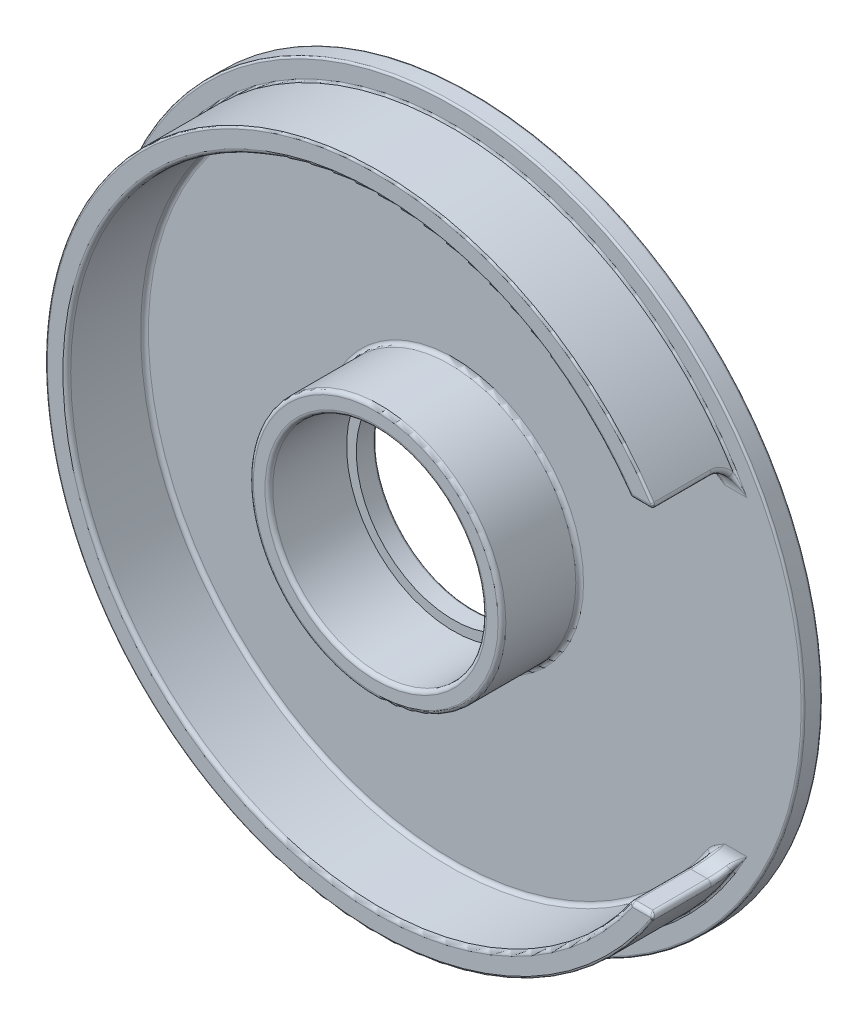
ISO-10303-21;
HEADER;
FILE_DESCRIPTION(('STEP AP214'),'2;1');
FILE_NAME('part.step','',(''),(''),'','','');
FILE_SCHEMA(('AUTOMOTIVE_DESIGN { 1 0 10303 214 1 1 1 1 }'));
ENDSEC;
DATA;
#1=APPLICATION_CONTEXT('core data for automotive mechanical design processes');
#2=APPLICATION_PROTOCOL_DEFINITION('international standard','automotive_design',2000,#1);
#3=PRODUCT_CONTEXT('',#1,'mechanical');
#4=PRODUCT('Part','Part','',(#3));
#5=PRODUCT_RELATED_PRODUCT_CATEGORY('part','',(#4));
#6=PRODUCT_DEFINITION_FORMATION('','',#4);
#7=PRODUCT_DEFINITION_CONTEXT('part definition',#1,'design');
#8=PRODUCT_DEFINITION('design','',#6,#7);
#9=PRODUCT_DEFINITION_SHAPE('','',#8);
#10=(LENGTH_UNIT() NAMED_UNIT(*) SI_UNIT(.MILLI.,.METRE.));
#11=(NAMED_UNIT(*) PLANE_ANGLE_UNIT() SI_UNIT($,.RADIAN.));
#12=(NAMED_UNIT(*) SI_UNIT($,.STERADIAN.) SOLID_ANGLE_UNIT());
#13=UNCERTAINTY_MEASURE_WITH_UNIT(LENGTH_MEASURE(1.E-05),#10,'distance_accuracy_value','');
#14=(GEOMETRIC_REPRESENTATION_CONTEXT(3) GLOBAL_UNCERTAINTY_ASSIGNED_CONTEXT((#13)) GLOBAL_UNIT_ASSIGNED_CONTEXT((#10,
#11,#12)) REPRESENTATION_CONTEXT('',''));
#15=CARTESIAN_POINT('',(0.,0.,0.));
#16=DIRECTION('',(0.,0.,1.));
#17=DIRECTION('',(1.,0.,0.));
#18=AXIS2_PLACEMENT_3D('',#15,#16,#17);
#19=CARTESIAN_POINT('',(0.,0.,5.));
#20=DIRECTION('',(0.,0.,1.));
#21=DIRECTION('',(1.,0.,0.));
#22=AXIS2_PLACEMENT_3D('',#19,#20,#21);
#23=PLANE('',#22);
#24=CARTESIAN_POINT('',(0.,0.,5.));
#25=DIRECTION('',(0.,0.,1.));
#26=DIRECTION('',(1.,0.,0.));
#27=AXIS2_PLACEMENT_3D('',#24,#25,#26);
#28=CIRCLE('',#27,6.3);
#29=CARTESIAN_POINT('',(6.3,0.,5.));
#30=VERTEX_POINT('',#29);
#31=EDGE_CURVE('E345',#30,#30,#28,.T.);
#32=ORIENTED_EDGE('',*,*,#31,.T.);
#33=EDGE_LOOP('',(#32));
#34=FACE_BOUND('',#33,.T.);
#35=CARTESIAN_POINT('',(0.,0.,5.));
#36=DIRECTION('',(0.,0.,1.));
#37=DIRECTION('',(1.,0.,0.));
#38=AXIS2_PLACEMENT_3D('',#35,#36,#37);
#39=CIRCLE('',#38,5.7);
#40=CARTESIAN_POINT('',(5.7,0.,5.));
#41=VERTEX_POINT('',#40);
#42=EDGE_CURVE('E343',#41,#41,#39,.F.);
#43=ORIENTED_EDGE('',*,*,#42,.T.);
#44=EDGE_LOOP('',(#43));
#45=FACE_BOUND('',#44,.T.);
#46=ADVANCED_FACE('F30',(#34,#45),#23,.T.);
#47=CARTESIAN_POINT('',(0.,0.,64.));
#48=DIRECTION('',(0.,0.,-1.));
#49=DIRECTION('',(-1.,0.,0.));
#50=AXIS2_PLACEMENT_3D('',#47,#48,#49);
#51=CYLINDRICAL_SURFACE('',#50,5.);
#52=CARTESIAN_POINT('',(0.,0.,0.100000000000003));
#53=DIRECTION('',(0.,0.,1.));
#54=DIRECTION('',(1.,0.,0.));
#55=AXIS2_PLACEMENT_3D('',#52,#53,#54);
#56=CIRCLE('',#55,5.);
#57=CARTESIAN_POINT('',(5.,0.,0.100000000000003));
#58=VERTEX_POINT('',#57);
#59=EDGE_CURVE('E570',#58,#58,#56,.F.);
#60=ORIENTED_EDGE('',*,*,#59,.T.);
#61=EDGE_LOOP('',(#60));
#62=FACE_BOUND('',#61,.T.);
#63=CARTESIAN_POINT('',(0.,0.,1.));
#64=DIRECTION('',(0.,0.,1.));
#65=DIRECTION('',(1.,0.,0.));
#66=AXIS2_PLACEMENT_3D('',#63,#64,#65);
#67=CIRCLE('',#66,5.);
#68=CARTESIAN_POINT('',(5.,0.,1.));
#69=VERTEX_POINT('',#68);
#70=EDGE_CURVE('E396',#69,#69,#67,.F.);
#71=ORIENTED_EDGE('',*,*,#70,.F.);
#72=EDGE_LOOP('',(#71));
#73=FACE_BOUND('',#72,.T.);
#74=ADVANCED_FACE('F368',(#62,#73),#51,.F.);
#75=CARTESIAN_POINT('',(0.,0.,5.));
#76=DIRECTION('',(0.,0.,-1.));
#77=DIRECTION('',(-1.,0.,0.));
#78=AXIS2_PLACEMENT_3D('',#75,#76,#77);
#79=CYLINDRICAL_SURFACE('',#78,18.);
#80=CARTESIAN_POINT('',(0.,0.,0.9));
#81=DIRECTION('',(0.,0.,1.));
#82=DIRECTION('',(1.,0.,0.));
#83=AXIS2_PLACEMENT_3D('',#80,#81,#82);
#84=CIRCLE('',#83,18.);
#85=CARTESIAN_POINT('',(18.,0.,0.9));
#86=VERTEX_POINT('',#85);
#87=EDGE_CURVE('E582',#86,#86,#84,.F.);
#88=ORIENTED_EDGE('',*,*,#87,.T.);
#89=EDGE_LOOP('',(#88));
#90=FACE_BOUND('',#89,.T.);
#91=CARTESIAN_POINT('',(0.,0.,0.1));
#92=DIRECTION('',(0.,0.,1.));
#93=DIRECTION('',(1.,0.,0.));
#94=AXIS2_PLACEMENT_3D('',#91,#92,#93);
#95=CIRCLE('',#94,18.);
#96=CARTESIAN_POINT('',(18.,0.,0.1));
#97=VERTEX_POINT('',#96);
#98=EDGE_CURVE('E579',#97,#97,#95,.T.);
#99=ORIENTED_EDGE('',*,*,#98,.T.);
#100=EDGE_LOOP('',(#99));
#101=FACE_BOUND('',#100,.T.);
#102=ADVANCED_FACE('F373',(#90,#101),#79,.T.);
#103=CARTESIAN_POINT('',(0.,0.,0.));
#104=DIRECTION('',(0.,0.,1.));
#105=DIRECTION('',(1.,0.,0.));
#106=AXIS2_PLACEMENT_3D('',#103,#104,#105);
#107=PLANE('',#106);
#108=CARTESIAN_POINT('',(0.,0.,0.));
#109=DIRECTION('',(0.,0.,1.));
#110=DIRECTION('',(1.,0.,0.));
#111=AXIS2_PLACEMENT_3D('',#108,#109,#110);
#112=CIRCLE('',#111,17.9);
#113=CARTESIAN_POINT('',(17.9,0.,0.));
#114=VERTEX_POINT('',#113);
#115=EDGE_CURVE('E588',#114,#114,#112,.F.);
#116=ORIENTED_EDGE('',*,*,#115,.T.);
#117=EDGE_LOOP('',(#116));
#118=FACE_BOUND('',#117,.T.);
#119=CARTESIAN_POINT('',(0.,0.,0.));
#120=DIRECTION('',(0.,0.,1.));
#121=DIRECTION('',(1.,0.,0.));
#122=AXIS2_PLACEMENT_3D('',#119,#120,#121);
#123=CIRCLE('',#122,5.1);
#124=CARTESIAN_POINT('',(5.1,0.,0.));
#125=VERTEX_POINT('',#124);
#126=EDGE_CURVE('E585',#125,#125,#123,.T.);
#127=ORIENTED_EDGE('',*,*,#126,.T.);
#128=EDGE_LOOP('',(#127));
#129=FACE_BOUND('',#128,.T.);
#130=ADVANCED_FACE('F299',(#118,#129),#107,.F.);
#131=CARTESIAN_POINT('',(0.,0.,1.));
#132=DIRECTION('',(0.,0.,1.));
#133=DIRECTION('',(1.,0.,0.));
#134=AXIS2_PLACEMENT_3D('',#131,#132,#133);
#135=PLANE('',#134);
#136=CARTESIAN_POINT('',(0.,0.,1.));
#137=DIRECTION('',(0.,0.,1.));
#138=DIRECTION('',(1.,0.,0.));
#139=AXIS2_PLACEMENT_3D('',#136,#137,#138);
#140=CIRCLE('',#139,6.7);
#141=CARTESIAN_POINT('',(6.7,0.,1.));
#142=VERTEX_POINT('',#141);
#143=EDGE_CURVE('E331',#142,#142,#140,.F.);
#144=ORIENTED_EDGE('',*,*,#143,.T.);
#145=EDGE_LOOP('',(#144));
#146=FACE_BOUND('',#145,.T.);
#147=CARTESIAN_POINT('',(0.,0.,1.));
#148=DIRECTION('',(0.,0.,1.));
#149=DIRECTION('',(1.,0.,0.));
#150=AXIS2_PLACEMENT_3D('',#147,#148,#149);
#151=CIRCLE('',#150,17.9);
#152=CARTESIAN_POINT('',(17.9,0.,1.));
#153=VERTEX_POINT('',#152);
#154=EDGE_CURVE('E576',#153,#153,#151,.T.);
#155=ORIENTED_EDGE('',*,*,#154,.T.);
#156=EDGE_LOOP('',(#155));
#157=FACE_BOUND('',#156,.T.);
#158=CARTESIAN_POINT('',(0.,0.,1.));
#159=DIRECTION('',(0.,0.,1.));
#160=DIRECTION('',(1.,0.,0.));
#161=AXIS2_PLACEMENT_3D('',#158,#159,#160);
#162=CIRCLE('',#161,17.1);
#163=CARTESIAN_POINT('',(15.1132392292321,-7.99999999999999,0.999999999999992));
#164=VERTEX_POINT('',#163);
#165=CARTESIAN_POINT('',(15.1132392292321,7.99999999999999,0.999999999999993));
#166=VERTEX_POINT('',#165);
#167=EDGE_CURVE('E573',#164,#166,#162,.F.);
#168=ORIENTED_EDGE('',*,*,#167,.T.);
#169=DIRECTION('',(1.,0.,0.));
#170=VECTOR('',#169,1.);
#171=CARTESIAN_POINT('',(12.,7.99999999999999,0.999999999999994));
#172=LINE('',#171,#170);
#173=CARTESIAN_POINT('',(13.971757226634,7.99999999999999,0.999999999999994));
#174=VERTEX_POINT('',#173);
#175=EDGE_CURVE('E559',#174,#166,#172,.T.);
#176=ORIENTED_EDGE('',*,*,#175,.F.);
#177=CARTESIAN_POINT('',(14.2461358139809,7.5837563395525,1.09074689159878));
#178=CARTESIAN_POINT('',(14.0265923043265,7.48819466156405,1.13449372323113));
#179=CARTESIAN_POINT('',(14.0691651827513,7.40733359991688,0.908896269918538));
#180=CARTESIAN_POINT('',(14.2135018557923,7.63543786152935,1.06708271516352));
#181=CARTESIAN_POINT('',(14.000989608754,7.53599582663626,1.10609672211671));
#182=CARTESIAN_POINT('',(14.0369366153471,7.46858101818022,0.880499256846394));
#183=CARTESIAN_POINT('',(14.1794280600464,7.68852412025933,1.04811114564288));
#184=CARTESIAN_POINT('',(13.9733530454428,7.5870385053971,1.08132521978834));
#185=CARTESIAN_POINT('',(14.0032860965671,7.53149318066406,0.857733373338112));
#186=CARTESIAN_POINT('',(14.1092236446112,7.79610372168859,1.01943146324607));
#187=CARTESIAN_POINT('',(13.9153736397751,7.69267567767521,1.04103672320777));
#188=CARTESIAN_POINT('',(13.9339537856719,7.65898503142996,0.823317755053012));
#189=CARTESIAN_POINT('',(14.0730971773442,7.85059410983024,1.00970530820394));
#190=CARTESIAN_POINT('',(13.8851432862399,7.74710547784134,1.02527280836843));
#191=CARTESIAN_POINT('',(13.898276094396,7.72356121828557,0.811646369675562));
#192=CARTESIAN_POINT('',(13.9954268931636,7.96579879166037,0.998731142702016));
#193=CARTESIAN_POINT('',(13.8192418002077,7.86405130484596,1.00226324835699));
#194=CARTESIAN_POINT('',(13.8215706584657,7.86008949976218,0.798477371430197));
#195=CARTESIAN_POINT('',(13.9537243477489,8.02653826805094,0.998533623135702));
#196=CARTESIAN_POINT('',(13.7833143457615,7.92689480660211,0.995774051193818));
#197=CARTESIAN_POINT('',(13.7803861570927,7.9320714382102,0.798240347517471));
#198=CARTESIAN_POINT('',(13.8696369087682,8.14682859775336,1.00899456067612));
#199=CARTESIAN_POINT('',(13.7099432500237,8.05314272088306,0.995103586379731));
#200=CARTESIAN_POINT('',(13.6973432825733,8.07462668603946,0.810793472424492));
#201=CARTESIAN_POINT('',(13.8272511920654,8.20637778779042,1.01966725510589));
#202=CARTESIAN_POINT('',(13.6725253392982,8.11655878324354,1.00058608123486));
#203=CARTESIAN_POINT('',(13.6554840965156,8.14519802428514,0.823600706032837));
#204=CARTESIAN_POINT('',(13.7399926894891,8.32689286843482,1.05273310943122));
#205=CARTESIAN_POINT('',(13.5948449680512,8.24610997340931,1.02478247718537));
#206=CARTESIAN_POINT('',(13.5693095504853,8.28801962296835,0.863279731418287));
#207=CARTESIAN_POINT('',(13.6951531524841,8.38766683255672,1.07589337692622));
#208=CARTESIAN_POINT('',(13.5544506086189,8.31238258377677,1.04404038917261));
#209=CARTESIAN_POINT('',(13.5250270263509,8.36004243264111,0.891072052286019));
#210=CARTESIAN_POINT('',(13.6074991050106,8.50449483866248,1.13412127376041));
#211=CARTESIAN_POINT('',(13.4749633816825,8.44069818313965,1.09680272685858));
#212=CARTESIAN_POINT('',(13.4384618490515,8.49849450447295,0.96094552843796));
#213=CARTESIAN_POINT('',(13.5646865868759,8.56054427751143,1.16920035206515));
#214=CARTESIAN_POINT('',(13.435758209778,8.5029757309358,1.13000357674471));
#215=CARTESIAN_POINT('',(13.3961811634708,8.5649183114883,1.00304042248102));
#216=CARTESIAN_POINT('',(13.4903095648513,8.65649832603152,1.24368094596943));
#217=CARTESIAN_POINT('',(13.3672688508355,8.6102220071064,1.20333649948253));
#218=CARTESIAN_POINT('',(13.3227280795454,8.67863279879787,1.09241713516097));
#219=CARTESIAN_POINT('',(13.4580959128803,8.69750414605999,1.28121635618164));
#220=CARTESIAN_POINT('',(13.3374591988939,8.65632500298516,1.24094889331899));
#221=CARTESIAN_POINT('',(13.2909145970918,8.72722851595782,1.13745962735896));
#222=CARTESIAN_POINT('',(13.3977101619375,8.77357440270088,1.36381946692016));
#223=CARTESIAN_POINT('',(13.2814962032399,8.74199864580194,1.32516942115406));
#224=CARTESIAN_POINT('',(13.2312789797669,8.81737885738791,1.23658336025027));
#225=CARTESIAN_POINT('',(13.3695335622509,8.80864546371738,1.4088786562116));
#226=CARTESIAN_POINT('',(13.2552124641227,8.78178503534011,1.37172380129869));
#227=CARTESIAN_POINT('',(13.2034524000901,8.85894133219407,1.2906543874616));
#228=CARTESIAN_POINT('',(13.3227242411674,8.86643134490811,1.49832773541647));
#229=CARTESIAN_POINT('',(13.2115115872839,8.8474044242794,1.46518339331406));
#230=CARTESIAN_POINT('',(13.1572245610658,8.92742298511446,1.39799328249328));
#231=CARTESIAN_POINT('',(13.3032886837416,8.89021968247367,1.5417307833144));
#232=CARTESIAN_POINT('',(13.1932954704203,8.87453449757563,1.51085780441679));
#233=CARTESIAN_POINT('',(13.138030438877,8.95561438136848,1.45007693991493));
#234=CARTESIAN_POINT('',(13.2694556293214,8.93141636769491,1.63265300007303));
#235=CARTESIAN_POINT('',(13.1616154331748,8.92147858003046,1.60702344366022));
#236=CARTESIAN_POINT('',(13.1046176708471,9.00443629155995,1.5591836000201));
#237=CARTESIAN_POINT('',(13.2550465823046,8.94883934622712,1.68016241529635));
#238=CARTESIAN_POINT('',(13.1480596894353,8.94143161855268,1.65758539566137));
#239=CARTESIAN_POINT('',(13.0903876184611,9.02508414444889,1.61619489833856));
#240=CARTESIAN_POINT('',(13.2334546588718,8.97486819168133,1.77267946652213));
#241=CARTESIAN_POINT('',(13.1277802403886,8.97119242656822,1.75630067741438));
#242=CARTESIAN_POINT('',(13.0690639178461,9.05593075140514,1.7272153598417));
#243=CARTESIAN_POINT('',(13.2256411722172,8.98424551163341,1.81736719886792));
#244=CARTESIAN_POINT('',(13.120417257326,8.98195150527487,1.80415823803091));
#245=CARTESIAN_POINT('',(13.0613474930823,9.06704374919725,1.7808406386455));
#246=CARTESIAN_POINT('',(13.2151593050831,8.99681321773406,1.9080307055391));
#247=CARTESIAN_POINT('',(13.1105617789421,8.99633925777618,1.90127939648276));
#248=CARTESIAN_POINT('',(13.0509958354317,9.08193765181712,1.88963684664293));
#249=CARTESIAN_POINT('',(13.21249183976,9.00000250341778,1.95400670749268));
#250=CARTESIAN_POINT('',(13.1080450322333,9.00000338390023,1.95066314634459));
#251=CARTESIAN_POINT('',(13.0483615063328,9.08571725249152,1.94480804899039));
#252=CARTESIAN_POINT('',(13.2124964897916,8.99999732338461,2.04917531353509));
#253=CARTESIAN_POINT('',(13.1080501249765,8.99999638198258,2.05275025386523));
#254=CARTESIAN_POINT('',(13.0483660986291,9.08571111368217,2.05901037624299));
#255=CARTESIAN_POINT('',(13.2155507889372,8.99634593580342,2.09837039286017));
#256=CARTESIAN_POINT('',(13.1109328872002,8.99579981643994,2.10560014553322));
#257=CARTESIAN_POINT('',(13.0513824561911,9.08138387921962,2.11804447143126));
#258=CARTESIAN_POINT('',(13.22452828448,8.98557855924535,2.17099980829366));
#259=CARTESIAN_POINT('',(13.1193660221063,8.98348474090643,2.18333065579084));
#260=CARTESIAN_POINT('',(13.0602484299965,9.06862353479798,2.20519976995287));
#261=CARTESIAN_POINT('',(13.2282643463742,8.98109463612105,2.1950587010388));
#262=CARTESIAN_POINT('',(13.1228809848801,8.97834843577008,2.20908510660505));
#263=CARTESIAN_POINT('',(13.0639380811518,9.06330966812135,2.23407044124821));
#264=CARTESIAN_POINT('',(13.2371337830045,8.97042977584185,2.24260837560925));
#265=CARTESIAN_POINT('',(13.1312141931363,8.9661493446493,2.25990925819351));
#266=CARTESIAN_POINT('',(13.0726973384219,9.05067081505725,2.29113005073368));
#267=CARTESIAN_POINT('',(13.2422667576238,8.96424932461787,2.26609931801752));
#268=CARTESIAN_POINT('',(13.1360378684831,8.95907857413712,2.28499550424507));
#269=CARTESIAN_POINT('',(13.0777665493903,9.04334640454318,2.31931918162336));
#270=CARTESIAN_POINT('',(13.2480617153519,8.95725679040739,2.28923941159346));
#271=CARTESIAN_POINT('',(13.1414703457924,8.9510987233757,2.30961993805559));
#272=CARTESIAN_POINT('',(13.0834895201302,9.03505960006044,2.34708729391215));
#273=(BOUNDED_SURFACE() B_SPLINE_SURFACE(3,2,((#177,#178,#179),(#180,#181,#182),(#183,#184,
#185),(#186,#187,#188),(#189,#190,#191),(#192,#193,#194),(#195,#196,#197),(#198,#199,#200),
(#201,#202,#203),(#204,#205,#206),(#207,#208,#209),(#210,#211,#212),(#213,#214,#215),(#216,#217,
#218),(#219,#220,#221),(#222,#223,#224),(#225,#226,#227),(#228,#229,#230),(#231,#232,#233),
(#234,#235,#236),(#237,#238,#239),(#240,#241,#242),(#243,#244,#245),(#246,#247,#248),(#249,#250,
#251),(#252,#253,#254),(#255,#256,#257),(#258,#259,#260),(#261,#262,#263),(#264,#265,#266),
(#267,#268,#269),(#270,#271,#272)),.UNSPECIFIED.,.F.,.F.,.F.) B_SPLINE_SURFACE_WITH_KNOTS((4,2,
2,2,2,2,2,2,2,2,2,2,2,2,2,4),(3,3),(0.,0.22644092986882,0.452439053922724,0.703301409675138,
0.954492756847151,1.22324223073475,1.4922505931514,1.71361167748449,1.93472402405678,
2.12143061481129,2.30770531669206,2.47302268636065,2.63836945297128,2.8151556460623,
2.90387404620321,2.99256706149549),(0.,1.),
.UNSPECIFIED.) GEOMETRIC_REPRESENTATION_ITEM() RATIONAL_B_SPLINE_SURFACE(((1.,0.634856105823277,
1.),(1.,0.643704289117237,1.),(1.,0.652846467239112,1.),(1.,0.671469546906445,1.),(1.,
0.680949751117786,1.),(1.,0.701085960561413,1.),(1.,0.711756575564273,1.),(1.,0.732980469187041,
1.),(1.,0.743533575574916,1.),(1.,0.764968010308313,1.),(1.,0.775820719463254,1.),(1.,
0.796748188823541,1.),(1.,0.806822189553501,1.),(1.,0.824110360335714,1.),(1.,0.831515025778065,
1.),(1.,0.845273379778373,1.),(1.,0.851628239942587,1.),(1.,0.862111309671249,1.),(1.,
0.866432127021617,1.),(1.,0.873920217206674,1.),(1.,0.877090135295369,1.),(1.,0.881827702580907,
1.),(1.,0.88353549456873,1.),(1.,0.885824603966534,1.),(1.,0.886405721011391,1.),(1.,
0.886404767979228,1.),(1.,0.885739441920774,1.),(1.,0.883778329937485,1.),(1.,0.882961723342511,
1.),(1.,0.881019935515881,1.),(1.,0.879894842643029,1.),(1.,0.878622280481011,1.))) REPRESENTATION_ITEM('') SURFACE());
#274=CARTESIAN_POINT('',(13.1834711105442,8.91314154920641,1.24780596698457));
#275=CARTESIAN_POINT('',(13.2416513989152,8.93147562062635,1.));
#276=CARTESIAN_POINT('',(12.9982472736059,8.85477286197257,1.));
#277=CARTESIAN_POINT('',(13.1921345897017,8.89164844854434,1.2405135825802));
#278=CARTESIAN_POINT('',(13.2381144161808,8.91027957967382,1.));
#279=CARTESIAN_POINT('',(13.0084767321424,8.82236536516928,1.));
#280=CARTESIAN_POINT('',(13.2024875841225,8.87008541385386,1.23278577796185));
#281=CARTESIAN_POINT('',(13.2373035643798,8.88645759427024,1.));
#282=CARTESIAN_POINT('',(13.0213441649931,8.79094530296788,1.));
#283=CARTESIAN_POINT('',(13.2259799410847,8.82702001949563,1.21676887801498));
#284=CARTESIAN_POINT('',(13.2413997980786,8.83662711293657,1.));
#285=CARTESIAN_POINT('',(13.0511968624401,8.73048806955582,1.));
#286=CARTESIAN_POINT('',(13.2390908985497,8.80551914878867,1.20848605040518));
#287=CARTESIAN_POINT('',(13.2460030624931,8.81076951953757,1.));
#288=CARTESIAN_POINT('',(13.0681403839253,8.70143050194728,1.));
#289=CARTESIAN_POINT('',(13.2784707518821,8.74609770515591,1.1851239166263));
#290=CARTESIAN_POINT('',(13.2656241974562,8.73954267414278,1.));
#291=CARTESIAN_POINT('',(13.1191985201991,8.6243835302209,1.));
#292=CARTESIAN_POINT('',(13.3072111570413,8.70801006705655,1.16962535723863));
#293=CARTESIAN_POINT('',(13.2855672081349,8.69221972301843,1.));
#294=CARTESIAN_POINT('',(13.156632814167,8.57862335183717,1.));
#295=CARTESIAN_POINT('',(13.3702019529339,8.6307175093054,1.13868961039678));
#296=CARTESIAN_POINT('',(13.3374395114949,8.59956319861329,1.));
#297=CARTESIAN_POINT('',(13.2377662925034,8.49271508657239,1.));
#298=CARTESIAN_POINT('',(13.4044895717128,8.59150662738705,1.1232536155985));
#299=CARTESIAN_POINT('',(13.3689190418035,8.55379088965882,1.));
#300=CARTESIAN_POINT('',(13.2815075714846,8.45260860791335,1.));
#301=CARTESIAN_POINT('',(13.4895894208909,8.49782513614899,1.08878568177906));
#302=CARTESIAN_POINT('',(13.4510601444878,8.45132740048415,1.));
#303=CARTESIAN_POINT('',(13.388602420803,8.36369534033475,1.));
#304=CARTESIAN_POINT('',(13.5419884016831,8.44281145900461,1.07038281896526));
#305=CARTESIAN_POINT('',(13.5054422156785,8.39404078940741,1.));
#306=CARTESIAN_POINT('',(13.4534669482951,8.31674774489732,1.));
#307=CARTESIAN_POINT('',(13.6506924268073,8.33032767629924,1.03912448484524));
#308=CARTESIAN_POINT('',(13.6202906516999,8.28542014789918,0.999999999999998));
#309=CARTESIAN_POINT('',(13.5862605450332,8.22787603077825,1.));
#310=CARTESIAN_POINT('',(13.7069916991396,8.27286124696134,1.02626101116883));
#311=CARTESIAN_POINT('',(13.6815236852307,8.23283605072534,0.999999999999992));
#312=CARTESIAN_POINT('',(13.6541850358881,8.18594472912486,1.));
#313=CARTESIAN_POINT('',(13.8311408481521,8.14574576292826,1.00615242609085));
#314=CARTESIAN_POINT('',(13.8161951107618,8.12228936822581,1.00000000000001));
#315=CARTESIAN_POINT('',(13.8032742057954,8.09706321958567,1.));
#316=CARTESIAN_POINT('',(13.8992883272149,8.07572425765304,1.00028396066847));
#317=CARTESIAN_POINT('',(13.8919583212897,8.06314243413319,1.00000000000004));
#318=CARTESIAN_POINT('',(13.8846762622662,8.05051836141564,1.));
#319=CARTESIAN_POINT('',(13.9684416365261,8.00346679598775,1.00000316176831));
#320=CARTESIAN_POINT('',(13.9681075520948,8.00288953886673,0.999999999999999));
#321=CARTESIAN_POINT('',(13.9677735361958,8.00231227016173,1.));
#322=CARTESIAN_POINT('',(13.9700990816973,8.0017342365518,0.999999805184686));
#323=CARTESIAN_POINT('',(13.9699322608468,8.00144526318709,0.999999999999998));
#324=CARTESIAN_POINT('',(13.9697654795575,8.00115630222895,1.));
#325=CARTESIAN_POINT('',(13.9717561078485,8.00000138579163,0.999999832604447));
#326=CARTESIAN_POINT('',(13.9717566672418,8.00000069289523,0.999999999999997));
#327=CARTESIAN_POINT('',(13.971757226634,8.,1.));
#328=(BOUNDED_SURFACE() B_SPLINE_SURFACE(3,2,((#274,#275,#276),(#277,#278,#279),(#280,#281,
#282),(#283,#284,#285),(#286,#287,#288),(#289,#290,#291),(#292,#293,#294),(#295,#296,#297),
(#298,#299,#300),(#301,#302,#303),(#304,#305,#306),(#307,#308,#309),(#310,#311,#312),(#313,#314,
#315),(#316,#317,#318),(#319,#320,#321),(#322,#323,#324),(#325,#326,#327)),.UNSPECIFIED.,.F.,
.F.,.F.) B_SPLINE_SURFACE_WITH_KNOTS((4,2,2,2,2,2,2,2,4),(3,3),(0.,0.101617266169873,
0.202235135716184,0.3786547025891,0.556311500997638,0.796067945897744,1.03547685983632,
1.31677023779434,1.32367942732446),(0.,1.),
.UNSPECIFIED.) GEOMETRIC_REPRESENTATION_ITEM() RATIONAL_B_SPLINE_SURFACE(((1.,0.616834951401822,
1.),(1.,0.631632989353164,1.),(1.,0.64673976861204,1.),(1.,0.676977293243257,1.),(1.,
0.692106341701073,1.),(1.,0.733402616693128,1.),(1.,0.759299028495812,1.),(1.,0.808637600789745,
1.),(1.,0.832061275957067,1.),(1.,0.882542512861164,1.),(1.,0.908008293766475,1.),(1.,
0.950072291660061,1.),(1.,0.966683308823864,1.),(1.,0.99238319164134,1.),(1.,0.999647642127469,
1.),(1.,0.999995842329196,1.),(1.,1.00000001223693,1.),(1.,0.999999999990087,1.))) REPRESENTATION_ITEM('') SURFACE());
#329=CARTESIAN_POINT('',(12.9982472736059,8.85477286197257,1.));
#330=CARTESIAN_POINT('',(13.0084767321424,8.82236536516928,1.));
#331=CARTESIAN_POINT('',(13.0213441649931,8.79094530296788,1.));
#332=CARTESIAN_POINT('',(13.0511968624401,8.73048806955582,1.));
#333=CARTESIAN_POINT('',(13.0681403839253,8.70143050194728,1.));
#334=CARTESIAN_POINT('',(13.1191985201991,8.6243835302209,1.));
#335=CARTESIAN_POINT('',(13.156632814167,8.57862335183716,1.));
#336=CARTESIAN_POINT('',(13.2377662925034,8.49271508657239,1.));
#337=CARTESIAN_POINT('',(13.2815075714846,8.45260860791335,1.));
#338=CARTESIAN_POINT('',(13.388602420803,8.36369534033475,1.));
#339=CARTESIAN_POINT('',(13.4534669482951,8.31674774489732,1.));
#340=CARTESIAN_POINT('',(13.5862605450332,8.22787603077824,1.));
#341=CARTESIAN_POINT('',(13.6541850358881,8.18594472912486,1.));
#342=CARTESIAN_POINT('',(13.8032742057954,8.09706321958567,1.));
#343=CARTESIAN_POINT('',(13.8846762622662,8.05051836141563,1.));
#344=CARTESIAN_POINT('',(13.9677735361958,8.00231227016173,1.));
#345=CARTESIAN_POINT('',(13.9697654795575,8.00115630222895,1.));
#346=CARTESIAN_POINT('',(13.971757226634,8.,1.));
#347=B_SPLINE_CURVE_WITH_KNOTS('',3,(#329,#330,#331,#332,#333,#334,#335,#336,#337,#338,#339,
#340,#341,#342,#343,#344,#345,#346),.UNSPECIFIED.,.F.,.F.,(4,2,2,2,2,2,2,2,4),(0.,
0.101617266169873,0.202235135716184,0.3786547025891,0.556311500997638,0.796067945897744,
1.03547685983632,1.31677023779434,1.32367942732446),.UNSPECIFIED.);
#348=CARTESIAN_POINT('',(13.0866843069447,8.67344763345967,1.));
#349=VERTEX_POINT('',#348);
#350=EDGE_CURVE('E43',#174,#349,#347,.F.);
#351=ORIENTED_EDGE('',*,*,#350,.T.);
#352=CARTESIAN_POINT('',(0.,0.,1.));
#353=DIRECTION('',(0.,0.,1.));
#354=DIRECTION('',(1.,0.,0.));
#355=AXIS2_PLACEMENT_3D('',#352,#353,#354);
#356=CIRCLE('',#355,15.7);
#357=CARTESIAN_POINT('',(13.0866843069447,-8.67344763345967,1.));
#358=VERTEX_POINT('',#357);
#359=EDGE_CURVE('E49',#349,#358,#356,.T.);
#360=ORIENTED_EDGE('',*,*,#359,.T.);
#361=CARTESIAN_POINT('',(13.2436071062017,-8.96262951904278,2.27082172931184));
#362=CARTESIAN_POINT('',(13.1372883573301,-8.95723892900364,2.28998245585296));
#363=CARTESIAN_POINT('',(13.0790902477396,-9.04142678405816,2.32498607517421));
#364=CARTESIAN_POINT('',(13.2333946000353,-8.97492943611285,2.22731789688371));
#365=CARTESIAN_POINT('',(13.1277033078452,-8.97129309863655,2.24371578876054));
#366=CARTESIAN_POINT('',(13.0690046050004,-9.05600333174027,2.27278147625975));
#367=CARTESIAN_POINT('',(13.2256137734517,-8.98427546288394,2.18256763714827));
#368=CARTESIAN_POINT('',(13.1203860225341,-8.98199397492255,2.19577722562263));
#369=CARTESIAN_POINT('',(13.0613204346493,-9.06707924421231,2.21908116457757));
#370=CARTESIAN_POINT('',(13.2151688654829,-8.99680464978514,2.09188032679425));
#371=CARTESIAN_POINT('',(13.110576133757,-8.99632141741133,2.09861969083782));
#372=CARTESIAN_POINT('',(13.0510052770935,-9.0819274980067,2.11025639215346));
#373=CARTESIAN_POINT('',(13.2124970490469,-8.99999712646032,2.04594517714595));
#374=CARTESIAN_POINT('',(13.1080515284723,-8.99999483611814,2.04928403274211));
#375=CARTESIAN_POINT('',(13.0483666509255,-9.08571088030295,2.05513421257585));
#376=CARTESIAN_POINT('',(13.2124909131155,-9.00000307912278,1.95076774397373));
#377=CARTESIAN_POINT('',(13.1080431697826,-9.00000553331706,1.94719008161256));
#378=CARTESIAN_POINT('',(13.0483605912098,-9.08571793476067,1.94092129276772));
#379=CARTESIAN_POINT('',(13.2155521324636,-8.99634383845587,1.90152397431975));
#380=CARTESIAN_POINT('',(13.1109332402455,-8.99579877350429,1.89428560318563));
#381=CARTESIAN_POINT('',(13.0513837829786,-9.08138139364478,1.88182876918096));
#382=CARTESIAN_POINT('',(13.2275529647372,-8.98195132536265,1.80462530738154));
#383=CARTESIAN_POINT('',(13.1222166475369,-8.97932244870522,1.79050629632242));
#384=CARTESIAN_POINT('',(13.0632355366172,-9.06432492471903,1.76555036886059));
#385=CARTESIAN_POINT('',(13.2364918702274,-8.97121890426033,1.75697021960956));
#386=CARTESIAN_POINT('',(13.1306421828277,-8.96700579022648,1.7394855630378));
#387=CARTESIAN_POINT('',(13.0720633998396,-9.0516060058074,1.70836426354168));
#388=CARTESIAN_POINT('',(13.2595776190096,-8.94335977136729,1.66476639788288));
#389=CARTESIAN_POINT('',(13.1523103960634,-8.93517419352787,1.64122065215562));
#390=CARTESIAN_POINT('',(13.0948623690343,-9.01859033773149,1.5977196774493));
#391=CARTESIAN_POINT('',(13.2736999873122,-8.92626310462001,1.6202042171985));
#392=CARTESIAN_POINT('',(13.1655875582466,-8.91560846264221,1.59384825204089));
#393=CARTESIAN_POINT('',(13.1088093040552,-8.99832919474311,1.54424506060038));
#394=CARTESIAN_POINT('',(13.3063497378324,-8.8864737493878,1.5348193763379));
#395=CARTESIAN_POINT('',(13.1961538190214,-8.87027878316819,1.50360370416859));
#396=CARTESIAN_POINT('',(13.1410534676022,-8.95117510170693,1.44178325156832));
#397=CARTESIAN_POINT('',(13.324884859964,-8.86377122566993,1.49400346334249));
#398=CARTESIAN_POINT('',(13.2135190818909,-8.84439935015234,1.46067327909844));
#399=CARTESIAN_POINT('',(13.1593583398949,-8.92427049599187,1.39280415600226));
#400=CARTESIAN_POINT('',(13.3886911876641,-8.78497970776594,1.37270380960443));
#401=CARTESIAN_POINT('',(13.2733791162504,-8.75448607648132,1.33336117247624));
#402=CARTESIAN_POINT('',(13.2223720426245,-8.83089520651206,1.24724457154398));
#403=CARTESIAN_POINT('',(13.4403677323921,-8.7203172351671,1.29999339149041));
#404=CARTESIAN_POINT('',(13.3217354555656,-8.68088396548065,1.25894684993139));
#405=CARTESIAN_POINT('',(13.2734066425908,-8.75426415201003,1.15999206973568));
#406=CARTESIAN_POINT('',(13.5621703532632,-8.56424178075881,1.16697418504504));
#407=CARTESIAN_POINT('',(13.4342513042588,-8.5058235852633,1.12625313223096));
#408=CARTESIAN_POINT('',(13.3936961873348,-8.56930019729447,1.00036902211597));
#409=CARTESIAN_POINT('',(13.6339411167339,-8.47013955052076,1.11095900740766));
#410=CARTESIAN_POINT('',(13.5001548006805,-8.40087913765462,1.07413817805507));
#411=CARTESIAN_POINT('',(13.4645753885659,-8.4577802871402,0.933150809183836));
#412=CARTESIAN_POINT('',(13.7496048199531,-8.31371304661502,1.0484892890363));
#413=CARTESIAN_POINT('',(13.6033770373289,-8.23200627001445,1.02132806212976));
#414=CARTESIAN_POINT('',(13.5788022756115,-8.27240030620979,0.858187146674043));
#415=CARTESIAN_POINT('',(13.792393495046,-8.254863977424,1.0310898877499));
#416=CARTESIAN_POINT('',(13.6416101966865,-8.16843484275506,1.00830531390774));
#417=CARTESIAN_POINT('',(13.6210594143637,-8.20265867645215,0.837307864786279));
#418=CARTESIAN_POINT('',(13.8780268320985,-8.1349542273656,1.00726749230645));
#419=CARTESIAN_POINT('',(13.7173213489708,-8.04059189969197,0.994288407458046));
#420=CARTESIAN_POINT('',(13.705628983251,-8.06055445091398,0.808720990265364));
#421=CARTESIAN_POINT('',(13.9208714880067,-8.07389376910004,1.00084339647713));
#422=CARTESIAN_POINT('',(13.7548097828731,-7.97624463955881,0.993642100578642));
#423=CARTESIAN_POINT('',(13.7479414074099,-7.98819211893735,0.801012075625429));
#424=CARTESIAN_POINT('',(14.0080060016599,-7.94738664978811,0.999266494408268));
#425=CARTESIAN_POINT('',(13.8301349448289,-7.84497153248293,1.00453133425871));
#426=CARTESIAN_POINT('',(13.8339935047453,-7.83826939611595,0.799119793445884));
#427=CARTESIAN_POINT('',(14.0522281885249,-7.88189674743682,1.00481355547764));
#428=CARTESIAN_POINT('',(13.8677172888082,-7.77829530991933,1.01722198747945));
#429=CARTESIAN_POINT('',(13.8776663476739,-7.76065776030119,0.805776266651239));
#430=CARTESIAN_POINT('',(14.1382465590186,-7.75206678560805,1.02896739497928));
#431=CARTESIAN_POINT('',(13.9397929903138,-7.64854484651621,1.05535126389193));
#432=CARTESIAN_POINT('',(13.9626161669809,-7.60679715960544,0.83476087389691));
#433=CARTESIAN_POINT('',(14.1800373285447,-7.68772949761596,1.04760219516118));
#434=CARTESIAN_POINT('',(13.974127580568,-7.58568415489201,1.08123647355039));
#435=CARTESIAN_POINT('',(14.0038877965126,-7.53055147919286,0.85712263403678));
#436=CARTESIAN_POINT('',(14.2199150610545,-7.62508364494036,1.07294135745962));
#437=CARTESIAN_POINT('',(14.0055877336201,-7.52728165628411,1.11249394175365));
#438=CARTESIAN_POINT('',(14.0432701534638,-7.45631030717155,0.887529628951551));
#439=(BOUNDED_SURFACE() B_SPLINE_SURFACE(3,2,((#361,#362,#363),(#364,#365,#366),(#367,#368,
#369),(#370,#371,#372),(#373,#374,#375),(#376,#377,#378),(#379,#380,#381),(#382,#383,#384),
(#385,#386,#387),(#388,#389,#390),(#391,#392,#393),(#394,#395,#396),(#397,#398,#399),(#400,#401,
#402),(#403,#404,#405),(#406,#407,#408),(#409,#410,#411),(#412,#413,#414),(#415,#416,#417),
(#418,#419,#420),(#421,#422,#423),(#424,#425,#426),(#427,#428,#429),(#430,#431,#432),(#433,#434,
#435),(#436,#437,#438)),.UNSPECIFIED.,.F.,.F.,.F.) B_SPLINE_SURFACE_WITH_KNOTS((4,2,2,2,2,2,2,2,
2,2,2,2,4),(3,3),(0.,0.16545742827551,0.330664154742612,0.507690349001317,0.684695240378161,
0.860874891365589,1.03736586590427,1.41489210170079,1.85744831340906,2.11206859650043,
2.36666331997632,2.63654351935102,2.90700331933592),(0.,1.),
.UNSPECIFIED.) GEOMETRIC_REPRESENTATION_ITEM() RATIONAL_B_SPLINE_SURFACE(((1.,0.879600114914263,
1.),(1.,0.881839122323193,1.),(1.,0.883541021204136,1.),(1.,0.885822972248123,1.),(1.,
0.886404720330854,1.),(1.,0.886405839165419,1.),(1.,0.88573907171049,1.),(1.,0.883117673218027,
1.),(1.,0.881163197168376,1.),(1.,0.876093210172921,1.),(1.,0.872983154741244,1.),(1.,
0.865751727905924,1.),(1.,0.861628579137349,1.),(1.,0.847335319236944,1.),(1.,0.835626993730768,
1.),(1.,0.80747484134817,1.),(1.,0.790562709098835,1.),(1.,0.762621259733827,1.),(1.,
0.752143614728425,1.),(1.,0.730880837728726,1.),(1.,0.720095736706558,1.),(1.,0.697857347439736,
1.),(1.,0.686402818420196,1.),(1.,0.663823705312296,1.),(1.,0.652699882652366,1.),(1.,
0.641943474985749,1.))) REPRESENTATION_ITEM('') SURFACE());
#440=CARTESIAN_POINT('',(12.998247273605,-8.85477286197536,1.));
#441=CARTESIAN_POINT('',(13.2416613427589,-8.93148085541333,1.));
#442=CARTESIAN_POINT('',(13.1834707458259,-8.91314303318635,1.24781465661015));
#443=CARTESIAN_POINT('',(13.0084778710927,-8.82236575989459,1.));
#444=CARTESIAN_POINT('',(13.2381241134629,-8.91028482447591,1.));
#445=CARTESIAN_POINT('',(13.1921348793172,-8.89164990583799,1.24052234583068));
#446=CARTESIAN_POINT('',(13.021345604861,-8.79094593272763,1.));
#447=CARTESIAN_POINT('',(13.2373150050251,-8.88645994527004,1.));
#448=CARTESIAN_POINT('',(13.2024891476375,-8.87008395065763,1.23279439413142));
#449=CARTESIAN_POINT('',(13.0511980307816,-8.73048873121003,1.));
#450=CARTESIAN_POINT('',(13.2414140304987,-8.83662540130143,1.));
#451=CARTESIAN_POINT('',(13.2259832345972,-8.82701322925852,1.2167780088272));
#452=CARTESIAN_POINT('',(13.0681409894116,-8.70143096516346,1.));
#453=CARTESIAN_POINT('',(13.2460183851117,-8.81076647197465,1.));
#454=CARTESIAN_POINT('',(13.2390946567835,-8.80550994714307,1.20849583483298));
#455=CARTESIAN_POINT('',(13.1191975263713,-8.62438261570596,1.));
#456=CARTESIAN_POINT('',(13.2656367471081,-8.73954530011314,1.));
#457=CARTESIAN_POINT('',(13.278472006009,-8.74609084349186,1.18513824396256));
#458=CARTESIAN_POINT('',(13.1566307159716,-8.57862072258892,1.));
#459=CARTESIAN_POINT('',(13.2855724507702,-8.69223491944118,1.));
#460=CARTESIAN_POINT('',(13.3072065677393,-8.70801478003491,1.16964566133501));
#461=CARTESIAN_POINT('',(13.2377644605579,-8.49271404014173,1.));
#462=CARTESIAN_POINT('',(13.3374371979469,-8.5995739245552,1.));
#463=CARTESIAN_POINT('',(13.3701944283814,-8.63072793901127,1.13869891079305));
#464=CARTESIAN_POINT('',(13.2815071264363,-8.45261089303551,1.));
#465=CARTESIAN_POINT('',(13.3689138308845,-8.55378968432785,1.));
#466=CARTESIAN_POINT('',(13.404485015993,-8.59151107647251,1.12324577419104));
#467=CARTESIAN_POINT('',(13.3886030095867,-8.36369226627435,1.));
#468=CARTESIAN_POINT('',(13.4510530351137,-8.45131409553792,1.));
#469=CARTESIAN_POINT('',(13.4895906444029,-8.49781219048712,1.08876589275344));
#470=CARTESIAN_POINT('',(13.4534664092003,-8.31673136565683,1.));
#471=CARTESIAN_POINT('',(13.5054428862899,-8.39402410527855,1.));
#472=CARTESIAN_POINT('',(13.5419920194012,-8.44278592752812,1.07037812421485));
#473=CARTESIAN_POINT('',(13.5530887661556,-8.25007678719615,1.));
#474=CARTESIAN_POINT('',(13.5925637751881,-8.31164126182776,1.));
#475=CARTESIAN_POINT('',(13.6235346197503,-8.35842980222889,1.04693318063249));
#476=CARTESIAN_POINT('',(13.5866619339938,-8.22850228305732,1.));
#477=CARTESIAN_POINT('',(13.6221600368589,-8.28501317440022,1.));
#478=CARTESIAN_POINT('',(13.6511869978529,-8.33002700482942,1.03981087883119));
#479=CARTESIAN_POINT('',(13.6543481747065,-8.18622109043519,1.));
#480=CARTESIAN_POINT('',(13.6823752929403,-8.23271242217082,1.));
#481=CARTESIAN_POINT('',(13.7071892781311,-8.27262803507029,1.0271622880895));
#482=CARTESIAN_POINT('',(13.6884611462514,-8.16551424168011,1.));
#483=CARTESIAN_POINT('',(13.7131186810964,-8.20690007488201,1.));
#484=CARTESIAN_POINT('',(13.7355390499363,-8.24363197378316,1.02163570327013));
#485=CARTESIAN_POINT('',(13.7630050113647,-8.12106592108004,1.));
#486=CARTESIAN_POINT('',(13.7805150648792,-8.15157182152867,1.));
#487=CARTESIAN_POINT('',(13.7976169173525,-8.18006498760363,1.01157496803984));
#488=CARTESIAN_POINT('',(13.8034965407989,-8.09742775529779,1.));
#489=CARTESIAN_POINT('',(13.8175600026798,-8.12193248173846,1.));
#490=CARTESIAN_POINT('',(13.8314177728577,-8.14540670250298,1.00738389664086));
#491=CARTESIAN_POINT('',(13.8643328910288,-8.06214066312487,1.));
#492=CARTESIAN_POINT('',(13.8732987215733,-8.07772953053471,1.));
#493=CARTESIAN_POINT('',(13.8822045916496,-8.09304575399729,1.00309602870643));
#494=CARTESIAN_POINT('',(13.8846284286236,-8.0504065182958,1.));
#495=CARTESIAN_POINT('',(13.8919038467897,-8.06303948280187,1.));
#496=CARTESIAN_POINT('',(13.8991479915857,-8.07552963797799,1.00199986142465));
#497=CARTESIAN_POINT('',(13.915079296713,-8.03282589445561,1.));
#498=CARTESIAN_POINT('',(13.9198161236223,-8.04103554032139,1.));
#499=CARTESIAN_POINT('',(13.9245427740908,-8.04920538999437,1.00086797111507));
#500=CARTESIAN_POINT('',(13.9252292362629,-8.0269700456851,1.));
#501=CARTESIAN_POINT('',(13.9291188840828,-8.03370771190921,1.));
#502=CARTESIAN_POINT('',(13.9330029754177,-8.04042369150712,1.00057607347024));
#503=CARTESIAN_POINT('',(13.9404343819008,-8.01815311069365,1.));
#504=CARTESIAN_POINT('',(13.943058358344,-8.02268690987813,1.));
#505=CARTESIAN_POINT('',(13.9456802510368,-8.02721409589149,1.00026691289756));
#506=CARTESIAN_POINT('',(13.9454992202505,-8.01520875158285,1.));
#507=CARTESIAN_POINT('',(13.9477020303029,-8.01900876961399,1.));
#508=CARTESIAN_POINT('',(13.9499036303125,-8.022804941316,1.00018530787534));
#509=CARTESIAN_POINT('',(13.955654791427,-8.00936401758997,1.));
#510=CARTESIAN_POINT('',(13.9570027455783,-8.01169320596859,1.));
#511=CARTESIAN_POINT('',(13.9583510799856,-8.01402129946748,1.00006548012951));
#512=CARTESIAN_POINT('',(13.9607455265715,-8.00646364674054,1.));
#513=CARTESIAN_POINT('',(13.9616602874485,-8.00805538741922,1.));
#514=CARTESIAN_POINT('',(13.9625751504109,-8.00964681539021,1.00002726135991));
#515=CARTESIAN_POINT('',(13.9667712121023,-8.00287912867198,1.));
#516=CARTESIAN_POINT('',(13.9671934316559,-8.00359813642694,1.));
#517=CARTESIAN_POINT('',(13.9676156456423,-8.00431711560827,1.00000678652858));
#518=CARTESIAN_POINT('',(13.9677588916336,-8.0022866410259,1.));
#519=CARTESIAN_POINT('',(13.9681010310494,-8.00286260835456,1.));
#520=CARTESIAN_POINT('',(13.9684431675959,-8.00343856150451,1.00000423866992));
#521=CARTESIAN_POINT('',(13.9692334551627,-8.00138854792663,1.));
#522=CARTESIAN_POINT('',(13.9694579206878,-8.00175093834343,1.));
#523=CARTESIAN_POINT('',(13.9696823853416,-8.00211332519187,1.00000174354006));
#524=CARTESIAN_POINT('',(13.9697236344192,-8.0010877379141,1.));
#525=CARTESIAN_POINT('',(13.9699092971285,-8.00137912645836,1.));
#526=CARTESIAN_POINT('',(13.9700949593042,-8.00167051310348,1.00000113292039));
#527=CARTESIAN_POINT('',(13.9704358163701,-8.00060113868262,1.));
#528=CARTESIAN_POINT('',(13.9705722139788,-8.00078930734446,1.));
#529=CARTESIAN_POINT('',(13.970708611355,-8.00097747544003,1.00000052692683));
#530=CARTESIAN_POINT('',(13.9706686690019,-8.00043362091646,1.));
#531=CARTESIAN_POINT('',(13.9707901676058,-8.00058803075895,1.));
#532=CARTESIAN_POINT('',(13.9709116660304,-8.00074244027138,1.00000037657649));
#533=CARTESIAN_POINT('',(13.9709793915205,-8.00014509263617,1.));
#534=CARTESIAN_POINT('',(13.9710903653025,-8.00025435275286,1.));
#535=CARTESIAN_POINT('',(13.9712013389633,-8.00036361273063,1.00000023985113));
#536=CARTESIAN_POINT('',(13.9710749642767,-8.00004508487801,1.));
#537=CARTESIAN_POINT('',(13.9711843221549,-8.00014044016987,1.));
#538=CARTESIAN_POINT('',(13.9712936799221,-8.00023579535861,1.00000020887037));
#539=CARTESIAN_POINT('',(13.9711983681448,-7.99988048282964,1.));
#540=CARTESIAN_POINT('',(13.9713107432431,-7.99995783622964,1.));
#541=CARTESIAN_POINT('',(13.9714231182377,-8.00003518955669,1.00000018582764));
#542=CARTESIAN_POINT('',(13.9712360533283,-7.99982346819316,1.));
#543=CARTESIAN_POINT('',(13.971350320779,-7.9998953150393,1.));
#544=CARTESIAN_POINT('',(13.9714645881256,-7.99996716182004,1.00000018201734));
#545=CARTESIAN_POINT('',(13.9712937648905,-7.99972204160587,1.));
#546=CARTESIAN_POINT('',(13.9714129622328,-7.99978543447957,1.));
#547=CARTESIAN_POINT('',(13.9715321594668,-7.99984882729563,1.00000018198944));
#548=CARTESIAN_POINT('',(13.9713157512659,-7.99967872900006,1.));
#549=CARTESIAN_POINT('',(13.9714374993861,-7.99973889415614,1.));
#550=CARTESIAN_POINT('',(13.9715592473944,-7.99979905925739,1.00000018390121));
#551=CARTESIAN_POINT('',(13.9713539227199,-7.99959545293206,1.));
#552=CARTESIAN_POINT('',(13.9714812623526,-7.99965000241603,1.));
#553=CARTESIAN_POINT('',(13.9716086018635,-7.99970455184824,1.00000019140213));
#554=CARTESIAN_POINT('',(13.9713704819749,-7.99955565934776,1.));
#555=CARTESIAN_POINT('',(13.9715007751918,-7.99960776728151,1.));
#556=CARTESIAN_POINT('',(13.9716310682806,-7.99965987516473,1.00000019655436));
#557=CARTESIAN_POINT('',(13.9714004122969,-7.99947581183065,1.));
#558=CARTESIAN_POINT('',(13.9715371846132,-7.99952349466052,1.));
#559=CARTESIAN_POINT('',(13.971673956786,-7.99957117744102,1.00000020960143));
#560=CARTESIAN_POINT('',(13.9714138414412,-7.99943577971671,1.));
#561=CARTESIAN_POINT('',(13.9715541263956,-7.99948147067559,1.));
#562=CARTESIAN_POINT('',(13.9716944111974,-7.99952716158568,1.00000021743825));
#563=CARTESIAN_POINT('',(13.9714391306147,-7.99935276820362,1.));
#564=CARTESIAN_POINT('',(13.9715871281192,-7.99939469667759,1.));
#565=CARTESIAN_POINT('',(13.9717351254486,-7.99943662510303,1.00000023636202));
#566=CARTESIAN_POINT('',(13.9714508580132,-7.99930975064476,1.));
#567=CARTESIAN_POINT('',(13.9716030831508,-7.99934992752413,1.));
#568=CARTESIAN_POINT('',(13.9717553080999,-7.99939010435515,1.00000024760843));
#569=CARTESIAN_POINT('',(13.9714731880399,-7.99921905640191,1.));
#570=CARTESIAN_POINT('',(13.9716347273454,-7.99925588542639,1.));
#571=CARTESIAN_POINT('',(13.9717962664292,-7.9992927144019,1.00000027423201));
#572=CARTESIAN_POINT('',(13.9714835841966,-7.99917131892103,1.));
#573=CARTESIAN_POINT('',(13.9716502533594,-7.99920658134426,1.));
#574=CARTESIAN_POINT('',(13.9718169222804,-7.99924184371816,1.00000028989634));
#575=CARTESIAN_POINT('',(13.9715036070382,-7.99906991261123,1.));
#576=CARTESIAN_POINT('',(13.9716815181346,-7.99910214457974,1.));
#577=CARTESIAN_POINT('',(13.9718594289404,-7.99913437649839,1.00000032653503));
#578=CARTESIAN_POINT('',(13.9715129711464,-7.99901625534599,1.));
#579=CARTESIAN_POINT('',(13.9716970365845,-7.99904706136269,1.));
#580=CARTESIAN_POINT('',(13.9718811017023,-7.99907786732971,1.00000034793));
#581=CARTESIAN_POINT('',(13.9715309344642,-7.99889875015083,1.));
#582=CARTESIAN_POINT('',(13.9717289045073,-7.99892679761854,1.));
#583=CARTESIAN_POINT('',(13.9719268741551,-7.99895484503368,1.0000003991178));
#584=CARTESIAN_POINT('',(13.9715392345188,-7.9988345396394,1.));
#585=CARTESIAN_POINT('',(13.9717450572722,-7.99886129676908,1.));
#586=CARTESIAN_POINT('',(13.9719508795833,-7.99888805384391,1.00000042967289));
#587=CARTESIAN_POINT('',(13.9715967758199,-7.99838164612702,1.));
#588=CARTESIAN_POINT('',(13.9718581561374,-7.99839943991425,1.));
#589=CARTESIAN_POINT('',(13.9721195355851,-7.99841723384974,1.00000066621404));
#590=CARTESIAN_POINT('',(13.9716146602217,-7.99819212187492,1.));
#591=CARTESIAN_POINT('',(13.9719003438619,-7.9982070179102,0.999999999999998));
#592=CARTESIAN_POINT('',(13.9721860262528,-7.99822191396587,1.00000089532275));
#593=CARTESIAN_POINT('',(13.971757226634,-8.,1.));
#594=CARTESIAN_POINT('',(13.9717587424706,-7.99999707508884,0.999999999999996));
#595=CARTESIAN_POINT('',(13.9717602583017,-7.99999415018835,1.00000036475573));
#596=(BOUNDED_SURFACE() B_SPLINE_SURFACE(3,2,((#440,#441,#442),(#443,#444,#445),(#446,#447,
#448),(#449,#450,#451),(#452,#453,#454),(#455,#456,#457),(#458,#459,#460),(#461,#462,#463),
(#464,#465,#466),(#467,#468,#469),(#470,#471,#472),(#473,#474,#475),(#476,#477,#478),(#479,#480,
#481),(#482,#483,#484),(#485,#486,#487),(#488,#489,#490),(#491,#492,#493),(#494,#495,#496),
(#497,#498,#499),(#500,#501,#502),(#503,#504,#505),(#506,#507,#508),(#509,#510,#511),(#512,#513,
#514),(#515,#516,#517),(#518,#519,#520),(#521,#522,#523),(#524,#525,#526),(#527,#528,#529),
(#530,#531,#532),(#533,#534,#535),(#536,#537,#538),(#539,#540,#541),(#542,#543,#544),(#545,#546,
#547),(#548,#549,#550),(#551,#552,#553),(#554,#555,#556),(#557,#558,#559),(#560,#561,#562),
(#563,#564,#565),(#566,#567,#568),(#569,#570,#571),(#572,#573,#574),(#575,#576,#577),(#578,#579,
#580),(#581,#582,#583),(#584,#585,#586),(#587,#588,#589),(#590,#591,#592),(#593,#594,#595)),
.UNSPECIFIED.,.F.,.F.,.F.) B_SPLINE_SURFACE_WITH_KNOTS((4,2,2,2,2,2,2,2,2,2,2,2,2,2,2,2,2,2,2,2,
2,2,2,2,2,4),(3,3),(0.,0.101617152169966,0.202234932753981,0.378654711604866,0.556311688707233,
0.796068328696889,0.91579397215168,1.03549740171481,1.17615512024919,1.24648567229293,
1.28163980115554,1.29921513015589,1.31679206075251,1.32024678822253,1.32197285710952,
1.32283053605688,1.32324296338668,1.32344737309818,1.32359291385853,1.32372211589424,
1.32384868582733,1.32398245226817,1.32412867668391,1.32429335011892,1.32448148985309,
1.3257244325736),(0.,1.),
.UNSPECIFIED.) GEOMETRIC_REPRESENTATION_ITEM() RATIONAL_B_SPLINE_SURFACE(((1.,0.616818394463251,
1.),(1.,0.631616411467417,1.),(1.,0.646723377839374,1.),(1.,0.676960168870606,1.),(1.,
0.692088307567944,1.),(1.,0.733378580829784,1.),(1.,0.759267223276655,1.),(1.,0.808622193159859,
1.),(1.,0.832070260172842,1.),(1.,0.882570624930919,1.),(1.,0.908017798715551,1.),(1.,
0.939562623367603,1.),(1.,0.948969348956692,1.),(1.,0.96548466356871,1.),(1.,0.972593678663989,
1.),(1.,0.98544660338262,1.),(1.,0.990733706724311,1.),(1.,0.996124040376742,1.),(1.,
0.997497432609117,1.),(1.,0.998914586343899,1.),(1.,0.999279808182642,1.),(1.,0.999666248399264,
1.),(1.,0.999768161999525,1.),(1.,0.999918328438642,1.),(1.,0.999966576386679,1.),(1.,
0.999991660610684,1.),(1.,0.999994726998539,1.),(1.,0.999997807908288,1.),(1.,0.999998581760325,
1.),(1.,0.999999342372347,1.),(1.,0.99999952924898,1.),(1.,0.99999969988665,1.),(1.,
0.999999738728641,1.),(1.,0.999999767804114,1.),(1.,0.999999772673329,1.),(1.,0.99999977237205,
1.),(1.,0.999999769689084,1.),(1.,0.999999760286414,1.),(1.,0.999999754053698,1.),(1.,
0.99999973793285,1.),(1.,0.999999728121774,1.),(1.,0.999999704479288,1.),(1.,0.999999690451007,
1.),(1.,0.999999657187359,1.),(1.,0.999999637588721,1.),(1.,0.999999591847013,1.),(1.,
0.999999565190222,1.),(1.,0.999999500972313,1.),(1.,0.99999946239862,1.),(1.,0.999999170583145,
1.),(1.,0.999998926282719,1.),(1.,0.999999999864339,1.))) REPRESENTATION_ITEM('') SURFACE());
#597=CARTESIAN_POINT('',(12.998247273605,-8.85477286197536,1.));
#598=CARTESIAN_POINT('',(13.0084778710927,-8.8223657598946,1.));
#599=CARTESIAN_POINT('',(13.021345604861,-8.79094593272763,1.));
#600=CARTESIAN_POINT('',(13.0511980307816,-8.73048873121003,1.));
#601=CARTESIAN_POINT('',(13.0681409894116,-8.70143096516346,1.));
#602=CARTESIAN_POINT('',(13.1191975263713,-8.62438261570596,1.));
#603=CARTESIAN_POINT('',(13.1566307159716,-8.57862072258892,1.));
#604=CARTESIAN_POINT('',(13.2377644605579,-8.49271404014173,1.));
#605=CARTESIAN_POINT('',(13.2815071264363,-8.45261089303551,1.));
#606=CARTESIAN_POINT('',(13.3886030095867,-8.36369226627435,1.));
#607=CARTESIAN_POINT('',(13.4534664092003,-8.31673136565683,1.));
#608=CARTESIAN_POINT('',(13.5530887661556,-8.25007678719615,1.));
#609=CARTESIAN_POINT('',(13.5866619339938,-8.22850228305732,1.));
#610=CARTESIAN_POINT('',(13.6543481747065,-8.18622109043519,1.));
#611=CARTESIAN_POINT('',(13.6884611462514,-8.16551424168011,1.));
#612=CARTESIAN_POINT('',(13.7630050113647,-8.12106592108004,1.));
#613=CARTESIAN_POINT('',(13.8034965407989,-8.09742775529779,1.));
#614=CARTESIAN_POINT('',(13.8643328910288,-8.06214066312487,1.));
#615=CARTESIAN_POINT('',(13.8846284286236,-8.0504065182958,1.));
#616=CARTESIAN_POINT('',(13.915079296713,-8.03282589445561,1.));
#617=CARTESIAN_POINT('',(13.9252292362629,-8.0269700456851,1.));
#618=CARTESIAN_POINT('',(13.9404343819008,-8.01815311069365,1.));
#619=CARTESIAN_POINT('',(13.9454992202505,-8.01520875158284,1.));
#620=CARTESIAN_POINT('',(13.955654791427,-8.00936401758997,1.));
#621=CARTESIAN_POINT('',(13.9607455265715,-8.00646364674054,1.));
#622=CARTESIAN_POINT('',(13.9667712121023,-8.00287912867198,1.));
#623=CARTESIAN_POINT('',(13.9677588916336,-8.0022866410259,1.));
#624=CARTESIAN_POINT('',(13.9692334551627,-8.00138854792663,1.));
#625=CARTESIAN_POINT('',(13.9697236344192,-8.0010877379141,1.));
#626=CARTESIAN_POINT('',(13.9704358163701,-8.00060113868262,1.));
#627=CARTESIAN_POINT('',(13.9706686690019,-8.00043362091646,1.));
#628=CARTESIAN_POINT('',(13.9709793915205,-8.00014509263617,1.));
#629=CARTESIAN_POINT('',(13.9710749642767,-8.00004508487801,1.));
#630=CARTESIAN_POINT('',(13.9711983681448,-7.99988048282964,1.));
#631=CARTESIAN_POINT('',(13.9712360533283,-7.99982346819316,1.));
#632=CARTESIAN_POINT('',(13.9712937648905,-7.99972204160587,1.));
#633=CARTESIAN_POINT('',(13.9713157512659,-7.99967872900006,1.));
#634=CARTESIAN_POINT('',(13.9713539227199,-7.99959545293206,1.));
#635=CARTESIAN_POINT('',(13.9713704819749,-7.99955565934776,1.));
#636=CARTESIAN_POINT('',(13.9714004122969,-7.99947581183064,1.));
#637=CARTESIAN_POINT('',(13.9714138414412,-7.99943577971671,1.));
#638=CARTESIAN_POINT('',(13.9714391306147,-7.99935276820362,1.));
#639=CARTESIAN_POINT('',(13.9714508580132,-7.99930975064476,1.));
#640=CARTESIAN_POINT('',(13.9714731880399,-7.99921905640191,1.));
#641=CARTESIAN_POINT('',(13.9714835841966,-7.99917131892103,1.));
#642=CARTESIAN_POINT('',(13.9715036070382,-7.99906991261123,1.));
#643=CARTESIAN_POINT('',(13.9715129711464,-7.99901625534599,1.));
#644=CARTESIAN_POINT('',(13.9715309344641,-7.99889875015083,1.));
#645=CARTESIAN_POINT('',(13.9715392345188,-7.9988345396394,1.));
#646=CARTESIAN_POINT('',(13.9715967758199,-7.99838164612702,1.));
#647=CARTESIAN_POINT('',(13.9716146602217,-7.99819212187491,1.));
#648=CARTESIAN_POINT('',(13.971757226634,-8.,1.));
#649=B_SPLINE_CURVE_WITH_KNOTS('',3,(#597,#598,#599,#600,#601,#602,#603,#604,#605,#606,#607,
#608,#609,#610,#611,#612,#613,#614,#615,#616,#617,#618,#619,#620,#621,#622,#623,#624,#625,#626,
#627,#628,#629,#630,#631,#632,#633,#634,#635,#636,#637,#638,#639,#640,#641,#642,#643,#644,#645,
#646,#647,#648),.UNSPECIFIED.,.F.,.F.,(4,2,2,2,2,2,2,2,2,2,2,2,2,2,2,2,2,2,2,2,2,2,2,2,2,4),(0.,
0.101617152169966,0.202234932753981,0.378654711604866,0.556311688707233,0.796068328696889,
0.91579397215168,1.03549740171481,1.17615512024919,1.24648567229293,1.28163980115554,
1.29921513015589,1.31679206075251,1.32024678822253,1.32197285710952,1.32283053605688,
1.32324296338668,1.32344737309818,1.32359291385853,1.32372211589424,1.32384868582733,
1.32398245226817,1.32412867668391,1.32429335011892,1.32448148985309,1.3257244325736),.UNSPECIFIED.);
#650=CARTESIAN_POINT('',(13.971757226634,-7.99999999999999,0.999999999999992));
#651=VERTEX_POINT('',#650);
#652=EDGE_CURVE('E11',#358,#651,#649,.T.);
#653=ORIENTED_EDGE('',*,*,#652,.T.);
#654=DIRECTION('',(1.,0.,0.));
#655=VECTOR('',#654,1.);
#656=CARTESIAN_POINT('',(12.,-7.99999999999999,0.999999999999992));
#657=LINE('',#656,#655);
#658=EDGE_CURVE('E554',#651,#164,#657,.T.);
#659=ORIENTED_EDGE('',*,*,#658,.T.);
#660=EDGE_LOOP('',(#168,#176,#351,#360,#653,#659));
#661=FACE_BOUND('',#660,.T.);
#662=ADVANCED_FACE('F295',(#146,#157,#661),#135,.T.);
#663=CARTESIAN_POINT('',(0.,0.,1.));
#664=DIRECTION('',(0.,0.,1.));
#665=DIRECTION('',(1.,0.,0.));
#666=AXIS2_PLACEMENT_3D('',#663,#664,#665);
#667=CYLINDRICAL_SURFACE('',#666,17.);
#668=CARTESIAN_POINT('',(0.,0.,1.1));
#669=DIRECTION('',(0.,0.,1.));
#670=DIRECTION('',(1.,0.,0.));
#671=AXIS2_PLACEMENT_3D('',#668,#669,#670);
#672=CIRCLE('',#671,17.);
#673=CARTESIAN_POINT('',(14.4851045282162,8.89841260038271,1.1));
#674=VERTEX_POINT('',#673);
#675=CARTESIAN_POINT('',(14.4851045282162,-8.89841260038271,1.1));
#676=VERTEX_POINT('',#675);
#677=EDGE_CURVE('E395',#674,#676,#672,.T.);
#678=ORIENTED_EDGE('',*,*,#677,.T.);
#679=CARTESIAN_POINT('',(14.5435054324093,-8.34158490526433,1.06014907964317));
#680=CARTESIAN_POINT('',(14.6253032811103,-8.38336617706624,1.07533430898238));
#681=CARTESIAN_POINT('',(14.6779663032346,-8.43459896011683,1.01815947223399));
#682=CARTESIAN_POINT('',(14.730629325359,-8.48583174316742,0.960984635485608));
#683=CARTESIAN_POINT('',(14.7166424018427,-8.5100197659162,0.872178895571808));
#684=CARTESIAN_POINT('',(14.5035365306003,-8.39922056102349,1.0810837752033));
#685=CARTESIAN_POINT('',(14.5870108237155,-8.44081602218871,1.09908405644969));
#686=CARTESIAN_POINT('',(14.6400675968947,-8.49592507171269,1.04267165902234));
#687=CARTESIAN_POINT('',(14.692799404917,-8.55154915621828,0.986472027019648));
#688=CARTESIAN_POINT('',(14.6761976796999,-8.58000591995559,0.897300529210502));
#689=CARTESIAN_POINT('',(14.4639784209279,-8.45524354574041,1.10746363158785));
#690=CARTESIAN_POINT('',(14.5494959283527,-8.4958160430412,1.12818180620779));
#691=CARTESIAN_POINT('',(14.602779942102,-8.55508143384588,1.07294416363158));
#692=CARTESIAN_POINT('',(14.6557806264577,-8.61478687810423,1.01798394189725));
#693=CARTESIAN_POINT('',(14.6361686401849,-8.64803382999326,0.92895635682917));
#694=CARTESIAN_POINT('',(14.3871557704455,-8.56247937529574,1.17083950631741));
#695=CARTESIAN_POINT('',(14.4770445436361,-8.60000901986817,1.1963134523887));
#696=CARTESIAN_POINT('',(14.530836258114,-8.6673954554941,1.14422001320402));
#697=CARTESIAN_POINT('',(14.584369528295,-8.73518764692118,1.09238593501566));
#698=CARTESIAN_POINT('',(14.5584314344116,-8.77824876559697,1.00500740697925));
#699=CARTESIAN_POINT('',(14.3499004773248,-8.61367321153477,1.20787532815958));
#700=CARTESIAN_POINT('',(14.4421352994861,-8.6491387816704,1.23546313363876));
#701=CARTESIAN_POINT('',(14.4961907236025,-8.72052956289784,1.18526353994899));
#702=CARTESIAN_POINT('',(14.5500050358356,-8.79228494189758,1.13540848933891));
#703=CARTESIAN_POINT('',(14.520732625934,-8.84041270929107,1.04945039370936));
#704=CARTESIAN_POINT('',(14.2856862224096,-8.70078656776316,1.28470252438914));
#705=CARTESIAN_POINT('',(14.382445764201,-8.7315834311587,1.31492363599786));
#706=CARTESIAN_POINT('',(14.4369721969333,-8.81000323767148,1.26900233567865));
#707=CARTESIAN_POINT('',(14.4913276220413,-8.88868117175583,1.22331986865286));
#708=CARTESIAN_POINT('',(14.4557539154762,-8.94619321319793,1.14164302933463));
#709=CARTESIAN_POINT('',(14.2580696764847,-8.73780805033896,1.32285862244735));
#710=CARTESIAN_POINT('',(14.3569569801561,-8.76616143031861,1.3538937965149));
#711=CARTESIAN_POINT('',(14.4117000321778,-8.84765238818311,1.31013239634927));
#712=CARTESIAN_POINT('',(14.4663035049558,-8.92934893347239,1.26663474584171));
#713=CARTESIAN_POINT('',(14.4278086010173,-8.99114787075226,1.18743034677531));
#714=CARTESIAN_POINT('',(14.2067518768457,-8.80599277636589,1.40565444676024));
#715=CARTESIAN_POINT('',(14.3099089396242,-8.82907826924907,1.43709509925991));
#716=CARTESIAN_POINT('',(14.3651084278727,-8.91631217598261,1.39820898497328));
#717=CARTESIAN_POINT('',(14.4201695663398,-9.00375006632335,1.35958451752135));
#718=CARTESIAN_POINT('',(14.3758798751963,-9.07394360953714,1.28678533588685));
#719=CARTESIAN_POINT('',(14.1830463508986,-8.83716241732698,1.45028699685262));
#720=CARTESIAN_POINT('',(14.2883805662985,-8.85737099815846,1.4813313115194));
#721=CARTESIAN_POINT('',(14.3437846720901,-8.94733006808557,1.44514906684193));
#722=CARTESIAN_POINT('',(14.3990903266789,-9.0374310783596,1.40922723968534));
#723=CARTESIAN_POINT('',(14.351892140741,-9.11179245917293,1.34034439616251));
#724=CARTESIAN_POINT('',(14.1406043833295,-8.89258479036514,1.54573355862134));
#725=CARTESIAN_POINT('',(14.2500918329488,-8.90707138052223,1.57448514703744));
#726=CARTESIAN_POINT('',(14.3059197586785,-9.0019212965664,1.54424195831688));
#727=CARTESIAN_POINT('',(14.3616455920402,-9.09691840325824,1.51426313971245));
#728=CARTESIAN_POINT('',(14.3089449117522,-9.17909105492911,1.45488027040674));
#729=CARTESIAN_POINT('',(14.1219093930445,-8.91677994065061,1.59659435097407));
#730=CARTESIAN_POINT('',(14.2334175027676,-8.92835798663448,1.62341282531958));
#731=CARTESIAN_POINT('',(14.2894184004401,-9.02543282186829,1.59643361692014));
#732=CARTESIAN_POINT('',(14.3453649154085,-9.12258476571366,1.56967401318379));
#733=CARTESIAN_POINT('',(14.2900273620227,-9.20847088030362,1.51591322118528));
#734=CARTESIAN_POINT('',(14.0910889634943,-8.95648990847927,1.70279156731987));
#735=CARTESIAN_POINT('',(14.2060652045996,-8.96296324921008,1.72425505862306));
#736=CARTESIAN_POINT('',(14.2624027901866,-9.06368980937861,1.70418461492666));
#737=CARTESIAN_POINT('',(14.318684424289,-9.16449550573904,1.68433462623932));
#738=CARTESIAN_POINT('',(14.2588400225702,-9.25669012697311,1.64334988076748));
#739=CARTESIAN_POINT('',(14.0789492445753,-8.97202359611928,1.7581179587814));
#740=CARTESIAN_POINT('',(14.1954195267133,-8.97624032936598,1.77609817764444));
#741=CARTESIAN_POINT('',(14.2518755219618,-9.07845433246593,1.75973633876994));
#742=CARTESIAN_POINT('',(14.3083161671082,-9.18068996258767,1.74350398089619));
#743=CARTESIAN_POINT('',(14.2465557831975,-9.27555246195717,1.70974155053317));
#744=CARTESIAN_POINT('',(14.0616385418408,-8.9941374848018,1.87551335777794));
#745=CARTESIAN_POINT('',(14.180250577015,-8.9950900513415,1.88528613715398));
#746=CARTESIAN_POINT('',(14.2369099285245,-9.09939367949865,1.87678032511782));
#747=CARTESIAN_POINT('',(14.2935487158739,-9.20372591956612,1.86842521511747));
#748=CARTESIAN_POINT('',(14.2290390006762,-9.30240504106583,1.85061602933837));
#749=CARTESIAN_POINT('',(14.0570273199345,-8.99999882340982,1.93778169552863));
#750=CARTESIAN_POINT('',(14.1762560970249,-8.99999819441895,1.94262643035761));
#751=CARTESIAN_POINT('',(14.2329602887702,-9.10487955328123,1.93841347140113));
#752=CARTESIAN_POINT('',(14.2896649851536,-9.20976014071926,1.93419398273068));
#753=CARTESIAN_POINT('',(14.224372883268,-9.30952238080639,1.92533803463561));
#754=CARTESIAN_POINT('',(14.0570262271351,-9.00000094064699,2.04974158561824));
#755=CARTESIAN_POINT('',(14.1762544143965,-9.00000144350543,2.04586836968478));
#756=CARTESIAN_POINT('',(14.2329590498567,-9.10488220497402,2.04923650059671));
#757=CARTESIAN_POINT('',(14.2896632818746,-9.20976358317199,2.05260984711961));
#758=CARTESIAN_POINT('',(14.2243717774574,-9.30952495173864,2.05968990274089));
#759=CARTESIAN_POINT('',(14.0599726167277,-8.99625635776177,2.09945119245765));
#760=CARTESIAN_POINT('',(14.1788067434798,-8.99686626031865,2.0916719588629));
#761=CARTESIAN_POINT('',(14.2354824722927,-9.1013780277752,2.09844320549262));
#762=CARTESIAN_POINT('',(14.292144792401,-9.20590865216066,2.10514480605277));
#763=CARTESIAN_POINT('',(14.2273532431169,-9.30497795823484,2.11934143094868));
#764=CARTESIAN_POINT('',(14.071481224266,-8.98156510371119,2.1975717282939));
#765=CARTESIAN_POINT('',(14.1888809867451,-8.98436820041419,2.1826177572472));
#766=CARTESIAN_POINT('',(14.2454169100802,-9.0874929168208,2.1959992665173));
#767=CARTESIAN_POINT('',(14.3019504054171,-9.19062091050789,2.20929471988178));
#768=CARTESIAN_POINT('',(14.2389988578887,-9.28713857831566,2.23708607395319));
#769=CARTESIAN_POINT('',(14.0800691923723,-8.9705854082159,2.24597563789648));
#770=CARTESIAN_POINT('',(14.1964100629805,-8.97499625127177,2.22768814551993));
#771=CARTESIAN_POINT('',(14.2528503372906,-9.07708044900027,2.24434364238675));
#772=CARTESIAN_POINT('',(14.3092814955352,-9.17917712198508,2.2608269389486));
#773=CARTESIAN_POINT('',(14.2476890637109,-9.2738060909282,2.29517076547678));
#774=CARTESIAN_POINT('',(14.0913233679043,-8.95615204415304,2.29287073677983));
#775=CARTESIAN_POINT('',(14.2063368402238,-8.9625559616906,2.27196349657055));
#776=CARTESIAN_POINT('',(14.2626457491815,-9.06329803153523,2.29162472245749));
#777=CARTESIAN_POINT('',(14.3189546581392,-9.16404010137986,2.31128594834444));
#778=CARTESIAN_POINT('',(14.2590772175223,-9.25627986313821,2.3514448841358));
#779=(BOUNDED_SURFACE() B_SPLINE_SURFACE(3,2,((#679,#680,#681,#682,#683),(#684,#685,#686,#687,
#688),(#689,#690,#691,#692,#693),(#694,#695,#696,#697,#698),(#699,#700,#701,#702,#703),(#704,
#705,#706,#707,#708),(#709,#710,#711,#712,#713),(#714,#715,#716,#717,#718),(#719,#720,#721,#722,
#723),(#724,#725,#726,#727,#728),(#729,#730,#731,#732,#733),(#734,#735,#736,#737,#738),(#739,
#740,#741,#742,#743),(#744,#745,#746,#747,#748),(#749,#750,#751,#752,#753),(#754,#755,#756,#757,
#758),(#759,#760,#761,#762,#763),(#764,#765,#766,#767,#768),(#769,#770,#771,#772,#773),(#774,
#775,#776,#777,#778)),.UNSPECIFIED.,.F.,.F.,.F.) B_SPLINE_SURFACE_WITH_KNOTS((4,2,2,2,2,2,2,2,2,
4),(3,2,3),(0.,0.251218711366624,0.503388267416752,0.711126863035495,0.91863700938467,
1.12781427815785,1.3365340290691,1.560163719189,1.73894865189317,1.91855534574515),(0.,0.5,1.),
.UNSPECIFIED.) GEOMETRIC_REPRESENTATION_ITEM() RATIONAL_B_SPLINE_SURFACE(((1.,0.906592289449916,
1.,0.906592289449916,1.),(1.,0.903362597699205,1.,0.903362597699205,1.),(1.,0.900021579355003,
1.,0.900021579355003,1.),(1.,0.893267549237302,1.,0.893267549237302,1.),(1.,0.889854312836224,
1.,0.889854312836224,1.),(1.,0.883725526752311,1.,0.883725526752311,1.),(1.,0.880993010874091,
1.,0.880993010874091,1.),(1.,0.875753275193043,1.,0.875753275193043,1.),(1.,0.873245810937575,
1.,0.873245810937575,1.),(1.,0.868633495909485,1.,0.868633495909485,1.),(1.,0.866532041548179,
1.,0.866532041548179,1.),(1.,0.863000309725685,1.,0.863000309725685,1.),(1.,0.861568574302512,
1.,0.861568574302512,1.),(1.,0.859511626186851,1.,0.859511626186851,1.),(1.,0.858951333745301,
1.,0.858951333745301,1.),(1.,0.858951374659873,1.,0.858951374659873,1.),(1.,0.859309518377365,
1.,0.859309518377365,1.),(1.,0.860681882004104,1.,0.860681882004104,1.),(1.,0.861699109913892,
1.,0.861699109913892,1.),(1.,0.863013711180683,1.,0.863013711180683,1.))) REPRESENTATION_ITEM('') SURFACE());
#780=CARTESIAN_POINT('',(14.7166424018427,-8.5100197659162,0.872178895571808));
#781=CARTESIAN_POINT('',(14.6761976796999,-8.58000591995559,0.897300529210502));
#782=CARTESIAN_POINT('',(14.6361686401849,-8.64803382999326,0.92895635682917));
#783=CARTESIAN_POINT('',(14.5584314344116,-8.77824876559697,1.00500740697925));
#784=CARTESIAN_POINT('',(14.520732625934,-8.84041270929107,1.04945039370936));
#785=CARTESIAN_POINT('',(14.4557539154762,-8.94619321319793,1.14164302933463));
#786=CARTESIAN_POINT('',(14.4278086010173,-8.99114787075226,1.18743034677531));
#787=CARTESIAN_POINT('',(14.3758798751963,-9.07394360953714,1.28678533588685));
#788=CARTESIAN_POINT('',(14.351892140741,-9.11179245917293,1.34034439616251));
#789=CARTESIAN_POINT('',(14.3089449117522,-9.17909105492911,1.45488027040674));
#790=CARTESIAN_POINT('',(14.2900273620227,-9.20847088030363,1.51591322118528));
#791=CARTESIAN_POINT('',(14.2588400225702,-9.25669012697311,1.64334988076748));
#792=CARTESIAN_POINT('',(14.2465557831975,-9.27555246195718,1.70974155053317));
#793=CARTESIAN_POINT('',(14.2290390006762,-9.30240504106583,1.85061602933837));
#794=CARTESIAN_POINT('',(14.224372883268,-9.30952238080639,1.92533803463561));
#795=CARTESIAN_POINT('',(14.2243717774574,-9.30952495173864,2.05968990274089));
#796=CARTESIAN_POINT('',(14.2273532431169,-9.30497795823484,2.11934143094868));
#797=CARTESIAN_POINT('',(14.2389988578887,-9.28713857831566,2.23708607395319));
#798=CARTESIAN_POINT('',(14.2476890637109,-9.2738060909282,2.29517076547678));
#799=CARTESIAN_POINT('',(14.2590772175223,-9.25627986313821,2.3514448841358));
#800=B_SPLINE_CURVE_WITH_KNOTS('',3,(#780,#781,#782,#783,#784,#785,#786,#787,#788,#789,#790,
#791,#792,#793,#794,#795,#796,#797,#798,#799),.UNSPECIFIED.,.F.,.F.,(4,2,2,2,2,2,2,2,2,4),(0.,
0.251218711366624,0.503388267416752,0.711126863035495,0.91863700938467,1.12781427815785,
1.3365340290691,1.560163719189,1.73894865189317,1.91855534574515),.UNSPECIFIED.);
#801=CARTESIAN_POINT('',(14.2243722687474,-9.30952380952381,2.));
#802=VERTEX_POINT('',#801);
#803=EDGE_CURVE('E664',#676,#802,#800,.T.);
#804=ORIENTED_EDGE('',*,*,#803,.T.);
#805=DIRECTION('',(0.,0.,1.));
#806=VECTOR('',#805,1.);
#807=CARTESIAN_POINT('',(14.2243722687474,-9.30952380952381,1.));
#808=LINE('',#807,#806);
#809=CARTESIAN_POINT('',(14.2243722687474,-9.30952380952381,4.9));
#810=VERTEX_POINT('',#809);
#811=EDGE_CURVE('E660',#802,#810,#808,.T.);
#812=ORIENTED_EDGE('',*,*,#811,.T.);
#813=CARTESIAN_POINT('',(0.,0.,4.9));
#814=DIRECTION('',(0.,0.,1.));
#815=DIRECTION('',(1.,0.,0.));
#816=AXIS2_PLACEMENT_3D('',#813,#814,#815);
#817=CIRCLE('',#816,17.);
#818=CARTESIAN_POINT('',(14.2243722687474,9.30952380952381,4.9));
#819=VERTEX_POINT('',#818);
#820=EDGE_CURVE('E567',#810,#819,#817,.F.);
#821=ORIENTED_EDGE('',*,*,#820,.T.);
#822=DIRECTION('',(0.,0.,1.));
#823=VECTOR('',#822,1.);
#824=CARTESIAN_POINT('',(14.2243722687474,9.30952380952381,1.));
#825=LINE('',#824,#823);
#826=CARTESIAN_POINT('',(14.2243722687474,9.30952380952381,2.));
#827=VERTEX_POINT('',#826);
#828=EDGE_CURVE('E661',#819,#827,#825,.F.);
#829=ORIENTED_EDGE('',*,*,#828,.T.);
#830=CARTESIAN_POINT('',(14.0913233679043,8.95615204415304,2.29287073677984));
#831=CARTESIAN_POINT('',(14.2063368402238,8.9625559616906,2.27196349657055));
#832=CARTESIAN_POINT('',(14.2626457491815,9.06329803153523,2.2916247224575));
#833=CARTESIAN_POINT('',(14.3189546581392,9.16404010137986,2.31128594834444));
#834=CARTESIAN_POINT('',(14.2590772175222,9.25627986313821,2.35144488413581));
#835=CARTESIAN_POINT('',(14.0857305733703,8.96333121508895,2.26943516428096));
#836=CARTESIAN_POINT('',(14.2013962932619,8.96875907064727,2.24987690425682));
#837=CARTESIAN_POINT('',(14.2577712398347,9.07016526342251,2.26801228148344));
#838=CARTESIAN_POINT('',(14.3141393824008,9.17158096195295,2.28610991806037));
#839=CARTESIAN_POINT('',(14.2534178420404,9.26499742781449,2.32332219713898));
#840=CARTESIAN_POINT('',(14.08077932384,8.96967342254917,2.24564643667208));
#841=CARTESIAN_POINT('',(14.1970412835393,8.97420246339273,2.2275906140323));
#842=CARTESIAN_POINT('',(14.253471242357,9.07620497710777,2.24414405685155));
#843=CARTESIAN_POINT('',(14.3098969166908,9.17821347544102,2.26066880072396));
#844=CARTESIAN_POINT('',(14.248407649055,9.27269867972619,2.29477572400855));
#845=CARTESIAN_POINT('',(14.0722268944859,8.98061376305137,2.19750127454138));
#846=CARTESIAN_POINT('',(14.189532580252,8.98356055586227,2.18265385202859));
#847=CARTESIAN_POINT('',(14.2460608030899,9.08659360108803,2.19599666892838));
#848=CARTESIAN_POINT('',(14.3025846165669,9.18963284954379,2.20931169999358));
#849=CARTESIAN_POINT('',(14.2397534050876,9.28598337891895,2.23700152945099));
#850=CARTESIAN_POINT('',(14.0686260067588,8.98521151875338,2.17314471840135));
#851=CARTESIAN_POINT('',(14.1863818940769,8.98747146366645,2.16001087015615));
#852=CARTESIAN_POINT('',(14.2429506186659,9.0909421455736,2.17171741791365));
#853=CARTESIAN_POINT('',(14.2995177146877,9.19441511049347,2.18340419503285));
#854=CARTESIAN_POINT('',(14.2361096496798,9.29156636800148,2.20777366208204));
#855=CARTESIAN_POINT('',(14.0599710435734,8.99625521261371,2.09960321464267));
#856=CARTESIAN_POINT('',(14.1788107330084,8.9968555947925,2.09179928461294));
#857=CARTESIAN_POINT('',(14.2354842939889,9.10137123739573,2.09858521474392));
#858=CARTESIAN_POINT('',(14.2921491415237,9.20589903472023,2.1052934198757));
#859=CARTESIAN_POINT('',(14.2273516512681,9.3049765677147,2.11952385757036));
#860=CARTESIAN_POINT('',(14.057028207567,8.99999817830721,2.04979532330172));
#861=CARTESIAN_POINT('',(14.1762563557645,8.99999866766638,2.0459124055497));
#862=CARTESIAN_POINT('',(14.2329608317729,9.10487941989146,2.04928606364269));
#863=CARTESIAN_POINT('',(14.289665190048,9.20976034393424,2.0526614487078));
#864=CARTESIAN_POINT('',(14.2243737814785,9.30952159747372,2.05975438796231));
#865=CARTESIAN_POINT('',(14.0570252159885,9.00000182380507,1.95014693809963));
#866=CARTESIAN_POINT('',(14.1762539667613,9.00000133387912,1.95403433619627));
#867=CARTESIAN_POINT('',(14.2329583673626,9.1048826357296,1.95065678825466));
#868=CARTESIAN_POINT('',(14.2896628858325,9.20976376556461,1.94727746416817));
#869=CARTESIAN_POINT('',(14.2243707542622,9.30952602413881,1.94017632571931));
#870=CARTESIAN_POINT('',(14.0599718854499,8.99625382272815,1.90030647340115));
#871=CARTESIAN_POINT('',(14.1788118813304,8.99685363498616,1.90811947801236));
#872=CARTESIAN_POINT('',(14.2354852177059,9.10136953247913,1.90132669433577));
#873=CARTESIAN_POINT('',(14.2921502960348,9.2058969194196,1.89461300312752));
#874=CARTESIAN_POINT('',(14.2273525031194,9.30497487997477,1.88036776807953));
#875=CARTESIAN_POINT('',(14.0715371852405,8.98149718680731,1.8022024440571));
#876=CARTESIAN_POINT('',(14.1889240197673,8.98432114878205,1.81715717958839));
#877=CARTESIAN_POINT('',(14.245461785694,9.08743492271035,1.80376522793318));
#878=CARTESIAN_POINT('',(14.301991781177,9.19055959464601,1.79045092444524));
#879=CARTESIAN_POINT('',(14.2390554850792,9.28705610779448,1.76264293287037));
#880=CARTESIAN_POINT('',(14.0801548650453,8.97048976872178,1.75393861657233));
#881=CARTESIAN_POINT('',(14.1964615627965,8.97495711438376,1.77217868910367));
#882=CARTESIAN_POINT('',(14.2529106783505,9.07701457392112,1.75553367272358));
#883=CARTESIAN_POINT('',(14.3093296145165,9.17911446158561,1.73903195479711));
#884=CARTESIAN_POINT('',(14.2477757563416,9.27368995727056,1.70472633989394));
#885=CARTESIAN_POINT('',(14.1024442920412,8.94187539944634,1.66051932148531));
#886=CARTESIAN_POINT('',(14.21614054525,8.9502446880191,1.68421424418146));
#887=CARTESIAN_POINT('',(14.2723393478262,9.04963992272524,1.66141778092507));
#888=CARTESIAN_POINT('',(14.328509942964,9.14907499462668,1.63876083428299));
#889=CARTESIAN_POINT('',(14.2703305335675,9.23894393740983,1.59262318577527));
#890=CARTESIAN_POINT('',(14.1160943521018,8.92429676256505,1.61535148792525));
#891=CARTESIAN_POINT('',(14.2282359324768,8.93495559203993,1.64127119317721));
#892=CARTESIAN_POINT('',(14.284299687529,9.03271364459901,1.61552432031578));
#893=CARTESIAN_POINT('',(14.3403074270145,9.130551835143,1.58995545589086));
#894=CARTESIAN_POINT('',(14.2841430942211,9.21759844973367,1.53842178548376));
#895=CARTESIAN_POINT('',(14.1476888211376,8.88334082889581,1.52881770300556));
#896=CARTESIAN_POINT('',(14.2564963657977,8.89877078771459,1.55801516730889));
#897=CARTESIAN_POINT('',(14.3122309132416,8.99283181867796,1.52674934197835));
#898=CARTESIAN_POINT('',(14.3679077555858,9.08697508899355,1.49566695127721));
#899=CARTESIAN_POINT('',(14.3161136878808,9.16786624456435,1.43458124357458));
#900=CARTESIAN_POINT('',(14.1656405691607,8.85995361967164,1.48745841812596));
#901=CARTESIAN_POINT('',(14.2726390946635,8.87790458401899,1.51773360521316));
#902=CARTESIAN_POINT('',(14.3282086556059,8.96986596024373,1.48387313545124));
#903=CARTESIAN_POINT('',(14.38368873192,9.06195651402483,1.45021859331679));
#904=CARTESIAN_POINT('',(14.3342791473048,9.13946749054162,1.38495010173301));
#905=CARTESIAN_POINT('',(14.2229768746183,8.78464703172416,1.37365009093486));
#906=CARTESIAN_POINT('',(14.3245684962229,8.80979822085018,1.40573308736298));
#907=CARTESIAN_POINT('',(14.3796956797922,8.8950796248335,1.36468932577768));
#908=CARTESIAN_POINT('',(14.4345229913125,8.98079811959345,1.3243420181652));
#909=CARTESIAN_POINT('',(14.3922980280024,9.04802377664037,1.24838010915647));
#910=CARTESIAN_POINT('',(14.2670230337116,8.72610088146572,1.30706613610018));
#911=CARTESIAN_POINT('',(14.3649533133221,8.75573734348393,1.33824257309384));
#912=CARTESIAN_POINT('',(14.419767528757,8.83599231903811,1.29337120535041));
#913=CARTESIAN_POINT('',(14.4741326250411,8.91692783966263,1.24912217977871));
#914=CARTESIAN_POINT('',(14.4368685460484,8.97693202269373,1.16847936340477));
#915=CARTESIAN_POINT('',(14.349895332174,8.61368333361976,1.20785592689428));
#916=CARTESIAN_POINT('',(14.4421221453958,8.64916213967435,1.23545688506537));
#917=CARTESIAN_POINT('',(14.4961811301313,8.72054817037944,1.18524729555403));
#918=CARTESIAN_POINT('',(14.5499914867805,8.79230834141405,1.13539913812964));
#919=CARTESIAN_POINT('',(14.5207274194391,8.8404250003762,1.0494271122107));
#920=CARTESIAN_POINT('',(14.3870747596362,8.56259267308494,1.17090288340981));
#921=CARTESIAN_POINT('',(14.4769642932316,8.60012499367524,1.19638828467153));
#922=CARTESIAN_POINT('',(14.5307583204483,8.66751747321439,1.14429338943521));
#923=CARTESIAN_POINT('',(14.5842901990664,8.73532033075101,1.09246671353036));
#924=CARTESIAN_POINT('',(14.5583494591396,8.77838634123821,1.00508345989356));
#925=CARTESIAN_POINT('',(14.4638472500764,8.45542649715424,1.10757539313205));
#926=CARTESIAN_POINT('',(14.5493763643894,8.49598751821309,1.12829488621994));
#927=CARTESIAN_POINT('',(14.6026591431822,8.55526975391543,1.07306770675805));
#928=CARTESIAN_POINT('',(14.6556630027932,8.61498630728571,1.01810836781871));
#929=CARTESIAN_POINT('',(14.6360359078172,8.64825598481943,0.929090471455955));
#930=CARTESIAN_POINT('',(14.5034378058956,8.39935613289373,1.081190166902));
#931=CARTESIAN_POINT('',(14.5869273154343,8.44093261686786,1.09918104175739));
#932=CARTESIAN_POINT('',(14.6399799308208,8.49605911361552,1.04278504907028));
#933=CARTESIAN_POINT('',(14.6927176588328,8.55168729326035,0.986580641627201));
#934=CARTESIAN_POINT('',(14.6760977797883,8.58017054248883,0.897428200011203));
#935=CARTESIAN_POINT('',(14.5435054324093,8.34158490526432,1.06014907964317));
#936=CARTESIAN_POINT('',(14.6253032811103,8.38336617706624,1.07533430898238));
#937=CARTESIAN_POINT('',(14.6779663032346,8.43459896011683,1.01815947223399));
#938=CARTESIAN_POINT('',(14.730629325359,8.48583174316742,0.960984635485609));
#939=CARTESIAN_POINT('',(14.7166424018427,8.5100197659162,0.87217889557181));
#940=(BOUNDED_SURFACE() B_SPLINE_SURFACE(3,2,((#830,#831,#832,#833,#834),(#835,#836,#837,#838,
#839),(#840,#841,#842,#843,#844),(#845,#846,#847,#848,#849),(#850,#851,#852,#853,#854),(#855,
#856,#857,#858,#859),(#860,#861,#862,#863,#864),(#865,#866,#867,#868,#869),(#870,#871,#872,#873,
#874),(#875,#876,#877,#878,#879),(#880,#881,#882,#883,#884),(#885,#886,#887,#888,#889),(#890,
#891,#892,#893,#894),(#895,#896,#897,#898,#899),(#900,#901,#902,#903,#904),(#905,#906,#907,#908,
#909),(#910,#911,#912,#913,#914),(#915,#916,#917,#918,#919),(#920,#921,#922,#923,#924),(#925,
#926,#927,#928,#929),(#930,#931,#932,#933,#934),(#935,#936,#937,#938,#939)),.UNSPECIFIED.,.F.,
.F.,.F.) B_SPLINE_SURFACE_WITH_KNOTS((4,2,2,2,2,2,2,2,2,2,4),(3,2,3),(0.,0.0897680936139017,
0.17955559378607,0.358558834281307,0.537769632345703,0.716950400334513,0.89536784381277,
1.07409187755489,1.41507843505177,1.6669013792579,1.91846679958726),(0.,0.5,1.),
.UNSPECIFIED.) GEOMETRIC_REPRESENTATION_ITEM() RATIONAL_B_SPLINE_SURFACE(((1.,0.863013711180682,
1.,0.863013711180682,1.),(1.,0.862362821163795,1.,0.862362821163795,1.),(1.,0.861781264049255,
1.,0.861781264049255,1.),(1.,0.860770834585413,1.,0.860770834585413,1.),(1.,0.860341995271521,
1.,0.860341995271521,1.),(1.,0.859308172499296,1.,0.859308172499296,1.),(1.,0.85895156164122,1.,
0.85895156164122,1.),(1.,0.858951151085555,1.,0.858951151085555,1.),(1.,0.859308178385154,1.,
0.859308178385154,1.),(1.,0.860689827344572,1.,0.860689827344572,1.),(1.,0.861714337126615,1.,
0.861714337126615,1.),(1.,0.864307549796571,1.,0.864307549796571,1.),(1.,0.865873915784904,1.,
0.865873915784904,1.),(1.,0.869406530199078,1.,0.869406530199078,1.),(1.,0.87137346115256,1.,
0.87137346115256,1.),(1.,0.877470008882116,1.,0.877470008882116,1.),(1.,0.881941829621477,1.,
0.881941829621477,1.),(1.,0.889855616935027,1.,0.889855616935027,1.),(1.,0.893261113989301,1.,
0.893261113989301,1.),(1.,0.900009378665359,1.,0.900009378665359,1.),(1.,0.903352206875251,1.,
0.903352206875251,1.),(1.,0.906592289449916,1.,0.906592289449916,1.))) REPRESENTATION_ITEM('') SURFACE());
#941=CARTESIAN_POINT('',(14.2590772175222,9.25627986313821,2.35144488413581));
#942=CARTESIAN_POINT('',(14.2534178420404,9.26499742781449,2.32332219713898));
#943=CARTESIAN_POINT('',(14.248407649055,9.27269867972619,2.29477572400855));
#944=CARTESIAN_POINT('',(14.2397534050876,9.28598337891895,2.23700152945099));
#945=CARTESIAN_POINT('',(14.2361096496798,9.29156636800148,2.20777366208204));
#946=CARTESIAN_POINT('',(14.2273516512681,9.3049765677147,2.11952385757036));
#947=CARTESIAN_POINT('',(14.2243737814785,9.30952159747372,2.05975438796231));
#948=CARTESIAN_POINT('',(14.2243707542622,9.30952602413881,1.94017632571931));
#949=CARTESIAN_POINT('',(14.2273525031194,9.30497487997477,1.88036776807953));
#950=CARTESIAN_POINT('',(14.2390554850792,9.28705610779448,1.76264293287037));
#951=CARTESIAN_POINT('',(14.2477757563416,9.27368995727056,1.70472633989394));
#952=CARTESIAN_POINT('',(14.2703305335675,9.23894393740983,1.59262318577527));
#953=CARTESIAN_POINT('',(14.2841430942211,9.21759844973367,1.53842178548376));
#954=CARTESIAN_POINT('',(14.3161136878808,9.16786624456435,1.43458124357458));
#955=CARTESIAN_POINT('',(14.3342791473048,9.13946749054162,1.38495010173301));
#956=CARTESIAN_POINT('',(14.3922980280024,9.04802377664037,1.24838010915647));
#957=CARTESIAN_POINT('',(14.4368685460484,8.97693202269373,1.16847936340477));
#958=CARTESIAN_POINT('',(14.5207274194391,8.8404250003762,1.0494271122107));
#959=CARTESIAN_POINT('',(14.5583494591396,8.77838634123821,1.00508345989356));
#960=CARTESIAN_POINT('',(14.6360359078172,8.64825598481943,0.929090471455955));
#961=CARTESIAN_POINT('',(14.6760977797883,8.58017054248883,0.897428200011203));
#962=CARTESIAN_POINT('',(14.7166424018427,8.5100197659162,0.87217889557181));
#963=B_SPLINE_CURVE_WITH_KNOTS('',3,(#941,#942,#943,#944,#945,#946,#947,#948,#949,#950,#951,
#952,#953,#954,#955,#956,#957,#958,#959,#960,#961,#962),.UNSPECIFIED.,.F.,.F.,(4,2,2,2,2,2,2,2,
2,2,4),(0.,0.0897680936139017,0.17955559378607,0.358558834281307,0.537769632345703,
0.716950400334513,0.89536784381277,1.07409187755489,1.41507843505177,1.6669013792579,
1.91846679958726),.UNSPECIFIED.);
#964=EDGE_CURVE('E654',#827,#674,#963,.T.);
#965=ORIENTED_EDGE('',*,*,#964,.T.);
#966=EDGE_LOOP('',(#678,#804,#812,#821,#829,#965));
#967=FACE_BOUND('',#966,.T.);
#968=ADVANCED_FACE('F237',(#967),#667,.T.);
#969=CARTESIAN_POINT('',(0.,0.,5.));
#970=DIRECTION('',(0.,0.,1.));
#971=DIRECTION('',(1.,0.,0.));
#972=AXIS2_PLACEMENT_3D('',#969,#970,#971);
#973=CIRCLE('',#972,16.9);
#974=CARTESIAN_POINT('',(14.1406994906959,9.2547619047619,5.));
#975=VERTEX_POINT('',#974);
#976=CARTESIAN_POINT('',(14.1406994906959,-9.25476190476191,5.));
#977=VERTEX_POINT('',#976);
#978=EDGE_CURVE('E390',#975,#977,#973,.T.);
#979=ORIENTED_EDGE('',*,*,#978,.T.);
#980=CARTESIAN_POINT('',(14.0570267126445,-9.2,5.));
#981=DIRECTION('',(0.,0.,1.));
#982=DIRECTION('',(1.,0.,0.));
#983=AXIS2_PLACEMENT_3D('',#980,#981,#982);
#984=CIRCLE('',#983,0.1);
#985=CARTESIAN_POINT('',(14.1570267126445,-9.2,5.));
#986=VERTEX_POINT('',#985);
#987=EDGE_CURVE('E391',#977,#986,#984,.T.);
#988=ORIENTED_EDGE('',*,*,#987,.T.);
#989=DIRECTION('',(1.,0.,0.));
#990=VECTOR('',#989,1.);
#991=CARTESIAN_POINT('',(13.1076313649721,-9.2,5.));
#992=LINE('',#991,#990);
#993=CARTESIAN_POINT('',(13.2124940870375,-9.2,5.));
#994=VERTEX_POINT('',#993);
#995=EDGE_CURVE('E401',#986,#994,#992,.F.);
#996=ORIENTED_EDGE('',*,*,#995,.T.);
#997=CARTESIAN_POINT('',(0.,0.,5.));
#998=DIRECTION('',(0.,0.,1.));
#999=DIRECTION('',(1.,0.,0.));
#1000=AXIS2_PLACEMENT_3D('',#997,#998,#999);
#1001=CIRCLE('',#1000,16.1);
#1002=CARTESIAN_POINT('',(13.2124940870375,9.2,5.));
#1003=VERTEX_POINT('',#1002);
#1004=EDGE_CURVE('E598',#994,#1003,#1001,.F.);
#1005=ORIENTED_EDGE('',*,*,#1004,.T.);
#1006=DIRECTION('',(-1.,0.,0.));
#1007=VECTOR('',#1006,1.);
#1008=CARTESIAN_POINT('',(14.3041951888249,9.2,5.));
#1009=LINE('',#1008,#1007);
#1010=CARTESIAN_POINT('',(14.1570267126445,9.2,5.));
#1011=VERTEX_POINT('',#1010);
#1012=EDGE_CURVE('E497',#1003,#1011,#1009,.F.);
#1013=ORIENTED_EDGE('',*,*,#1012,.T.);
#1014=CARTESIAN_POINT('',(14.0570267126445,9.2,5.));
#1015=DIRECTION('',(0.,0.,1.));
#1016=DIRECTION('',(1.,0.,0.));
#1017=AXIS2_PLACEMENT_3D('',#1014,#1015,#1016);
#1018=CIRCLE('',#1017,0.1);
#1019=EDGE_CURVE('E393',#1011,#975,#1018,.T.);
#1020=ORIENTED_EDGE('',*,*,#1019,.T.);
#1021=EDGE_LOOP('',(#979,#988,#996,#1005,#1013,#1020));
#1022=FACE_BOUND('',#1021,.T.);
#1023=ADVANCED_FACE('F369',(#1022),#23,.T.);
#1024=CARTESIAN_POINT('',(0.,0.,4.9));
#1025=DIRECTION('',(0.,0.,1.));
#1026=DIRECTION('',(1.,0.,0.));
#1027=AXIS2_PLACEMENT_3D('',#1024,#1025,#1026);
#1028=TOROIDAL_SURFACE('',#1027,16.9,0.1);
#1029=ORIENTED_EDGE('',*,*,#820,.F.);
#1030=CARTESIAN_POINT('',(14.1406994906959,-9.2547619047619,4.9));
#1031=DIRECTION('',(-0.547619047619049,-0.836727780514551,0.));
#1032=DIRECTION('',(0.836727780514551,-0.547619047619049,0.));
#1033=AXIS2_PLACEMENT_3D('',#1030,#1031,#1032);
#1034=CIRCLE('',#1033,0.1);
#1035=EDGE_CURVE('E166',#810,#977,#1034,.T.);
#1036=ORIENTED_EDGE('',*,*,#1035,.T.);
#1037=ORIENTED_EDGE('',*,*,#978,.F.);
#1038=CARTESIAN_POINT('',(14.1406994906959,9.2547619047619,4.9));
#1039=DIRECTION('',(-0.547619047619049,0.836727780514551,0.));
#1040=DIRECTION('',(-0.836727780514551,-0.547619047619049,0.));
#1041=AXIS2_PLACEMENT_3D('',#1038,#1039,#1040);
#1042=CIRCLE('',#1041,0.1);
#1043=EDGE_CURVE('E398',#975,#819,#1042,.T.);
#1044=ORIENTED_EDGE('',*,*,#1043,.T.);
#1045=EDGE_LOOP('',(#1029,#1036,#1037,#1044));
#1046=FACE_BOUND('',#1045,.T.);
#1047=ADVANCED_FACE('F378',(#1046),#1028,.T.);
#1048=CARTESIAN_POINT('',(0.,0.,0.9));
#1049=DIRECTION('',(0.,0.,1.));
#1050=DIRECTION('',(1.,0.,0.));
#1051=AXIS2_PLACEMENT_3D('',#1048,#1049,#1050);
#1052=TOROIDAL_SURFACE('',#1051,17.9,0.1);
#1053=ORIENTED_EDGE('',*,*,#87,.F.);
#1054=EDGE_LOOP('',(#1053));
#1055=FACE_BOUND('',#1054,.T.);
#1056=ORIENTED_EDGE('',*,*,#154,.F.);
#1057=EDGE_LOOP('',(#1056));
#1058=FACE_BOUND('',#1057,.T.);
#1059=ADVANCED_FACE('F384',(#1055,#1058),#1052,.T.);
#1060=CARTESIAN_POINT('',(0.,0.,1.1));
#1061=DIRECTION('',(0.,0.,1.));
#1062=DIRECTION('',(1.,0.,0.));
#1063=AXIS2_PLACEMENT_3D('',#1060,#1061,#1062);
#1064=TOROIDAL_SURFACE('',#1063,17.1,0.1);
#1065=ORIENTED_EDGE('',*,*,#167,.F.);
#1066=CARTESIAN_POINT('',(14.4315929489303,-8.99641810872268,1.13430945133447));
#1067=CARTESIAN_POINT('',(14.5053281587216,-8.92700765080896,1.20509015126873));
#1068=CARTESIAN_POINT('',(14.4502636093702,-8.8410412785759,1.27467663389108));
#1069=CARTESIAN_POINT('',(14.3951990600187,-8.75507490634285,1.34426311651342));
#1070=CARTESIAN_POINT('',(14.2721721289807,-8.74753148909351,1.33577362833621));
#1071=CARTESIAN_POINT('',(14.4348072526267,-8.98906155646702,1.13111500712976));
#1072=CARTESIAN_POINT('',(14.5051472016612,-8.92195265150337,1.2049799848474));
#1073=CARTESIAN_POINT('',(14.4497594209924,-8.8366448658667,1.27243212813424));
#1074=CARTESIAN_POINT('',(14.3943766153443,-8.75137235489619,1.33990461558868));
#1075=CARTESIAN_POINT('',(14.2733641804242,-8.74043665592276,1.32778751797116));
#1076=CARTESIAN_POINT('',(14.4384503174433,-8.9813941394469,1.1279924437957));
#1077=CARTESIAN_POINT('',(14.5052064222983,-8.91624075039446,1.20426358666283));
#1078=CARTESIAN_POINT('',(14.4496387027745,-8.8316990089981,1.26964647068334));
#1079=CARTESIAN_POINT('',(14.3940693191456,-8.74719686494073,1.33505321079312));
#1080=CARTESIAN_POINT('',(14.2753288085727,-8.73326994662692,1.31998110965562));
#1081=CARTESIAN_POINT('',(14.4464168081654,-8.96560218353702,1.12191229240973));
#1082=CARTESIAN_POINT('',(14.5059426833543,-8.90383391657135,1.2018899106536));
#1083=CARTESIAN_POINT('',(14.4502252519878,-8.82094846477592,1.26329351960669));
#1084=CARTESIAN_POINT('',(14.3945053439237,-8.73809940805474,1.32471818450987));
#1085=CARTESIAN_POINT('',(14.2805265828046,-8.71887330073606,1.30478073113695));
#1086=CARTESIAN_POINT('',(14.4507376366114,-8.95747946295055,1.11895413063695));
#1087=CARTESIAN_POINT('',(14.5066130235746,-8.89715100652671,1.20024298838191));
#1088=CARTESIAN_POINT('',(14.4509294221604,-8.81514706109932,1.25972919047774));
#1089=CARTESIAN_POINT('',(14.3952373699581,-8.73318653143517,1.31924258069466));
#1090=CARTESIAN_POINT('',(14.2837549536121,-8.71164370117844,1.29738532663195));
#1091=CARTESIAN_POINT('',(14.464356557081,-8.93283678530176,1.11040949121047));
#1092=CARTESIAN_POINT('',(14.5096894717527,-8.87629635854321,1.19437804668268));
#1093=CARTESIAN_POINT('',(14.454333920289,-8.79694496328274,1.24839796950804));
#1094=CARTESIAN_POINT('',(14.398948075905,-8.71775897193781,1.30252054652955));
#1095=CARTESIAN_POINT('',(14.2948349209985,-8.69011826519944,1.27602372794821));
#1096=CARTESIAN_POINT('',(14.4744175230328,-8.91581332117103,1.1050565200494));
#1097=CARTESIAN_POINT('',(14.5131403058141,-8.86103313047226,1.18920184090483));
#1098=CARTESIAN_POINT('',(14.4583078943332,-8.78360095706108,1.23990795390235));
#1099=CARTESIAN_POINT('',(14.4034011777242,-8.70635025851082,1.29072661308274));
#1100=CARTESIAN_POINT('',(14.3041336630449,-8.67576970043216,1.26264130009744));
#1101=CARTESIAN_POINT('',(14.5036848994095,-8.86815979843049,1.09120876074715));
#1102=CARTESIAN_POINT('',(14.5261193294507,-8.81753944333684,1.17365099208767));
#1103=CARTESIAN_POINT('',(14.4731320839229,-8.74522610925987,1.21599979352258));
#1104=CARTESIAN_POINT('',(14.4199449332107,-8.67344884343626,1.25868345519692));
#1105=CARTESIAN_POINT('',(14.3330473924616,-8.63652050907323,1.22802190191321));
#1106=CARTESIAN_POINT('',(14.5241576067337,-8.83676665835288,1.08331360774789));
#1107=CARTESIAN_POINT('',(14.5382481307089,-8.78769838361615,1.16216074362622));
#1108=CARTESIAN_POINT('',(14.4868931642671,-8.71884288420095,1.20009606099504));
#1109=CARTESIAN_POINT('',(14.4352458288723,-8.6504739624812,1.23830205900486));
#1110=CARTESIAN_POINT('',(14.3552092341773,-8.61165364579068,1.20828401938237));
#1111=CARTESIAN_POINT('',(14.5671249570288,-8.77264481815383,1.06889093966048));
#1112=CARTESIAN_POINT('',(14.567833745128,-8.72656127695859,1.13925320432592));
#1113=CARTESIAN_POINT('',(14.519989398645,-8.66438493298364,1.16945395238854));
#1114=CARTESIAN_POINT('',(14.4718330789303,-8.60271646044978,1.1999435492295));
#1115=CARTESIAN_POINT('',(14.4037962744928,-8.56191214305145,1.1722273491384));
#1116=CARTESIAN_POINT('',(14.5896397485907,-8.73990506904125,1.06237980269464));
#1117=CARTESIAN_POINT('',(14.5853114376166,-8.69515484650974,1.12779020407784));
#1118=CARTESIAN_POINT('',(14.5393854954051,-8.63629452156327,1.154730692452));
#1119=CARTESIAN_POINT('',(14.4931495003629,-8.57785233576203,1.1818738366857));
#1120=CARTESIAN_POINT('',(14.4302666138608,-8.53704056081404,1.15594950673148));
#1121=CARTESIAN_POINT('',(14.6376174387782,-8.6710310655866,1.05005163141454));
#1122=CARTESIAN_POINT('',(14.6252030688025,-8.62937764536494,1.1051379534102));
#1123=CARTESIAN_POINT('',(14.5834276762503,-8.57706790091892,1.12606336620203));
#1124=CARTESIAN_POINT('',(14.5412933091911,-8.52523962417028,1.14722153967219));
#1125=CARTESIAN_POINT('',(14.4880335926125,-8.48536591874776,1.1251290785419));
#1126=CARTESIAN_POINT('',(14.663168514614,-8.63484418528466,1.04434010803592));
#1127=CARTESIAN_POINT('',(14.6479490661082,-8.59482560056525,1.09397790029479));
#1128=CARTESIAN_POINT('',(14.6083792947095,-8.54587524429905,1.11229093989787));
#1129=CARTESIAN_POINT('',(14.568489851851,-8.4973097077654,1.13075923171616));
#1130=CARTESIAN_POINT('',(14.519549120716,-8.4585777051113,1.11085027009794));
#1131=CARTESIAN_POINT('',(14.714886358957,-8.56201858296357,1.0340974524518));
#1132=CARTESIAN_POINT('',(14.6959251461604,-8.52567636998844,1.07346929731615));
#1133=CARTESIAN_POINT('',(14.6608563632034,-8.48312583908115,1.08719256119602));
#1134=CARTESIAN_POINT('',(14.6254668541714,-8.44095627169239,1.10106688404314));
#1135=CARTESIAN_POINT('',(14.5843842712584,-8.40509050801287,1.08524363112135));
#1136=CARTESIAN_POINT('',(14.7410537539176,-8.525379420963,1.0295675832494));
#1137=CARTESIAN_POINT('',(14.721199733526,-8.49097606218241,1.06407004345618));
#1138=CARTESIAN_POINT('',(14.6883845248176,-8.45156873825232,1.07586922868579));
#1139=CARTESIAN_POINT('',(14.6553042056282,-8.41245374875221,1.08775671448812));
#1140=CARTESIAN_POINT('',(14.6177057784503,-8.37839164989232,1.07391895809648));
#1141=CARTESIAN_POINT('',(14.8198197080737,-8.41521242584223,1.01755213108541));
#1142=CARTESIAN_POINT('',(14.7988252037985,-8.38763180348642,1.03895069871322));
#1143=CARTESIAN_POINT('',(14.7732200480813,-8.35676114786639,1.04557136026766));
#1144=CARTESIAN_POINT('',(14.7465809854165,-8.32705367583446,1.05257381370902));
#1145=CARTESIAN_POINT('',(14.7191580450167,-8.29846713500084,1.04388032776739));
#1146=CARTESIAN_POINT('',(14.8728400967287,-8.34121303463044,1.01160339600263));
#1147=CARTESIAN_POINT('',(14.8541389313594,-8.3180662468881,1.02577961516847));
#1148=CARTESIAN_POINT('',(14.8329326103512,-8.29318263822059,1.03017730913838));
#1149=CARTESIAN_POINT('',(14.8111653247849,-8.26889848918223,1.03468888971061));
#1150=CARTESIAN_POINT('',(14.788970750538,-8.24524955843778,1.02900849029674));
#1151=CARTESIAN_POINT('',(14.9564716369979,-8.22360163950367,1.0050010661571));
#1152=CARTESIAN_POINT('',(14.9431120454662,-8.20813626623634,1.01115769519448));
#1153=CARTESIAN_POINT('',(14.9290910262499,-8.19216662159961,1.01303895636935));
#1154=CARTESIAN_POINT('',(14.9148796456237,-8.17639107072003,1.01494609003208));
#1155=CARTESIAN_POINT('',(14.9005887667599,-8.16076518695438,1.01250266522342));
#1156=CARTESIAN_POINT('',(14.987219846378,-8.18016843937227,1.00317400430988));
#1157=CARTESIAN_POINT('',(14.9762139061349,-8.16764747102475,1.00708535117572));
#1158=CARTESIAN_POINT('',(14.9648704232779,-8.15486904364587,1.00828001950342));
#1159=CARTESIAN_POINT('',(14.9534303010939,-8.14219020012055,1.00948140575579));
#1160=CARTESIAN_POINT('',(14.9419502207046,-8.12958645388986,1.00793501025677));
#1161=CARTESIAN_POINT('',(15.0484222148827,-8.09316087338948,1.00070292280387));
#1162=CARTESIAN_POINT('',(15.0424741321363,-8.0866952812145,1.00157955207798));
#1163=CARTESIAN_POINT('',(15.0366060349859,-8.08011741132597,1.00183745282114));
#1164=CARTESIAN_POINT('',(15.0306421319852,-8.07364048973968,1.00210591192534));
#1165=CARTESIAN_POINT('',(15.0247794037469,-8.06707397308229,1.00175730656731));
#1166=CARTESIAN_POINT('',(15.0788766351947,-8.04958669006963,1.00005773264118));
#1167=CARTESIAN_POINT('',(15.0757175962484,-8.04612757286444,1.00012934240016));
#1168=CARTESIAN_POINT('',(15.0725620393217,-8.04266354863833,1.00015078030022));
#1169=CARTESIAN_POINT('',(15.069402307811,-8.03920393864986,1.00017258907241));
#1170=CARTESIAN_POINT('',(15.0662469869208,-8.03574040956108,1.00014433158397));
#1171=CARTESIAN_POINT('',(15.1104827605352,-8.00397983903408,1.0000012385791));
#1172=CARTESIAN_POINT('',(15.1102292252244,-8.00370212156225,1.00000275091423));
#1173=CARTESIAN_POINT('',(15.1099756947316,-8.00342439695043,1.00000322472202));
#1174=CARTESIAN_POINT('',(15.1097221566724,-8.00314667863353,1.00000368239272));
#1175=CARTESIAN_POINT('',(15.109468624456,-8.00286895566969,1.00000309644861));
#1176=CARTESIAN_POINT('',(15.1118612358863,-8.00198996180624,1.00000000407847));
#1177=CARTESIAN_POINT('',(15.1117344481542,-8.00185111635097,0.99999999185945));
#1178=CARTESIAN_POINT('',(15.1116076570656,-8.001712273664,1.00000000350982));
#1179=CARTESIAN_POINT('',(15.111480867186,-8.00157342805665,0.999999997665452));
#1180=CARTESIAN_POINT('',(15.1113540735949,-8.00143458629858,1.00000001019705));
#1181=CARTESIAN_POINT('',(15.1132392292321,-8.,1.));
#1182=CARTESIAN_POINT('',(15.1132392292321,-8.,0.999999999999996));
#1183=CARTESIAN_POINT('',(15.1132392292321,-8.,0.999999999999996));
#1184=CARTESIAN_POINT('',(15.1132392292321,-8.,0.999999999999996));
#1185=CARTESIAN_POINT('',(15.1132392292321,-8.,0.999999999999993));
#1186=(BOUNDED_SURFACE() B_SPLINE_SURFACE(3,2,((#1066,#1067,#1068,#1069,#1070),(#1071,#1072,
#1073,#1074,#1075),(#1076,#1077,#1078,#1079,#1080),(#1081,#1082,#1083,#1084,#1085),(#1086,#1087,
#1088,#1089,#1090),(#1091,#1092,#1093,#1094,#1095),(#1096,#1097,#1098,#1099,#1100),(#1101,#1102,
#1103,#1104,#1105),(#1106,#1107,#1108,#1109,#1110),(#1111,#1112,#1113,#1114,#1115),(#1116,#1117,
#1118,#1119,#1120),(#1121,#1122,#1123,#1124,#1125),(#1126,#1127,#1128,#1129,#1130),(#1131,#1132,
#1133,#1134,#1135),(#1136,#1137,#1138,#1139,#1140),(#1141,#1142,#1143,#1144,#1145),(#1146,#1147,
#1148,#1149,#1150),(#1151,#1152,#1153,#1154,#1155),(#1156,#1157,#1158,#1159,#1160),(#1161,#1162,
#1163,#1164,#1165),(#1166,#1167,#1168,#1169,#1170),(#1171,#1172,#1173,#1174,#1175),(#1176,#1177,
#1178,#1179,#1180),(#1181,#1182,#1183,#1184,#1185)),.UNSPECIFIED.,.F.,.F.,
.F.) B_SPLINE_SURFACE_WITH_KNOTS((4,2,2,2,2,2,2,2,2,2,2,4),(3,2,3),(0.,0.0385503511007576,
0.0769564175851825,0.152611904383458,0.284146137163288,0.41715953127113,0.561439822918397,
0.705873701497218,0.993854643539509,1.16190709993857,1.32979303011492,1.33745189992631),(0.,0.5,
1.),.UNSPECIFIED.) GEOMETRIC_REPRESENTATION_ITEM() RATIONAL_B_SPLINE_SURFACE(((1.,
0.850758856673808,1.,0.850758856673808,1.),(1.,0.85366705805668,1.,0.85366705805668,1.),(1.,
0.856672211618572,1.,0.856672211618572,1.),(1.,0.862747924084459,1.,0.862747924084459,1.),(1.,
0.865818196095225,1.,0.865818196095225,1.),(1.,0.874877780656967,1.,0.874877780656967,1.),(1.,
0.880810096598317,1.,0.880810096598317,1.),(1.,0.896375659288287,1.,0.896375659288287,1.),(1.,
0.905506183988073,1.,0.905506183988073,1.),(1.,0.922194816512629,1.,0.922194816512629,1.),(1.,
0.929734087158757,1.,0.929734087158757,1.),(1.,0.943949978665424,1.,0.943949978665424,1.),(1.,
0.950499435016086,1.,0.950499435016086,1.),(1.,0.962170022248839,1.,0.962170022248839,1.),(1.,
0.967289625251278,1.,0.967289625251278,1.),(1.,0.980788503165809,1.,0.980788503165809,1.),(1.,
0.987350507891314,1.,0.987350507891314,1.),(1.,0.994582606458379,1.,0.994582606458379,1.),(1.,
0.996568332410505,1.,0.996568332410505,1.),(1.,0.999245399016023,1.,0.999245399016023,1.),(1.,
0.99993802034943,1.,0.99993802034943,1.),(1.,0.999998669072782,1.,0.999998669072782,1.),(1.,
0.999999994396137,1.,0.999999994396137,1.),(1.,1.,1.,1.,1.))) REPRESENTATION_ITEM('') SURFACE());
#1187=CARTESIAN_POINT('',(14.4315929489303,-8.99641810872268,1.13430945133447));
#1188=CARTESIAN_POINT('',(14.4348072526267,-8.98906155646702,1.13111500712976));
#1189=CARTESIAN_POINT('',(14.4384503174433,-8.9813941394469,1.1279924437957));
#1190=CARTESIAN_POINT('',(14.4464168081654,-8.96560218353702,1.12191229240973));
#1191=CARTESIAN_POINT('',(14.4507376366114,-8.95747946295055,1.11895413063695));
#1192=CARTESIAN_POINT('',(14.464356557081,-8.93283678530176,1.11040949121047));
#1193=CARTESIAN_POINT('',(14.4744175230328,-8.91581332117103,1.1050565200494));
#1194=CARTESIAN_POINT('',(14.5036848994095,-8.86815979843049,1.09120876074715));
#1195=CARTESIAN_POINT('',(14.5241576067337,-8.83676665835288,1.08331360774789));
#1196=CARTESIAN_POINT('',(14.5671249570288,-8.77264481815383,1.06889093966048));
#1197=CARTESIAN_POINT('',(14.5896397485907,-8.73990506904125,1.06237980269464));
#1198=CARTESIAN_POINT('',(14.6376174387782,-8.6710310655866,1.05005163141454));
#1199=CARTESIAN_POINT('',(14.663168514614,-8.63484418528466,1.04434010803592));
#1200=CARTESIAN_POINT('',(14.714886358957,-8.56201858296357,1.0340974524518));
#1201=CARTESIAN_POINT('',(14.7410537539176,-8.525379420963,1.0295675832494));
#1202=CARTESIAN_POINT('',(14.8198197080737,-8.41521242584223,1.01755213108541));
#1203=CARTESIAN_POINT('',(14.8728400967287,-8.34121303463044,1.01160339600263));
#1204=CARTESIAN_POINT('',(14.9564716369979,-8.22360163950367,1.0050010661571));
#1205=CARTESIAN_POINT('',(14.987219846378,-8.18016843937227,1.00317400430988));
#1206=CARTESIAN_POINT('',(15.0484222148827,-8.09316087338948,1.00070292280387));
#1207=CARTESIAN_POINT('',(15.0788766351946,-8.04958669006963,1.00005773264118));
#1208=CARTESIAN_POINT('',(15.1104827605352,-8.00397983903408,1.0000012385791));
#1209=CARTESIAN_POINT('',(15.1118612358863,-8.00198996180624,1.00000000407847));
#1210=CARTESIAN_POINT('',(15.1132392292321,-8.,1.));
#1211=B_SPLINE_CURVE_WITH_KNOTS('',3,(#1187,#1188,#1189,#1190,#1191,#1192,#1193,#1194,#1195,
#1196,#1197,#1198,#1199,#1200,#1201,#1202,#1203,#1204,#1205,#1206,#1207,#1208,#1209,#1210),
.UNSPECIFIED.,.F.,.F.,(4,2,2,2,2,2,2,2,2,2,2,4),(0.,0.0385503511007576,0.0769564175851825,
0.152611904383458,0.284146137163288,0.41715953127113,0.561439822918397,0.705873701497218,
0.993854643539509,1.16190709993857,1.32979303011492,1.33745189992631),.UNSPECIFIED.);
#1212=EDGE_CURVE('E414',#164,#676,#1211,.F.);
#1213=ORIENTED_EDGE('',*,*,#1212,.T.);
#1214=ORIENTED_EDGE('',*,*,#677,.F.);
#1215=CARTESIAN_POINT('',(14.2721721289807,8.74753148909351,1.33577362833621));
#1216=CARTESIAN_POINT('',(14.3951990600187,8.75507490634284,1.34426311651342));
#1217=CARTESIAN_POINT('',(14.4502636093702,8.8410412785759,1.27467663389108));
#1218=CARTESIAN_POINT('',(14.5053281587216,8.92700765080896,1.20509015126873));
#1219=CARTESIAN_POINT('',(14.4315929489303,8.99641810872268,1.13430945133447));
#1220=CARTESIAN_POINT('',(14.2733641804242,8.74043665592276,1.32778751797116));
#1221=CARTESIAN_POINT('',(14.3943766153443,8.75137235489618,1.33990461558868));
#1222=CARTESIAN_POINT('',(14.4497594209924,8.83664486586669,1.27243212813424));
#1223=CARTESIAN_POINT('',(14.5051472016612,8.92195265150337,1.2049799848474));
#1224=CARTESIAN_POINT('',(14.4348072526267,8.98906155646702,1.13111500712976));
#1225=CARTESIAN_POINT('',(14.2753288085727,8.73326994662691,1.31998110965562));
#1226=CARTESIAN_POINT('',(14.3940693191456,8.74719686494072,1.33505321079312));
#1227=CARTESIAN_POINT('',(14.4496387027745,8.83169900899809,1.26964647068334));
#1228=CARTESIAN_POINT('',(14.5052064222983,8.91624075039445,1.20426358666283));
#1229=CARTESIAN_POINT('',(14.4384503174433,8.9813941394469,1.1279924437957));
#1230=CARTESIAN_POINT('',(14.2805265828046,8.71887330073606,1.30478073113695));
#1231=CARTESIAN_POINT('',(14.3945053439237,8.73809940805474,1.32471818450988));
#1232=CARTESIAN_POINT('',(14.4502252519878,8.82094846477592,1.26329351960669));
#1233=CARTESIAN_POINT('',(14.5059426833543,8.90383391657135,1.2018899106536));
#1234=CARTESIAN_POINT('',(14.4464168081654,8.96560218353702,1.12191229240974));
#1235=CARTESIAN_POINT('',(14.2837549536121,8.71164370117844,1.29738532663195));
#1236=CARTESIAN_POINT('',(14.3952373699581,8.73318653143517,1.31924258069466));
#1237=CARTESIAN_POINT('',(14.4509294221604,8.81514706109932,1.25972919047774));
#1238=CARTESIAN_POINT('',(14.5066130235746,8.89715100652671,1.20024298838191));
#1239=CARTESIAN_POINT('',(14.4507376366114,8.95747946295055,1.11895413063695));
#1240=CARTESIAN_POINT('',(14.2948349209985,8.69011826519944,1.27602372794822));
#1241=CARTESIAN_POINT('',(14.398948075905,8.71775897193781,1.30252054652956));
#1242=CARTESIAN_POINT('',(14.454333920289,8.79694496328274,1.24839796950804));
#1243=CARTESIAN_POINT('',(14.5096894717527,8.87629635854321,1.19437804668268));
#1244=CARTESIAN_POINT('',(14.464356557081,8.93283678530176,1.11040949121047));
#1245=CARTESIAN_POINT('',(14.3041336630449,8.67576970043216,1.26264130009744));
#1246=CARTESIAN_POINT('',(14.4034011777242,8.70635025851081,1.29072661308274));
#1247=CARTESIAN_POINT('',(14.4583078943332,8.78360095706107,1.23990795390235));
#1248=CARTESIAN_POINT('',(14.5131403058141,8.86103313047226,1.18920184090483));
#1249=CARTESIAN_POINT('',(14.4744175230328,8.91581332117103,1.1050565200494));
#1250=CARTESIAN_POINT('',(14.3330473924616,8.63652050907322,1.22802190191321));
#1251=CARTESIAN_POINT('',(14.4199449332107,8.67344884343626,1.25868345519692));
#1252=CARTESIAN_POINT('',(14.4731320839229,8.74522610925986,1.21599979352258));
#1253=CARTESIAN_POINT('',(14.5261193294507,8.81753944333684,1.17365099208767));
#1254=CARTESIAN_POINT('',(14.5036848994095,8.86815979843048,1.09120876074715));
#1255=CARTESIAN_POINT('',(14.3552092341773,8.61165364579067,1.20828401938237));
#1256=CARTESIAN_POINT('',(14.4352458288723,8.65047396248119,1.23830205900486));
#1257=CARTESIAN_POINT('',(14.4868931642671,8.71884288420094,1.20009606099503));
#1258=CARTESIAN_POINT('',(14.5382481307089,8.78769838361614,1.16216074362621));
#1259=CARTESIAN_POINT('',(14.5241576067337,8.83676665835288,1.08331360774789));
#1260=CARTESIAN_POINT('',(14.4037962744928,8.56191214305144,1.17222734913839));
#1261=CARTESIAN_POINT('',(14.4718330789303,8.60271646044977,1.1999435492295));
#1262=CARTESIAN_POINT('',(14.519989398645,8.66438493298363,1.16945395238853));
#1263=CARTESIAN_POINT('',(14.567833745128,8.72656127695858,1.13925320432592));
#1264=CARTESIAN_POINT('',(14.5671249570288,8.77264481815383,1.06889093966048));
#1265=CARTESIAN_POINT('',(14.4302666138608,8.53704056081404,1.15594950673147));
#1266=CARTESIAN_POINT('',(14.4931495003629,8.57785233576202,1.18187383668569));
#1267=CARTESIAN_POINT('',(14.5393854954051,8.63629452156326,1.15473069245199));
#1268=CARTESIAN_POINT('',(14.5853114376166,8.69515484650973,1.12779020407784));
#1269=CARTESIAN_POINT('',(14.5896397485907,8.73990506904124,1.06237980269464));
#1270=CARTESIAN_POINT('',(14.4880335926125,8.48536591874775,1.1251290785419));
#1271=CARTESIAN_POINT('',(14.5412933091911,8.52523962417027,1.14722153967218));
#1272=CARTESIAN_POINT('',(14.5834276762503,8.57706790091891,1.12606336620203));
#1273=CARTESIAN_POINT('',(14.6252030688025,8.62937764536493,1.1051379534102));
#1274=CARTESIAN_POINT('',(14.6376174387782,8.67103106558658,1.05005163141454));
#1275=CARTESIAN_POINT('',(14.519549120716,8.45857770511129,1.11085027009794));
#1276=CARTESIAN_POINT('',(14.568489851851,8.49730970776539,1.13075923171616));
#1277=CARTESIAN_POINT('',(14.6083792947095,8.54587524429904,1.11229093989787));
#1278=CARTESIAN_POINT('',(14.6479490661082,8.59482560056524,1.09397790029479));
#1279=CARTESIAN_POINT('',(14.663168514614,8.63484418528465,1.04434010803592));
#1280=CARTESIAN_POINT('',(14.5843842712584,8.40509050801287,1.08524363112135));
#1281=CARTESIAN_POINT('',(14.6254668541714,8.44095627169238,1.10106688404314));
#1282=CARTESIAN_POINT('',(14.6608563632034,8.48312583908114,1.08719256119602));
#1283=CARTESIAN_POINT('',(14.6959251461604,8.52567636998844,1.07346929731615));
#1284=CARTESIAN_POINT('',(14.714886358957,8.56201858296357,1.0340974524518));
#1285=CARTESIAN_POINT('',(14.6177057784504,8.37839164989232,1.07391895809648));
#1286=CARTESIAN_POINT('',(14.6553042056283,8.41245374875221,1.08775671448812));
#1287=CARTESIAN_POINT('',(14.6883845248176,8.45156873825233,1.07586922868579));
#1288=CARTESIAN_POINT('',(14.721199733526,8.49097606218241,1.06407004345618));
#1289=CARTESIAN_POINT('',(14.7410537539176,8.525379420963,1.0295675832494));
#1290=CARTESIAN_POINT('',(14.7191580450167,8.29846713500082,1.04388032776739));
#1291=CARTESIAN_POINT('',(14.7465809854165,8.32705367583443,1.05257381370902));
#1292=CARTESIAN_POINT('',(14.7732200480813,8.35676114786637,1.04557136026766));
#1293=CARTESIAN_POINT('',(14.7988252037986,8.38763180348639,1.03895069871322));
#1294=CARTESIAN_POINT('',(14.8198197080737,8.41521242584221,1.01755213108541));
#1295=CARTESIAN_POINT('',(14.7889707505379,8.24524955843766,1.02900849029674));
#1296=CARTESIAN_POINT('',(14.8111653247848,8.26889848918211,1.03468888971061));
#1297=CARTESIAN_POINT('',(14.8329326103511,8.29318263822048,1.03017730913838));
#1298=CARTESIAN_POINT('',(14.8541389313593,8.318066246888,1.02577961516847));
#1299=CARTESIAN_POINT('',(14.8728400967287,8.34121303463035,1.01160339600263));
#1300=CARTESIAN_POINT('',(14.9005887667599,8.16076518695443,1.01250266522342));
#1301=CARTESIAN_POINT('',(14.9148796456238,8.17639107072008,1.01494609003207));
#1302=CARTESIAN_POINT('',(14.9290910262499,8.19216662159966,1.01303895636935));
#1303=CARTESIAN_POINT('',(14.9431120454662,8.20813626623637,1.01115769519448));
#1304=CARTESIAN_POINT('',(14.9564716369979,8.2236016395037,1.0050010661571));
#1305=CARTESIAN_POINT('',(14.9419502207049,8.12958645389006,1.00793501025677));
#1306=CARTESIAN_POINT('',(14.9534303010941,8.14219020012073,1.00948140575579));
#1307=CARTESIAN_POINT('',(14.964870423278,8.15486904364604,1.00828001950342));
#1308=CARTESIAN_POINT('',(14.976213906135,8.1676474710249,1.00708535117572));
#1309=CARTESIAN_POINT('',(14.987219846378,8.18016843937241,1.00317400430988));
#1310=CARTESIAN_POINT('',(15.0247794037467,8.06707397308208,1.00175730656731));
#1311=CARTESIAN_POINT('',(15.030642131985,8.07364048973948,1.00210591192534));
#1312=CARTESIAN_POINT('',(15.0366060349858,8.08011741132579,1.00183745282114));
#1313=CARTESIAN_POINT('',(15.0424741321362,8.08669528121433,1.00157955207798));
#1314=CARTESIAN_POINT('',(15.0484222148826,8.09316087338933,1.00070292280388));
#1315=CARTESIAN_POINT('',(15.06624698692,8.03574040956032,1.00014433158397));
#1316=CARTESIAN_POINT('',(15.0694023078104,8.03920393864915,1.00017258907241));
#1317=CARTESIAN_POINT('',(15.0725620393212,8.04266354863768,1.00015078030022));
#1318=CARTESIAN_POINT('',(15.0757175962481,8.04612757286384,1.00012934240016));
#1319=CARTESIAN_POINT('',(15.0788766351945,8.04958669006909,1.00005773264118));
#1320=CARTESIAN_POINT('',(15.1094686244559,8.00286895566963,1.00000309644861));
#1321=CARTESIAN_POINT('',(15.1097221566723,8.00314667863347,1.00000368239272));
#1322=CARTESIAN_POINT('',(15.1099756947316,8.00342439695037,1.00000322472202));
#1323=CARTESIAN_POINT('',(15.1102292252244,8.0037021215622,1.00000275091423));
#1324=CARTESIAN_POINT('',(15.1104827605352,8.00397983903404,1.0000012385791));
#1325=CARTESIAN_POINT('',(15.1113540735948,8.00143458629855,1.00000001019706));
#1326=CARTESIAN_POINT('',(15.111480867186,8.00157342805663,0.999999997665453));
#1327=CARTESIAN_POINT('',(15.1116076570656,8.00171227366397,1.00000000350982));
#1328=CARTESIAN_POINT('',(15.1117344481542,8.00185111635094,0.999999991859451));
#1329=CARTESIAN_POINT('',(15.1118612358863,8.00198996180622,1.00000000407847));
#1330=CARTESIAN_POINT('',(15.1132392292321,8.,0.999999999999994));
#1331=CARTESIAN_POINT('',(15.1132392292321,8.,0.999999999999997));
#1332=CARTESIAN_POINT('',(15.1132392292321,8.,0.999999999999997));
#1333=CARTESIAN_POINT('',(15.1132392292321,8.,0.999999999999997));
#1334=CARTESIAN_POINT('',(15.1132392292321,8.,1.));
#1335=(BOUNDED_SURFACE() B_SPLINE_SURFACE(3,2,((#1215,#1216,#1217,#1218,#1219),(#1220,#1221,
#1222,#1223,#1224),(#1225,#1226,#1227,#1228,#1229),(#1230,#1231,#1232,#1233,#1234),(#1235,#1236,
#1237,#1238,#1239),(#1240,#1241,#1242,#1243,#1244),(#1245,#1246,#1247,#1248,#1249),(#1250,#1251,
#1252,#1253,#1254),(#1255,#1256,#1257,#1258,#1259),(#1260,#1261,#1262,#1263,#1264),(#1265,#1266,
#1267,#1268,#1269),(#1270,#1271,#1272,#1273,#1274),(#1275,#1276,#1277,#1278,#1279),(#1280,#1281,
#1282,#1283,#1284),(#1285,#1286,#1287,#1288,#1289),(#1290,#1291,#1292,#1293,#1294),(#1295,#1296,
#1297,#1298,#1299),(#1300,#1301,#1302,#1303,#1304),(#1305,#1306,#1307,#1308,#1309),(#1310,#1311,
#1312,#1313,#1314),(#1315,#1316,#1317,#1318,#1319),(#1320,#1321,#1322,#1323,#1324),(#1325,#1326,
#1327,#1328,#1329),(#1330,#1331,#1332,#1333,#1334)),.UNSPECIFIED.,.F.,.F.,
.F.) B_SPLINE_SURFACE_WITH_KNOTS((4,2,2,2,2,2,2,2,2,2,2,4),(3,2,3),(0.,0.0385503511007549,
0.0769564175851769,0.152611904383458,0.284146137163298,0.417159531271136,0.561439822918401,
0.705873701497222,0.993854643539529,1.16190709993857,1.32979303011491,1.3374518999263),(0.,0.5,
1.),.UNSPECIFIED.) GEOMETRIC_REPRESENTATION_ITEM() RATIONAL_B_SPLINE_SURFACE(((1.,
0.850758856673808,1.,0.850758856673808,1.),(1.,0.853667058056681,1.,0.853667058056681,1.),(1.,
0.856672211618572,1.,0.856672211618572,1.),(1.,0.862747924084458,1.,0.862747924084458,1.),(1.,
0.865818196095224,1.,0.865818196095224,1.),(1.,0.874877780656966,1.,0.874877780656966,1.),(1.,
0.880810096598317,1.,0.880810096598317,1.),(1.,0.896375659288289,1.,0.896375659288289,1.),(1.,
0.905506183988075,1.,0.905506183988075,1.),(1.,0.92219481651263,1.,0.92219481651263,1.),(1.,
0.929734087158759,1.,0.929734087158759,1.),(1.,0.943949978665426,1.,0.943949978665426,1.),(1.,
0.950499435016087,1.,0.950499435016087,1.),(1.,0.96217002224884,1.,0.96217002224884,1.),(1.,
0.967289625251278,1.,0.967289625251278,1.),(1.,0.980788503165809,1.,0.980788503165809,1.),(1.,
0.987350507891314,1.,0.987350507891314,1.),(1.,0.99458260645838,1.,0.99458260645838,1.),(1.,
0.996568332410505,1.,0.996568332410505,1.),(1.,0.999245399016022,1.,0.999245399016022,1.),(1.,
0.999938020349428,1.,0.999938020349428,1.),(1.,0.999998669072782,1.,0.999998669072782,1.),(1.,
0.999999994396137,1.,0.999999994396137,1.),(1.,1.,1.,1.,1.))) REPRESENTATION_ITEM('') SURFACE());
#1336=CARTESIAN_POINT('',(14.4315929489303,8.99641810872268,1.13430945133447));
#1337=CARTESIAN_POINT('',(14.4348072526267,8.98906155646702,1.13111500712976));
#1338=CARTESIAN_POINT('',(14.4384503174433,8.9813941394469,1.1279924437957));
#1339=CARTESIAN_POINT('',(14.4464168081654,8.96560218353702,1.12191229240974));
#1340=CARTESIAN_POINT('',(14.4507376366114,8.95747946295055,1.11895413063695));
#1341=CARTESIAN_POINT('',(14.464356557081,8.93283678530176,1.11040949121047));
#1342=CARTESIAN_POINT('',(14.4744175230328,8.91581332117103,1.1050565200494));
#1343=CARTESIAN_POINT('',(14.5036848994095,8.86815979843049,1.09120876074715));
#1344=CARTESIAN_POINT('',(14.5241576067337,8.83676665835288,1.08331360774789));
#1345=CARTESIAN_POINT('',(14.5671249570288,8.77264481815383,1.06889093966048));
#1346=CARTESIAN_POINT('',(14.5896397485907,8.73990506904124,1.06237980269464));
#1347=CARTESIAN_POINT('',(14.6376174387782,8.67103106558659,1.05005163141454));
#1348=CARTESIAN_POINT('',(14.663168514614,8.63484418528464,1.04434010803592));
#1349=CARTESIAN_POINT('',(14.714886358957,8.56201858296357,1.0340974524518));
#1350=CARTESIAN_POINT('',(14.7410537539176,8.525379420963,1.0295675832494));
#1351=CARTESIAN_POINT('',(14.8198197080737,8.41521242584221,1.01755213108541));
#1352=CARTESIAN_POINT('',(14.8728400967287,8.34121303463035,1.01160339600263));
#1353=CARTESIAN_POINT('',(14.9564716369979,8.2236016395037,1.0050010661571));
#1354=CARTESIAN_POINT('',(14.987219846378,8.18016843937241,1.00317400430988));
#1355=CARTESIAN_POINT('',(15.0484222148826,8.09316087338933,1.00070292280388));
#1356=CARTESIAN_POINT('',(15.0788766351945,8.04958669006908,1.00005773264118));
#1357=CARTESIAN_POINT('',(15.1104827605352,8.00397983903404,1.0000012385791));
#1358=CARTESIAN_POINT('',(15.1118612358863,8.00198996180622,1.00000000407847));
#1359=CARTESIAN_POINT('',(15.1132392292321,8.,1.));
#1360=B_SPLINE_CURVE_WITH_KNOTS('',3,(#1336,#1337,#1338,#1339,#1340,#1341,#1342,#1343,#1344,
#1345,#1346,#1347,#1348,#1349,#1350,#1351,#1352,#1353,#1354,#1355,#1356,#1357,#1358,#1359),
.UNSPECIFIED.,.F.,.F.,(4,2,2,2,2,2,2,2,2,2,2,4),(0.,0.0385503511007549,0.0769564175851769,
0.152611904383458,0.284146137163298,0.417159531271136,0.561439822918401,0.705873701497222,
0.993854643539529,1.16190709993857,1.32979303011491,1.3374518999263),.UNSPECIFIED.);
#1361=EDGE_CURVE('E406',#674,#166,#1360,.T.);
#1362=ORIENTED_EDGE('',*,*,#1361,.T.);
#1363=EDGE_LOOP('',(#1065,#1213,#1214,#1362));
#1364=FACE_BOUND('',#1363,.T.);
#1365=ADVANCED_FACE('F420',(#1364),#1064,.F.);
#1366=CARTESIAN_POINT('',(0.,0.,0.1));
#1367=DIRECTION('',(0.,0.,1.));
#1368=DIRECTION('',(1.,0.,0.));
#1369=AXIS2_PLACEMENT_3D('',#1366,#1367,#1368);
#1370=TOROIDAL_SURFACE('',#1369,17.9,0.1);
#1371=ORIENTED_EDGE('',*,*,#115,.F.);
#1372=EDGE_LOOP('',(#1371));
#1373=FACE_BOUND('',#1372,.T.);
#1374=ORIENTED_EDGE('',*,*,#98,.F.);
#1375=EDGE_LOOP('',(#1374));
#1376=FACE_BOUND('',#1375,.T.);
#1377=ADVANCED_FACE('F920',(#1373,#1376),#1370,.T.);
#1378=CARTESIAN_POINT('',(0.,0.,0.100000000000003));
#1379=DIRECTION('',(0.,0.,1.));
#1380=DIRECTION('',(1.,0.,0.));
#1381=AXIS2_PLACEMENT_3D('',#1378,#1379,#1380);
#1382=TOROIDAL_SURFACE('',#1381,5.1,0.1);
#1383=ORIENTED_EDGE('',*,*,#126,.F.);
#1384=EDGE_LOOP('',(#1383));
#1385=FACE_BOUND('',#1384,.T.);
#1386=ORIENTED_EDGE('',*,*,#59,.F.);
#1387=EDGE_LOOP('',(#1386));
#1388=FACE_BOUND('',#1387,.T.);
#1389=ADVANCED_FACE('F916',(#1385,#1388),#1382,.T.);
#1390=CARTESIAN_POINT('',(0.,0.,1.));
#1391=DIRECTION('',(0.,0.,1.));
#1392=DIRECTION('',(1.,0.,0.));
#1393=AXIS2_PLACEMENT_3D('',#1390,#1391,#1392);
#1394=PLANE('',#1393);
#1395=CARTESIAN_POINT('',(0.,0.,1.));
#1396=DIRECTION('',(0.,0.,1.));
#1397=DIRECTION('',(1.,0.,0.));
#1398=AXIS2_PLACEMENT_3D('',#1395,#1396,#1397);
#1399=CIRCLE('',#1398,5.5);
#1400=CARTESIAN_POINT('',(5.5,0.,1.));
#1401=VERTEX_POINT('',#1400);
#1402=EDGE_CURVE('E562',#1401,#1401,#1399,.T.);
#1403=ORIENTED_EDGE('',*,*,#1402,.T.);
#1404=EDGE_LOOP('',(#1403));
#1405=FACE_BOUND('',#1404,.T.);
#1406=ORIENTED_EDGE('',*,*,#70,.T.);
#1407=EDGE_LOOP('',(#1406));
#1408=FACE_BOUND('',#1407,.T.);
#1409=ADVANCED_FACE('F911',(#1405,#1408),#1394,.T.);
#1410=CARTESIAN_POINT('',(0.,0.,1.));
#1411=DIRECTION('',(0.,0.,1.));
#1412=DIRECTION('',(1.,0.,0.));
#1413=AXIS2_PLACEMENT_3D('',#1410,#1411,#1412);
#1414=CYLINDRICAL_SURFACE('',#1413,5.5);
#1415=CARTESIAN_POINT('',(0.,0.,4.8));
#1416=DIRECTION('',(0.,0.,1.));
#1417=DIRECTION('',(1.,0.,0.));
#1418=AXIS2_PLACEMENT_3D('',#1415,#1416,#1417);
#1419=CIRCLE('',#1418,5.5);
#1420=CARTESIAN_POINT('',(5.5,0.,4.8));
#1421=VERTEX_POINT('',#1420);
#1422=EDGE_CURVE('E315',#1421,#1421,#1419,.T.);
#1423=ORIENTED_EDGE('',*,*,#1422,.T.);
#1424=EDGE_LOOP('',(#1423));
#1425=FACE_BOUND('',#1424,.T.);
#1426=ORIENTED_EDGE('',*,*,#1402,.F.);
#1427=EDGE_LOOP('',(#1426));
#1428=FACE_BOUND('',#1427,.T.);
#1429=ADVANCED_FACE('F352',(#1425,#1428),#1414,.F.);
#1430=CARTESIAN_POINT('',(0.,0.,1.));
#1431=DIRECTION('',(0.,0.,1.));
#1432=DIRECTION('',(1.,0.,0.));
#1433=AXIS2_PLACEMENT_3D('',#1430,#1431,#1432);
#1434=CYLINDRICAL_SURFACE('',#1433,15.9);
#1435=DIRECTION('',(0.,0.,1.));
#1436=VECTOR('',#1435,1.);
#1437=CARTESIAN_POINT('',(13.0483637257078,-9.08571428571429,1.));
#1438=LINE('',#1437,#1436);
#1439=CARTESIAN_POINT('',(13.0483637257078,-9.08571428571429,4.8));
#1440=VERTEX_POINT('',#1439);
#1441=CARTESIAN_POINT('',(13.0483637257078,-9.08571428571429,2.));
#1442=VERTEX_POINT('',#1441);
#1443=EDGE_CURVE('E332',#1440,#1442,#1438,.F.);
#1444=ORIENTED_EDGE('',*,*,#1443,.T.);
#1445=CARTESIAN_POINT('',(13.0790902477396,-9.04142678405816,2.32498607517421));
#1446=CARTESIAN_POINT('',(13.0690046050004,-9.05600333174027,2.27278147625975));
#1447=CARTESIAN_POINT('',(13.0613204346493,-9.06707924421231,2.21908116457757));
#1448=CARTESIAN_POINT('',(13.0510052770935,-9.0819274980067,2.11025639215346));
#1449=CARTESIAN_POINT('',(13.0483666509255,-9.08571088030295,2.05513421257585));
#1450=CARTESIAN_POINT('',(13.0483605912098,-9.08571793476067,1.94092129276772));
#1451=CARTESIAN_POINT('',(13.0513837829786,-9.08138139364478,1.88182876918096));
#1452=CARTESIAN_POINT('',(13.0632355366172,-9.06432492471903,1.76555036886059));
#1453=CARTESIAN_POINT('',(13.0720633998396,-9.05160600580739,1.70836426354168));
#1454=CARTESIAN_POINT('',(13.0948623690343,-9.01859033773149,1.5977196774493));
#1455=CARTESIAN_POINT('',(13.1088093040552,-8.99832919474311,1.54424506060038));
#1456=CARTESIAN_POINT('',(13.1410534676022,-8.95117510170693,1.44178325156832));
#1457=CARTESIAN_POINT('',(13.1593583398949,-8.92427049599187,1.39280415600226));
#1458=CARTESIAN_POINT('',(13.2223720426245,-8.83089520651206,1.24724457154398));
#1459=CARTESIAN_POINT('',(13.2734066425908,-8.75426415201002,1.15999206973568));
#1460=CARTESIAN_POINT('',(13.3936961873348,-8.56930019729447,1.00036902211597));
#1461=CARTESIAN_POINT('',(13.4645753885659,-8.4577802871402,0.933150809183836));
#1462=CARTESIAN_POINT('',(13.5788022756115,-8.27240030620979,0.858187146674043));
#1463=CARTESIAN_POINT('',(13.6210594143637,-8.20265867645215,0.837307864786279));
#1464=CARTESIAN_POINT('',(13.705628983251,-8.06055445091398,0.808720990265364));
#1465=CARTESIAN_POINT('',(13.7479414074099,-7.98819211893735,0.801012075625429));
#1466=CARTESIAN_POINT('',(13.8339935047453,-7.83826939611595,0.799119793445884));
#1467=CARTESIAN_POINT('',(13.8776663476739,-7.76065776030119,0.805776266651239));
#1468=CARTESIAN_POINT('',(13.9626161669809,-7.60679715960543,0.83476087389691));
#1469=CARTESIAN_POINT('',(14.0038877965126,-7.53055147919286,0.85712263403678));
#1470=CARTESIAN_POINT('',(14.0432701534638,-7.45631030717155,0.887529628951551));
#1471=B_SPLINE_CURVE_WITH_KNOTS('',3,(#1445,#1446,#1447,#1448,#1449,#1450,#1451,#1452,#1453,
#1454,#1455,#1456,#1457,#1458,#1459,#1460,#1461,#1462,#1463,#1464,#1465,#1466,#1467,#1468,#1469,
#1470),.UNSPECIFIED.,.F.,.F.,(4,2,2,2,2,2,2,2,2,2,2,2,4),(0.,0.16545742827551,0.330664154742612,
0.507690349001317,0.684695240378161,0.860874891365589,1.03736586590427,1.41489210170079,
1.85744831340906,2.11206859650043,2.36666331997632,2.63654351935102,2.90700331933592),.UNSPECIFIED.);
#1472=CARTESIAN_POINT('',(13.2533936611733,-8.78393741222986,1.2));
#1473=VERTEX_POINT('',#1472);
#1474=EDGE_CURVE('E324',#1442,#1473,#1471,.T.);
#1475=ORIENTED_EDGE('',*,*,#1474,.T.);
#1476=CARTESIAN_POINT('',(0.,0.,1.2));
#1477=DIRECTION('',(0.,0.,1.));
#1478=DIRECTION('',(1.,0.,0.));
#1479=AXIS2_PLACEMENT_3D('',#1476,#1477,#1478);
#1480=CIRCLE('',#1479,15.9);
#1481=CARTESIAN_POINT('',(13.2533936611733,8.78393741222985,1.2));
#1482=VERTEX_POINT('',#1481);
#1483=EDGE_CURVE('E491',#1473,#1482,#1480,.F.);
#1484=ORIENTED_EDGE('',*,*,#1483,.T.);
#1485=CARTESIAN_POINT('',(14.0691651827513,7.40733359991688,0.908896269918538));
#1486=CARTESIAN_POINT('',(14.0369366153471,7.46858101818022,0.880499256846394));
#1487=CARTESIAN_POINT('',(14.0032860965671,7.53149318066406,0.857733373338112));
#1488=CARTESIAN_POINT('',(13.9339537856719,7.65898503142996,0.823317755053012));
#1489=CARTESIAN_POINT('',(13.898276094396,7.72356121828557,0.811646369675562));
#1490=CARTESIAN_POINT('',(13.8215706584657,7.86008949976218,0.798477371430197));
#1491=CARTESIAN_POINT('',(13.7803861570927,7.9320714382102,0.798240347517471));
#1492=CARTESIAN_POINT('',(13.6973432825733,8.07462668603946,0.810793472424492));
#1493=CARTESIAN_POINT('',(13.6554840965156,8.14519802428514,0.823600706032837));
#1494=CARTESIAN_POINT('',(13.5693095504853,8.28801962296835,0.863279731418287));
#1495=CARTESIAN_POINT('',(13.5250270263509,8.36004243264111,0.891072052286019));
#1496=CARTESIAN_POINT('',(13.4384618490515,8.49849450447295,0.96094552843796));
#1497=CARTESIAN_POINT('',(13.3961811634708,8.5649183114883,1.00304042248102));
#1498=CARTESIAN_POINT('',(13.3227280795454,8.67863279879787,1.09241713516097));
#1499=CARTESIAN_POINT('',(13.2909145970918,8.72722851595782,1.13745962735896));
#1500=CARTESIAN_POINT('',(13.2312789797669,8.81737885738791,1.23658336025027));
#1501=CARTESIAN_POINT('',(13.2034524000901,8.85894133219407,1.2906543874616));
#1502=CARTESIAN_POINT('',(13.1572245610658,8.92742298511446,1.39799328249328));
#1503=CARTESIAN_POINT('',(13.138030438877,8.95561438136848,1.45007693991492));
#1504=CARTESIAN_POINT('',(13.1046176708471,9.00443629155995,1.5591836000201));
#1505=CARTESIAN_POINT('',(13.0903876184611,9.02508414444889,1.61619489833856));
#1506=CARTESIAN_POINT('',(13.0690639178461,9.05593075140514,1.7272153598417));
#1507=CARTESIAN_POINT('',(13.0613474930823,9.06704374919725,1.7808406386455));
#1508=CARTESIAN_POINT('',(13.0509958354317,9.08193765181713,1.88963684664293));
#1509=CARTESIAN_POINT('',(13.0483615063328,9.08571725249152,1.94480804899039));
#1510=CARTESIAN_POINT('',(13.0483660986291,9.08571111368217,2.05901037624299));
#1511=CARTESIAN_POINT('',(13.0513824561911,9.08138387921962,2.11804447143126));
#1512=CARTESIAN_POINT('',(13.0602484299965,9.06862353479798,2.20519976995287));
#1513=CARTESIAN_POINT('',(13.0639380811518,9.06330966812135,2.23407044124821));
#1514=CARTESIAN_POINT('',(13.0726973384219,9.05067081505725,2.29113005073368));
#1515=CARTESIAN_POINT('',(13.0777665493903,9.04334640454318,2.31931918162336));
#1516=CARTESIAN_POINT('',(13.0834895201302,9.03505960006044,2.34708729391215));
#1517=B_SPLINE_CURVE_WITH_KNOTS('',3,(#1485,#1486,#1487,#1488,#1489,#1490,#1491,#1492,#1493,
#1494,#1495,#1496,#1497,#1498,#1499,#1500,#1501,#1502,#1503,#1504,#1505,#1506,#1507,#1508,#1509,
#1510,#1511,#1512,#1513,#1514,#1515,#1516),.UNSPECIFIED.,.F.,.F.,(4,2,2,2,2,2,2,2,2,2,2,2,2,2,2,
4),(0.,0.22644092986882,0.452439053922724,0.703301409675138,0.954492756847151,1.22324223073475,
1.4922505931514,1.71361167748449,1.93472402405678,2.12143061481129,2.30770531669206,
2.47302268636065,2.63836945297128,2.8151556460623,2.90387404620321,2.99256706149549),.UNSPECIFIED.);
#1518=CARTESIAN_POINT('',(13.0483637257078,9.08571428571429,2.));
#1519=VERTEX_POINT('',#1518);
#1520=EDGE_CURVE('E617',#1482,#1519,#1517,.T.);
#1521=ORIENTED_EDGE('',*,*,#1520,.T.);
#1522=DIRECTION('',(0.,0.,1.));
#1523=VECTOR('',#1522,1.);
#1524=CARTESIAN_POINT('',(13.0483637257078,9.08571428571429,1.));
#1525=LINE('',#1524,#1523);
#1526=CARTESIAN_POINT('',(13.0483637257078,9.08571428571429,4.8));
#1527=VERTEX_POINT('',#1526);
#1528=EDGE_CURVE('E616',#1519,#1527,#1525,.T.);
#1529=ORIENTED_EDGE('',*,*,#1528,.T.);
#1530=CARTESIAN_POINT('',(0.,0.,4.8));
#1531=DIRECTION('',(0.,0.,1.));
#1532=DIRECTION('',(1.,0.,0.));
#1533=AXIS2_PLACEMENT_3D('',#1530,#1531,#1532);
#1534=CIRCLE('',#1533,15.9);
#1535=EDGE_CURVE('E615',#1527,#1440,#1534,.T.);
#1536=ORIENTED_EDGE('',*,*,#1535,.T.);
#1537=EDGE_LOOP('',(#1444,#1475,#1484,#1521,#1529,#1536));
#1538=FACE_BOUND('',#1537,.T.);
#1539=ADVANCED_FACE('F266',(#1538),#1434,.F.);
#1540=CARTESIAN_POINT('',(0.,0.,1.));
#1541=DIRECTION('',(0.,0.,1.));
#1542=DIRECTION('',(1.,0.,0.));
#1543=AXIS2_PLACEMENT_3D('',#1540,#1541,#1542);
#1544=CYLINDRICAL_SURFACE('',#1543,6.5);
#1545=CARTESIAN_POINT('',(0.,0.,1.2));
#1546=DIRECTION('',(0.,0.,1.));
#1547=DIRECTION('',(1.,0.,0.));
#1548=AXIS2_PLACEMENT_3D('',#1545,#1546,#1547);
#1549=CIRCLE('',#1548,6.5);
#1550=CARTESIAN_POINT('',(6.5,0.,1.2));
#1551=VERTEX_POINT('',#1550);
#1552=EDGE_CURVE('E340',#1551,#1551,#1549,.T.);
#1553=ORIENTED_EDGE('',*,*,#1552,.T.);
#1554=EDGE_LOOP('',(#1553));
#1555=FACE_BOUND('',#1554,.T.);
#1556=CARTESIAN_POINT('',(0.,0.,4.8));
#1557=DIRECTION('',(0.,0.,1.));
#1558=DIRECTION('',(1.,0.,0.));
#1559=AXIS2_PLACEMENT_3D('',#1556,#1557,#1558);
#1560=CIRCLE('',#1559,6.5);
#1561=CARTESIAN_POINT('',(6.5,0.,4.8));
#1562=VERTEX_POINT('',#1561);
#1563=EDGE_CURVE('E337',#1562,#1562,#1560,.F.);
#1564=ORIENTED_EDGE('',*,*,#1563,.T.);
#1565=EDGE_LOOP('',(#1564));
#1566=FACE_BOUND('',#1565,.T.);
#1567=ADVANCED_FACE('F899',(#1555,#1566),#1544,.T.);
#1568=CARTESIAN_POINT('',(12.,8.,1.99999999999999));
#1569=DIRECTION('',(1.,0.,0.));
#1570=DIRECTION('',(0.,0.,-1.));
#1571=AXIS2_PLACEMENT_3D('',#1568,#1569,#1570);
#1572=CYLINDRICAL_SURFACE('',#1571,1.);
#1573=ORIENTED_EDGE('',*,*,#175,.T.);
#1574=CARTESIAN_POINT('',(14.2721721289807,8.74753148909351,1.33577362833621));
#1575=CARTESIAN_POINT('',(14.2733641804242,8.74043665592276,1.32778751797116));
#1576=CARTESIAN_POINT('',(14.2753288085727,8.73326994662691,1.31998110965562));
#1577=CARTESIAN_POINT('',(14.2805265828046,8.71887330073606,1.30478073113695));
#1578=CARTESIAN_POINT('',(14.2837549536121,8.71164370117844,1.29738532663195));
#1579=CARTESIAN_POINT('',(14.2948349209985,8.69011826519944,1.27602372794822));
#1580=CARTESIAN_POINT('',(14.3041336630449,8.67576970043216,1.26264130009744));
#1581=CARTESIAN_POINT('',(14.3330473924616,8.63652050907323,1.22802190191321));
#1582=CARTESIAN_POINT('',(14.3552092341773,8.61165364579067,1.20828401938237));
#1583=CARTESIAN_POINT('',(14.4037962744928,8.56191214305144,1.17222734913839));
#1584=CARTESIAN_POINT('',(14.4302666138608,8.53704056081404,1.15594950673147));
#1585=CARTESIAN_POINT('',(14.4880335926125,8.48536591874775,1.1251290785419));
#1586=CARTESIAN_POINT('',(14.519549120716,8.45857770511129,1.11085027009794));
#1587=CARTESIAN_POINT('',(14.5843842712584,8.40509050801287,1.08524363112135));
#1588=CARTESIAN_POINT('',(14.6177057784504,8.37839164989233,1.07391895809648));
#1589=CARTESIAN_POINT('',(14.7191580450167,8.29846713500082,1.04388032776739));
#1590=CARTESIAN_POINT('',(14.7889707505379,8.24524955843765,1.02900849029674));
#1591=CARTESIAN_POINT('',(14.9005887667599,8.16076518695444,1.01250266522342));
#1592=CARTESIAN_POINT('',(14.9419502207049,8.12958645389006,1.00793501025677));
#1593=CARTESIAN_POINT('',(15.0247794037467,8.06707397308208,1.00175730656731));
#1594=CARTESIAN_POINT('',(15.06624698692,8.03574040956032,1.00014433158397));
#1595=CARTESIAN_POINT('',(15.1094686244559,8.00286895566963,1.00000309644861));
#1596=CARTESIAN_POINT('',(15.1113540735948,8.00143458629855,1.00000001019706));
#1597=CARTESIAN_POINT('',(15.1132392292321,8.,0.999999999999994));
#1598=B_SPLINE_CURVE_WITH_KNOTS('',3,(#1574,#1575,#1576,#1577,#1578,#1579,#1580,#1581,#1582,
#1583,#1584,#1585,#1586,#1587,#1588,#1589,#1590,#1591,#1592,#1593,#1594,#1595,#1596,#1597),
.UNSPECIFIED.,.F.,.F.,(4,2,2,2,2,2,2,2,2,2,2,4),(0.,0.0385503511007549,0.0769564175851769,
0.152611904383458,0.284146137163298,0.417159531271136,0.561439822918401,0.705873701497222,
0.993854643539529,1.16190709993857,1.32979303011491,1.3374518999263),.UNSPECIFIED.);
#1599=CARTESIAN_POINT('',(14.3146915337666,8.66143782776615,1.25));
#1600=VERTEX_POINT('',#1599);
#1601=EDGE_CURVE('E626',#166,#1600,#1598,.F.);
#1602=ORIENTED_EDGE('',*,*,#1601,.T.);
#1603=CARTESIAN_POINT('',(14.5435054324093,8.34158490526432,1.06014907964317));
#1604=CARTESIAN_POINT('',(14.5034378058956,8.39935613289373,1.081190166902));
#1605=CARTESIAN_POINT('',(14.4638472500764,8.45542649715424,1.10757539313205));
#1606=CARTESIAN_POINT('',(14.3870747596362,8.56259267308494,1.17090288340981));
#1607=CARTESIAN_POINT('',(14.349895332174,8.61368333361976,1.20785592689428));
#1608=CARTESIAN_POINT('',(14.2670230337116,8.72610088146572,1.30706613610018));
#1609=CARTESIAN_POINT('',(14.2229768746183,8.78464703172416,1.37365009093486));
#1610=CARTESIAN_POINT('',(14.1656405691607,8.85995361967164,1.48745841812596));
#1611=CARTESIAN_POINT('',(14.1476888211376,8.88334082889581,1.52881770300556));
#1612=CARTESIAN_POINT('',(14.1160943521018,8.92429676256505,1.61535148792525));
#1613=CARTESIAN_POINT('',(14.1024442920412,8.94187539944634,1.66051932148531));
#1614=CARTESIAN_POINT('',(14.0801548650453,8.97048976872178,1.75393861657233));
#1615=CARTESIAN_POINT('',(14.0715371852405,8.98149718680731,1.8022024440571));
#1616=CARTESIAN_POINT('',(14.0599718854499,8.99625382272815,1.90030647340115));
#1617=CARTESIAN_POINT('',(14.0570252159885,9.00000182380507,1.95014693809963));
#1618=CARTESIAN_POINT('',(14.057028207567,8.99999817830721,2.04979532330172));
#1619=CARTESIAN_POINT('',(14.0599710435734,8.99625521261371,2.09960321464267));
#1620=CARTESIAN_POINT('',(14.0686260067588,8.98521151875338,2.17314471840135));
#1621=CARTESIAN_POINT('',(14.0722268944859,8.98061376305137,2.19750127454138));
#1622=CARTESIAN_POINT('',(14.08077932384,8.96967342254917,2.24564643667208));
#1623=CARTESIAN_POINT('',(14.0857305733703,8.96333121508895,2.26943516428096));
#1624=CARTESIAN_POINT('',(14.0913233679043,8.95615204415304,2.29287073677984));
#1625=B_SPLINE_CURVE_WITH_KNOTS('',3,(#1603,#1604,#1605,#1606,#1607,#1608,#1609,#1610,#1611,
#1612,#1613,#1614,#1615,#1616,#1617,#1618,#1619,#1620,#1621,#1622,#1623,#1624),.UNSPECIFIED.,
.F.,.F.,(4,2,2,2,2,2,2,2,2,2,4),(0.,0.251565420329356,0.503388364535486,0.844374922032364,
1.02309895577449,1.20151639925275,1.38069716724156,1.55990796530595,1.73891120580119,
1.82869870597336,1.91846679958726),.UNSPECIFIED.);
#1626=CARTESIAN_POINT('',(14.0570267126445,9.,2.));
#1627=VERTEX_POINT('',#1626);
#1628=EDGE_CURVE('E631',#1600,#1627,#1625,.T.);
#1629=ORIENTED_EDGE('',*,*,#1628,.T.);
#1630=DIRECTION('',(1.,0.,0.));
#1631=VECTOR('',#1630,1.);
#1632=CARTESIAN_POINT('',(12.,9.,2.));
#1633=LINE('',#1632,#1631);
#1634=CARTESIAN_POINT('',(13.2124940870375,9.,2.));
#1635=VERTEX_POINT('',#1634);
#1636=EDGE_CURVE('E457',#1635,#1627,#1633,.T.);
#1637=ORIENTED_EDGE('',*,*,#1636,.F.);
#1638=CARTESIAN_POINT('',(13.2480617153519,8.95725679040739,2.28923941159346));
#1639=CARTESIAN_POINT('',(13.2422667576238,8.96424932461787,2.26609931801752));
#1640=CARTESIAN_POINT('',(13.2371337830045,8.97042977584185,2.24260837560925));
#1641=CARTESIAN_POINT('',(13.2282643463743,8.98109463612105,2.1950587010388));
#1642=CARTESIAN_POINT('',(13.22452828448,8.98557855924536,2.17099980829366));
#1643=CARTESIAN_POINT('',(13.2155507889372,8.99634593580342,2.09837039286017));
#1644=CARTESIAN_POINT('',(13.2124964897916,8.99999732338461,2.04917531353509));
#1645=CARTESIAN_POINT('',(13.21249183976,9.00000250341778,1.95400670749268));
#1646=CARTESIAN_POINT('',(13.2151593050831,8.99681321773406,1.9080307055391));
#1647=CARTESIAN_POINT('',(13.2256411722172,8.98424551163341,1.81736719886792));
#1648=CARTESIAN_POINT('',(13.2334546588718,8.97486819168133,1.77267946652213));
#1649=CARTESIAN_POINT('',(13.2550465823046,8.94883934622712,1.68016241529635));
#1650=CARTESIAN_POINT('',(13.2694556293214,8.93141636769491,1.63265300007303));
#1651=CARTESIAN_POINT('',(13.3032886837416,8.89021968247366,1.5417307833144));
#1652=CARTESIAN_POINT('',(13.3227242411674,8.86643134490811,1.49832773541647));
#1653=CARTESIAN_POINT('',(13.3695335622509,8.80864546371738,1.4088786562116));
#1654=CARTESIAN_POINT('',(13.3977101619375,8.77357440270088,1.36381946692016));
#1655=CARTESIAN_POINT('',(13.4580959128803,8.69750414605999,1.28121635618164));
#1656=CARTESIAN_POINT('',(13.4903095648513,8.65649832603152,1.24368094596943));
#1657=CARTESIAN_POINT('',(13.5646865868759,8.56054427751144,1.16920035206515));
#1658=CARTESIAN_POINT('',(13.6074991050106,8.50449483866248,1.13412127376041));
#1659=CARTESIAN_POINT('',(13.6951531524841,8.38766683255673,1.07589337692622));
#1660=CARTESIAN_POINT('',(13.7399926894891,8.32689286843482,1.05273310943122));
#1661=CARTESIAN_POINT('',(13.8272511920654,8.20637778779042,1.01966725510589));
#1662=CARTESIAN_POINT('',(13.8696369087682,8.14682859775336,1.00899456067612));
#1663=CARTESIAN_POINT('',(13.9537243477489,8.02653826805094,0.998533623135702));
#1664=CARTESIAN_POINT('',(13.9954268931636,7.96579879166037,0.998731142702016));
#1665=CARTESIAN_POINT('',(14.0730971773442,7.85059410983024,1.00970530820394));
#1666=CARTESIAN_POINT('',(14.1092236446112,7.79610372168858,1.01943146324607));
#1667=CARTESIAN_POINT('',(14.1794280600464,7.68852412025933,1.04811114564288));
#1668=CARTESIAN_POINT('',(14.2135018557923,7.63543786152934,1.06708271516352));
#1669=CARTESIAN_POINT('',(14.2461358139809,7.5837563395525,1.09074689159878));
#1670=B_SPLINE_CURVE_WITH_KNOTS('',3,(#1638,#1639,#1640,#1641,#1642,#1643,#1644,#1645,#1646,
#1647,#1648,#1649,#1650,#1651,#1652,#1653,#1654,#1655,#1656,#1657,#1658,#1659,#1660,#1661,#1662,
#1663,#1664,#1665,#1666,#1667,#1668,#1669),.UNSPECIFIED.,.F.,.F.,(4,2,2,2,2,2,2,2,2,2,2,2,2,2,2,
4),(0.,0.0886930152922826,0.177411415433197,0.354197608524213,0.519544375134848,
0.684861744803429,0.871136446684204,1.05784303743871,1.27895538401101,1.50031646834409,
1.76932483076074,2.03807430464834,2.28926565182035,2.54012800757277,2.76612613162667,
2.99256706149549),.UNSPECIFIED.);
#1671=EDGE_CURVE('E668',#1635,#174,#1670,.T.);
#1672=ORIENTED_EDGE('',*,*,#1671,.T.);
#1673=EDGE_LOOP('',(#1573,#1602,#1629,#1637,#1672));
#1674=FACE_BOUND('',#1673,.T.);
#1675=ADVANCED_FACE('F443',(#1674),#1572,.F.);
#1676=CARTESIAN_POINT('',(12.,-8.,1.99999999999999));
#1677=DIRECTION('',(1.,0.,0.));
#1678=DIRECTION('',(0.,0.,-1.));
#1679=AXIS2_PLACEMENT_3D('',#1676,#1677,#1678);
#1680=CYLINDRICAL_SURFACE('',#1679,1.);
#1681=CARTESIAN_POINT('',(14.0913233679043,-8.95615204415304,2.29287073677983));
#1682=CARTESIAN_POINT('',(14.0800691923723,-8.9705854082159,2.24597563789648));
#1683=CARTESIAN_POINT('',(14.071481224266,-8.9815651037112,2.1975717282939));
#1684=CARTESIAN_POINT('',(14.0599726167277,-8.99625635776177,2.09945119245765));
#1685=CARTESIAN_POINT('',(14.0570262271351,-9.00000094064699,2.04974158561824));
#1686=CARTESIAN_POINT('',(14.0570273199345,-8.99999882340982,1.93778169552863));
#1687=CARTESIAN_POINT('',(14.0616385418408,-8.9941374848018,1.87551335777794));
#1688=CARTESIAN_POINT('',(14.0789492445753,-8.97202359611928,1.7581179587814));
#1689=CARTESIAN_POINT('',(14.0910889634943,-8.95648990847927,1.70279156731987));
#1690=CARTESIAN_POINT('',(14.1219093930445,-8.91677994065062,1.59659435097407));
#1691=CARTESIAN_POINT('',(14.1406043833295,-8.89258479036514,1.54573355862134));
#1692=CARTESIAN_POINT('',(14.1830463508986,-8.83716241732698,1.45028699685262));
#1693=CARTESIAN_POINT('',(14.2067518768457,-8.80599277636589,1.40565444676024));
#1694=CARTESIAN_POINT('',(14.2580696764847,-8.73780805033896,1.32285862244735));
#1695=CARTESIAN_POINT('',(14.2856862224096,-8.70078656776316,1.28470252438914));
#1696=CARTESIAN_POINT('',(14.3499004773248,-8.61367321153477,1.20787532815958));
#1697=CARTESIAN_POINT('',(14.3871557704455,-8.56247937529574,1.17083950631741));
#1698=CARTESIAN_POINT('',(14.4639784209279,-8.4552435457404,1.10746363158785));
#1699=CARTESIAN_POINT('',(14.5035365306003,-8.39922056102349,1.0810837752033));
#1700=CARTESIAN_POINT('',(14.5435054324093,-8.34158490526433,1.06014907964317));
#1701=B_SPLINE_CURVE_WITH_KNOTS('',3,(#1681,#1682,#1683,#1684,#1685,#1686,#1687,#1688,#1689,
#1690,#1691,#1692,#1693,#1694,#1695,#1696,#1697,#1698,#1699,#1700),.UNSPECIFIED.,.F.,.F.,(4,2,2,
2,2,2,2,2,2,4),(0.,0.179606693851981,0.35839162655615,0.582021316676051,0.790741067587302,
0.999918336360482,1.20742848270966,1.4151670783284,1.66733663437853,1.91855534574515),.UNSPECIFIED.);
#1702=CARTESIAN_POINT('',(14.0570267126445,-9.,2.));
#1703=VERTEX_POINT('',#1702);
#1704=CARTESIAN_POINT('',(14.3146915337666,-8.66143782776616,1.25));
#1705=VERTEX_POINT('',#1704);
#1706=EDGE_CURVE('E737',#1703,#1705,#1701,.T.);
#1707=ORIENTED_EDGE('',*,*,#1706,.T.);
#1708=CARTESIAN_POINT('',(14.2721721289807,-8.74753148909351,1.33577362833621));
#1709=CARTESIAN_POINT('',(14.2733641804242,-8.74043665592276,1.32778751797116));
#1710=CARTESIAN_POINT('',(14.2753288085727,-8.73326994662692,1.31998110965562));
#1711=CARTESIAN_POINT('',(14.2805265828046,-8.71887330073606,1.30478073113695));
#1712=CARTESIAN_POINT('',(14.2837549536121,-8.71164370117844,1.29738532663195));
#1713=CARTESIAN_POINT('',(14.2948349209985,-8.69011826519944,1.27602372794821));
#1714=CARTESIAN_POINT('',(14.3041336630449,-8.67576970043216,1.26264130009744));
#1715=CARTESIAN_POINT('',(14.3330473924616,-8.63652050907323,1.22802190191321));
#1716=CARTESIAN_POINT('',(14.3552092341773,-8.61165364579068,1.20828401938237));
#1717=CARTESIAN_POINT('',(14.4037962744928,-8.56191214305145,1.1722273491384));
#1718=CARTESIAN_POINT('',(14.4302666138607,-8.53704056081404,1.15594950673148));
#1719=CARTESIAN_POINT('',(14.4880335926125,-8.48536591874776,1.1251290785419));
#1720=CARTESIAN_POINT('',(14.519549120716,-8.4585777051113,1.11085027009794));
#1721=CARTESIAN_POINT('',(14.5843842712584,-8.40509050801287,1.08524363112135));
#1722=CARTESIAN_POINT('',(14.6177057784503,-8.37839164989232,1.07391895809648));
#1723=CARTESIAN_POINT('',(14.7191580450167,-8.29846713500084,1.04388032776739));
#1724=CARTESIAN_POINT('',(14.788970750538,-8.24524955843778,1.02900849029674));
#1725=CARTESIAN_POINT('',(14.9005887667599,-8.16076518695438,1.01250266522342));
#1726=CARTESIAN_POINT('',(14.9419502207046,-8.12958645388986,1.00793501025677));
#1727=CARTESIAN_POINT('',(15.0247794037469,-8.06707397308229,1.00175730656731));
#1728=CARTESIAN_POINT('',(15.0662469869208,-8.03574040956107,1.00014433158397));
#1729=CARTESIAN_POINT('',(15.109468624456,-8.00286895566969,1.00000309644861));
#1730=CARTESIAN_POINT('',(15.1113540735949,-8.00143458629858,1.00000001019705));
#1731=CARTESIAN_POINT('',(15.1132392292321,-8.,0.999999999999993));
#1732=B_SPLINE_CURVE_WITH_KNOTS('',3,(#1708,#1709,#1710,#1711,#1712,#1713,#1714,#1715,#1716,
#1717,#1718,#1719,#1720,#1721,#1722,#1723,#1724,#1725,#1726,#1727,#1728,#1729,#1730,#1731),
.UNSPECIFIED.,.F.,.F.,(4,2,2,2,2,2,2,2,2,2,2,4),(0.,0.0385503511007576,0.0769564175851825,
0.152611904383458,0.284146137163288,0.41715953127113,0.561439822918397,0.705873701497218,
0.993854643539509,1.16190709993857,1.32979303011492,1.33745189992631),.UNSPECIFIED.);
#1733=EDGE_CURVE('E736',#1705,#164,#1732,.T.);
#1734=ORIENTED_EDGE('',*,*,#1733,.T.);
#1735=ORIENTED_EDGE('',*,*,#658,.F.);
#1736=CARTESIAN_POINT('',(14.2199150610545,-7.62508364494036,1.07294135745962));
#1737=CARTESIAN_POINT('',(14.1800373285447,-7.68772949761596,1.04760219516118));
#1738=CARTESIAN_POINT('',(14.1382465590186,-7.75206678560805,1.02896739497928));
#1739=CARTESIAN_POINT('',(14.0522281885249,-7.88189674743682,1.00481355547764));
#1740=CARTESIAN_POINT('',(14.0080060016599,-7.94738664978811,0.999266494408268));
#1741=CARTESIAN_POINT('',(13.9208714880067,-8.07389376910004,1.00084339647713));
#1742=CARTESIAN_POINT('',(13.8780268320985,-8.1349542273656,1.00726749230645));
#1743=CARTESIAN_POINT('',(13.792393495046,-8.25486397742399,1.0310898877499));
#1744=CARTESIAN_POINT('',(13.7496048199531,-8.31371304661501,1.0484892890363));
#1745=CARTESIAN_POINT('',(13.6339411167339,-8.47013955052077,1.11095900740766));
#1746=CARTESIAN_POINT('',(13.5621703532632,-8.56424178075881,1.16697418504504));
#1747=CARTESIAN_POINT('',(13.4403677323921,-8.72031723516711,1.29999339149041));
#1748=CARTESIAN_POINT('',(13.3886911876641,-8.78497970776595,1.37270380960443));
#1749=CARTESIAN_POINT('',(13.324884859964,-8.86377122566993,1.49400346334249));
#1750=CARTESIAN_POINT('',(13.3063497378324,-8.8864737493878,1.5348193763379));
#1751=CARTESIAN_POINT('',(13.2736999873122,-8.92626310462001,1.6202042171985));
#1752=CARTESIAN_POINT('',(13.2595776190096,-8.94335977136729,1.66476639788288));
#1753=CARTESIAN_POINT('',(13.2364918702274,-8.97121890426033,1.75697021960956));
#1754=CARTESIAN_POINT('',(13.2275529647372,-8.98195132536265,1.80462530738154));
#1755=CARTESIAN_POINT('',(13.2155521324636,-8.99634383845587,1.90152397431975));
#1756=CARTESIAN_POINT('',(13.2124909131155,-9.00000307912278,1.95076774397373));
#1757=CARTESIAN_POINT('',(13.2124970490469,-8.99999712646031,2.04594517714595));
#1758=CARTESIAN_POINT('',(13.2151688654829,-8.99680464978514,2.09188032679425));
#1759=CARTESIAN_POINT('',(13.2256137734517,-8.98427546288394,2.18256763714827));
#1760=CARTESIAN_POINT('',(13.2333946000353,-8.97492943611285,2.22731789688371));
#1761=CARTESIAN_POINT('',(13.2436071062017,-8.96262951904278,2.27082172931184));
#1762=B_SPLINE_CURVE_WITH_KNOTS('',3,(#1736,#1737,#1738,#1739,#1740,#1741,#1742,#1743,#1744,
#1745,#1746,#1747,#1748,#1749,#1750,#1751,#1752,#1753,#1754,#1755,#1756,#1757,#1758,#1759,#1760,
#1761),.UNSPECIFIED.,.F.,.F.,(4,2,2,2,2,2,2,2,2,2,2,2,4),(0.,0.270459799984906,
0.540339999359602,0.794934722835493,1.04955500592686,1.49211121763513,1.86963745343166,
2.04612842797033,2.22230807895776,2.39931297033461,2.57633916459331,2.74154589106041,
2.90700331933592),.UNSPECIFIED.);
#1763=CARTESIAN_POINT('',(13.2124940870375,-9.,2.));
#1764=VERTEX_POINT('',#1763);
#1765=EDGE_CURVE('E734',#651,#1764,#1762,.T.);
#1766=ORIENTED_EDGE('',*,*,#1765,.T.);
#1767=DIRECTION('',(1.,0.,0.));
#1768=VECTOR('',#1767,1.);
#1769=CARTESIAN_POINT('',(12.,-9.,2.));
#1770=LINE('',#1769,#1768);
#1771=EDGE_CURVE('E548',#1764,#1703,#1770,.T.);
#1772=ORIENTED_EDGE('',*,*,#1771,.T.);
#1773=EDGE_LOOP('',(#1707,#1734,#1735,#1766,#1772));
#1774=FACE_BOUND('',#1773,.T.);
#1775=ADVANCED_FACE('F233',(#1774),#1680,.F.);
#1776=CARTESIAN_POINT('',(12.,9.,2.));
#1777=DIRECTION('',(0.,1.,0.));
#1778=DIRECTION('',(0.,0.,1.));
#1779=AXIS2_PLACEMENT_3D('',#1776,#1777,#1778);
#1780=PLANE('',#1779);
#1781=DIRECTION('',(-1.,0.,0.));
#1782=VECTOR('',#1781,1.);
#1783=CARTESIAN_POINT('',(13.1076313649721,9.,4.8));
#1784=LINE('',#1783,#1782);
#1785=CARTESIAN_POINT('',(14.0570267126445,9.,4.8));
#1786=VERTEX_POINT('',#1785);
#1787=CARTESIAN_POINT('',(13.2124940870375,9.,4.8));
#1788=VERTEX_POINT('',#1787);
#1789=EDGE_CURVE('E470',#1786,#1788,#1784,.T.);
#1790=ORIENTED_EDGE('',*,*,#1789,.T.);
#1791=DIRECTION('',(0.,0.,1.));
#1792=VECTOR('',#1791,1.);
#1793=CARTESIAN_POINT('',(13.2124940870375,9.,2.));
#1794=LINE('',#1793,#1792);
#1795=EDGE_CURVE('E473',#1788,#1635,#1794,.F.);
#1796=ORIENTED_EDGE('',*,*,#1795,.T.);
#1797=ORIENTED_EDGE('',*,*,#1636,.T.);
#1798=DIRECTION('',(0.,0.,-1.));
#1799=VECTOR('',#1798,1.);
#1800=CARTESIAN_POINT('',(14.0570267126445,9.,4.90000000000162));
#1801=LINE('',#1800,#1799);
#1802=EDGE_CURVE('E476',#1627,#1786,#1801,.F.);
#1803=ORIENTED_EDGE('',*,*,#1802,.T.);
#1804=EDGE_LOOP('',(#1790,#1796,#1797,#1803));
#1805=FACE_BOUND('',#1804,.T.);
#1806=ADVANCED_FACE('F460',(#1805),#1780,.F.);
#1807=CARTESIAN_POINT('',(12.,-9.,2.));
#1808=DIRECTION('',(0.,-1.,0.));
#1809=DIRECTION('',(0.,0.,-1.));
#1810=AXIS2_PLACEMENT_3D('',#1807,#1808,#1809);
#1811=PLANE('',#1810);
#1812=ORIENTED_EDGE('',*,*,#1771,.F.);
#1813=DIRECTION('',(0.,0.,1.));
#1814=VECTOR('',#1813,1.);
#1815=CARTESIAN_POINT('',(13.2124940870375,-9.,2.));
#1816=LINE('',#1815,#1814);
#1817=CARTESIAN_POINT('',(13.2124940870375,-9.,4.8));
#1818=VERTEX_POINT('',#1817);
#1819=EDGE_CURVE('E596',#1764,#1818,#1816,.T.);
#1820=ORIENTED_EDGE('',*,*,#1819,.T.);
#1821=DIRECTION('',(1.,0.,0.));
#1822=VECTOR('',#1821,1.);
#1823=CARTESIAN_POINT('',(14.3041951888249,-9.,4.8));
#1824=LINE('',#1823,#1822);
#1825=CARTESIAN_POINT('',(14.0570267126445,-9.,4.8));
#1826=VERTEX_POINT('',#1825);
#1827=EDGE_CURVE('E594',#1818,#1826,#1824,.T.);
#1828=ORIENTED_EDGE('',*,*,#1827,.T.);
#1829=DIRECTION('',(0.,0.,-1.));
#1830=VECTOR('',#1829,1.);
#1831=CARTESIAN_POINT('',(14.0570267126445,-9.,2.));
#1832=LINE('',#1831,#1830);
#1833=EDGE_CURVE('E177',#1826,#1703,#1832,.T.);
#1834=ORIENTED_EDGE('',*,*,#1833,.T.);
#1835=EDGE_LOOP('',(#1812,#1820,#1828,#1834));
#1836=FACE_BOUND('',#1835,.T.);
#1837=ADVANCED_FACE('F436',(#1836),#1811,.F.);
#1838=ORIENTED_EDGE('',*,*,#1601,.F.);
#1839=ORIENTED_EDGE('',*,*,#1361,.F.);
#1840=CARTESIAN_POINT('',(14.3146915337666,8.79372539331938,1.1));
#1841=DIRECTION('',(-0.418457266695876,0.681177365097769,0.600741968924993));
#1842=DIRECTION('',(0.,-0.661437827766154,0.749999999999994));
#1843=AXIS2_PLACEMENT_3D('',#1840,#1841,#1842);
#1844=CIRCLE('',#1843,0.2);
#1845=EDGE_CURVE('E546',#1600,#674,#1844,.T.);
#1846=ORIENTED_EDGE('',*,*,#1845,.F.);
#1847=EDGE_LOOP('',(#1838,#1839,#1846));
#1848=FACE_BOUND('',#1847,.T.);
#1849=ADVANCED_FACE('F429',(#1848),#1335,.T.);
#1850=ORIENTED_EDGE('',*,*,#1845,.T.);
#1851=ORIENTED_EDGE('',*,*,#964,.F.);
#1852=CARTESIAN_POINT('',(14.0570267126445,9.2,2.));
#1853=DIRECTION('',(0.,0.,1.));
#1854=DIRECTION('',(0.,-1.,0.));
#1855=AXIS2_PLACEMENT_3D('',#1852,#1853,#1854);
#1856=CIRCLE('',#1855,0.2);
#1857=EDGE_CURVE('E542',#1627,#827,#1856,.T.);
#1858=ORIENTED_EDGE('',*,*,#1857,.F.);
#1859=ORIENTED_EDGE('',*,*,#1628,.F.);
#1860=EDGE_LOOP('',(#1850,#1851,#1858,#1859));
#1861=FACE_BOUND('',#1860,.T.);
#1862=ADVANCED_FACE('F435',(#1861),#940,.T.);
#1863=CARTESIAN_POINT('',(14.0570267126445,9.2,4.9));
#1864=DIRECTION('',(0.,0.,1.));
#1865=DIRECTION('',(1.,0.,0.));
#1866=AXIS2_PLACEMENT_3D('',#1863,#1864,#1865);
#1867=DEGENERATE_TOROIDAL_SURFACE('',#1866,0.1,0.1,.T.);
#1868=CARTESIAN_POINT('',(14.0570267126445,9.2,4.9));
#1869=DIRECTION('',(0.,0.,1.));
#1870=DIRECTION('',(1.,0.,0.));
#1871=AXIS2_PLACEMENT_3D('',#1868,#1869,#1870);
#1872=CIRCLE('',#1871,0.2);
#1873=CARTESIAN_POINT('',(14.2570267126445,9.2,4.9));
#1874=VERTEX_POINT('',#1873);
#1875=EDGE_CURVE('E545',#819,#1874,#1872,.F.);
#1876=ORIENTED_EDGE('',*,*,#1875,.F.);
#1877=ORIENTED_EDGE('',*,*,#1043,.F.);
#1878=ORIENTED_EDGE('',*,*,#1019,.F.);
#1879=CARTESIAN_POINT('',(14.1570267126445,9.2,4.9));
#1880=DIRECTION('',(0.,-1.,0.));
#1881=DIRECTION('',(1.,0.,0.));
#1882=AXIS2_PLACEMENT_3D('',#1879,#1880,#1881);
#1883=CIRCLE('',#1882,0.1);
#1884=EDGE_CURVE('E540',#1874,#1011,#1883,.T.);
#1885=ORIENTED_EDGE('',*,*,#1884,.F.);
#1886=EDGE_LOOP('',(#1876,#1877,#1878,#1885));
#1887=FACE_BOUND('',#1886,.T.);
#1888=ADVANCED_FACE('F645',(#1887),#1867,.T.);
#1889=CARTESIAN_POINT('',(14.0570267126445,9.2,0.999999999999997));
#1890=DIRECTION('',(0.,0.,1.));
#1891=DIRECTION('',(1.,0.,0.));
#1892=AXIS2_PLACEMENT_3D('',#1889,#1890,#1891);
#1893=CYLINDRICAL_SURFACE('',#1892,0.2);
#1894=ORIENTED_EDGE('',*,*,#828,.F.);
#1895=ORIENTED_EDGE('',*,*,#1875,.T.);
#1896=CARTESIAN_POINT('',(14.0570267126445,9.2,4.8));
#1897=DIRECTION('',(-0.447213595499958,0.,0.894427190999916));
#1898=DIRECTION('',(0.894427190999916,0.,0.447213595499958));
#1899=AXIS2_PLACEMENT_3D('',#1896,#1897,#1898);
#1900=ELLIPSE('',#1899,0.22360679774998,0.2);
#1901=EDGE_CURVE('E679',#1786,#1874,#1900,.T.);
#1902=ORIENTED_EDGE('',*,*,#1901,.F.);
#1903=ORIENTED_EDGE('',*,*,#1802,.F.);
#1904=ORIENTED_EDGE('',*,*,#1857,.T.);
#1905=EDGE_LOOP('',(#1894,#1895,#1902,#1903,#1904));
#1906=FACE_BOUND('',#1905,.T.);
#1907=ADVANCED_FACE('F534',(#1906),#1893,.T.);
#1908=CARTESIAN_POINT('',(13.0866843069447,8.67344763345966,1.2));
#1909=DIRECTION('',(0.552448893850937,-0.833546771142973,0.));
#1910=DIRECTION('',(0.833546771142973,0.552448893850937,0.));
#1911=AXIS2_PLACEMENT_3D('',#1908,#1909,#1910);
#1912=CIRCLE('',#1911,0.2);
#1913=EDGE_CURVE('E686',#349,#1482,#1912,.T.);
#1914=ORIENTED_EDGE('',*,*,#1913,.F.);
#1915=ORIENTED_EDGE('',*,*,#350,.F.);
#1916=CARTESIAN_POINT('',(13.1834711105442,8.91314154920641,1.24780596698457));
#1917=CARTESIAN_POINT('',(13.1921345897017,8.89164844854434,1.2405135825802));
#1918=CARTESIAN_POINT('',(13.2024875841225,8.87008541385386,1.23278577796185));
#1919=CARTESIAN_POINT('',(13.2259799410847,8.82702001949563,1.21676887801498));
#1920=CARTESIAN_POINT('',(13.2390908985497,8.80551914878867,1.20848605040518));
#1921=CARTESIAN_POINT('',(13.2784707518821,8.74609770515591,1.1851239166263));
#1922=CARTESIAN_POINT('',(13.3072111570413,8.70801006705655,1.16962535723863));
#1923=CARTESIAN_POINT('',(13.3702019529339,8.6307175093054,1.13868961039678));
#1924=CARTESIAN_POINT('',(13.4044895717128,8.59150662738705,1.1232536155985));
#1925=CARTESIAN_POINT('',(13.4895894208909,8.49782513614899,1.08878568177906));
#1926=CARTESIAN_POINT('',(13.5419884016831,8.44281145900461,1.07038281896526));
#1927=CARTESIAN_POINT('',(13.6506924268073,8.33032767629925,1.03912448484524));
#1928=CARTESIAN_POINT('',(13.7069916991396,8.27286124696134,1.02626101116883));
#1929=CARTESIAN_POINT('',(13.8311408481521,8.14574576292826,1.00615242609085));
#1930=CARTESIAN_POINT('',(13.8992883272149,8.07572425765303,1.00028396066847));
#1931=CARTESIAN_POINT('',(13.9684416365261,8.00346679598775,1.00000316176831));
#1932=CARTESIAN_POINT('',(13.9700990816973,8.0017342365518,0.999999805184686));
#1933=CARTESIAN_POINT('',(13.9717561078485,8.00000138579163,0.999999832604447));
#1934=B_SPLINE_CURVE_WITH_KNOTS('',3,(#1916,#1917,#1918,#1919,#1920,#1921,#1922,#1923,#1924,
#1925,#1926,#1927,#1928,#1929,#1930,#1931,#1932,#1933),.UNSPECIFIED.,.F.,.F.,(4,2,2,2,2,2,2,2,
4),(0.,0.101617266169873,0.202235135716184,0.3786547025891,0.556311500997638,0.796067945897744,
1.03547685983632,1.31677023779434,1.32367942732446),.UNSPECIFIED.);
#1935=EDGE_CURVE('E684',#1482,#174,#1934,.T.);
#1936=ORIENTED_EDGE('',*,*,#1935,.F.);
#1937=EDGE_LOOP('',(#1914,#1915,#1936));
#1938=FACE_BOUND('',#1937,.T.);
#1939=ADVANCED_FACE('F306',(#1938),#328,.F.);
#1940=CARTESIAN_POINT('',(14.0570267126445,9.4,4.8));
#1941=CARTESIAN_POINT('',(14.0570267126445,9.4,4.8));
#1942=CARTESIAN_POINT('',(14.0570267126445,9.4,4.8));
#1943=CARTESIAN_POINT('',(14.0613831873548,9.399996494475,4.80871294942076));
#1944=CARTESIAN_POINT('',(14.0635626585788,9.39999773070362,4.80653594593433));
#1945=CARTESIAN_POINT('',(14.0657396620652,9.399996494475,4.80435647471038));
#1946=CARTESIAN_POINT('',(14.0657407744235,9.39943035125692,4.81742812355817));
#1947=CARTESIAN_POINT('',(14.0701167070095,9.39971462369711,4.81308999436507));
#1948=CARTESIAN_POINT('',(14.0744548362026,9.39943035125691,4.80871406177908));
#1949=CARTESIAN_POINT('',(14.0743810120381,9.39715729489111,4.83470859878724));
#1950=CARTESIAN_POINT('',(14.0831881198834,9.3985685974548,4.82616140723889));
#1951=CARTESIAN_POINT('',(14.0917353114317,9.39715729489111,4.81735429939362));
#1952=CARTESIAN_POINT('',(14.0786639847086,9.39546011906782,4.84327454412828));
#1953=CARTESIAN_POINT('',(14.0897425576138,9.39770408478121,4.83271584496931));
#1954=CARTESIAN_POINT('',(14.1003012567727,9.39546011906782,4.82163727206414));
#1955=CARTESIAN_POINT('',(14.0870820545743,9.39094836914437,4.86011068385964));
#1956=CARTESIAN_POINT('',(14.1028166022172,9.39536754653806,4.84578988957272));
#1957=CARTESIAN_POINT('',(14.1171373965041,9.39094836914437,4.83005534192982));
#1958=CARTESIAN_POINT('',(14.0912184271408,9.38815301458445,4.86838342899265));
#1959=CARTESIAN_POINT('',(14.1093728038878,9.39389243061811,4.85234609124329));
#1960=CARTESIAN_POINT('',(14.1254101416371,9.38815301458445,4.83419171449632));
#1961=CARTESIAN_POINT('',(14.0992712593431,9.38148199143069,4.88448909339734));
#1962=CARTESIAN_POINT('',(14.1224547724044,9.39027331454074,4.8654280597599));
#1963=CARTESIAN_POINT('',(14.1415158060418,9.38148199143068,4.84224454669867));
#1964=CARTESIAN_POINT('',(14.1031906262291,9.37763463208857,4.89232782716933));
#1965=CARTESIAN_POINT('',(14.1290158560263,9.38812513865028,4.87198914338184));
#1966=CARTESIAN_POINT('',(14.1493545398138,9.37763463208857,4.84616391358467));
#1967=CARTESIAN_POINT('',(14.1107406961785,9.36891652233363,4.90742796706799));
#1968=CARTESIAN_POINT('',(14.1421098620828,9.38305592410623,4.88508314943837));
#1969=CARTESIAN_POINT('',(14.1644546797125,9.36891652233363,4.853713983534));
#1970=CARTESIAN_POINT('',(14.1143766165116,9.36408224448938,4.91469980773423));
#1971=CARTESIAN_POINT('',(14.1486756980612,9.38013051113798,4.89164898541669));
#1972=CARTESIAN_POINT('',(14.1717265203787,9.36408224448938,4.85734990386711));
#1973=CARTESIAN_POINT('',(14.121295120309,9.35346469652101,4.9285368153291));
#1974=CARTESIAN_POINT('',(14.1617673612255,9.37334239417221,4.904740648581));
#1975=CARTESIAN_POINT('',(14.1855635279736,9.35346469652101,4.86426840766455));
#1976=CARTESIAN_POINT('',(14.124585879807,9.34772446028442,4.93511833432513));
#1977=CARTESIAN_POINT('',(14.1683219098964,9.36947700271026,4.91129519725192));
#1978=CARTESIAN_POINT('',(14.1921450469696,9.34772446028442,4.86755916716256));
#1979=CARTESIAN_POINT('',(14.130754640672,9.33538677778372,4.94745585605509));
#1980=CARTESIAN_POINT('',(14.1813396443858,9.36057056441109,4.92431293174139));
#1981=CARTESIAN_POINT('',(14.2044825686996,9.33538677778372,4.87372792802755));
#1982=CARTESIAN_POINT('',(14.1336442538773,9.32883626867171,4.9532350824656));
#1983=CARTESIAN_POINT('',(14.1878249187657,9.3555320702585,4.93079820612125));
#1984=CARTESIAN_POINT('',(14.2102617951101,9.32883626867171,4.8766175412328));
#1985=CARTESIAN_POINT('',(14.1389576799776,9.3149867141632,4.96386193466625));
#1986=CARTESIAN_POINT('',(14.2005701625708,9.3439722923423,4.94354344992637));
#1987=CARTESIAN_POINT('',(14.2208886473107,9.3149867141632,4.88193096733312));
#1988=CARTESIAN_POINT('',(14.1413965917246,9.30773454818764,4.96873975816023));
#1989=CARTESIAN_POINT('',(14.2068427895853,9.33746486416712,4.94981607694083));
#1990=CARTESIAN_POINT('',(14.2257664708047,9.30773454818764,4.88436987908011));
#1991=CARTESIAN_POINT('',(14.1457633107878,9.29260704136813,4.97747319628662));
#1992=CARTESIAN_POINT('',(14.2188898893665,9.3226457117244,4.96186317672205));
#1993=CARTESIAN_POINT('',(14.2344999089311,9.29260704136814,4.88873659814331));
#1994=CARTESIAN_POINT('',(14.14770893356,9.28477336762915,4.9813644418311));
#1995=CARTESIAN_POINT('',(14.2246654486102,9.3143681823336,4.96763873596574));
#1996=CARTESIAN_POINT('',(14.2383911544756,9.28477336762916,4.89068222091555));
#1997=CARTESIAN_POINT('',(14.15105323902,9.26862430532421,4.98805305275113));
#1998=CARTESIAN_POINT('',(14.2352664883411,9.29581106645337,4.97823977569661));
#1999=CARTESIAN_POINT('',(14.2450797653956,9.26862430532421,4.89402652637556));
#2000=CARTESIAN_POINT('',(14.1524704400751,9.26034002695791,4.99088745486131));
#2001=CARTESIAN_POINT('',(14.2400819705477,9.2855967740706,4.9830552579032));
#2002=CARTESIAN_POINT('',(14.2479141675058,9.26034002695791,4.89544372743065));
#2003=CARTESIAN_POINT('',(14.1547336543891,9.24344510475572,4.99541388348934));
#2004=CARTESIAN_POINT('',(14.2481728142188,9.26330651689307,4.99114610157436));
#2005=CARTESIAN_POINT('',(14.2524405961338,9.24344510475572,4.89770694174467));
#2006=CARTESIAN_POINT('',(14.1555955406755,9.23485172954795,4.99713765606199));
#2007=CARTESIAN_POINT('',(14.2514323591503,9.25133448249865,4.99440564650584));
#2008=CARTESIAN_POINT('',(14.2541643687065,9.23485172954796,4.89856882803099));
#2009=CARTESIAN_POINT('',(14.1567374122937,9.21750224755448,4.99942139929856));
#2010=CARTESIAN_POINT('',(14.2558653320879,9.22617474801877,4.99883861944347));
#2011=CARTESIAN_POINT('',(14.256448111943,9.21750224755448,4.89971069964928));
#2012=CARTESIAN_POINT('',(14.1570267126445,9.20875112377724,5.));
#2013=CARTESIAN_POINT('',(14.2570267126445,9.21312556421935,5.));
#2014=CARTESIAN_POINT('',(14.2570267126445,9.20875112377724,4.9));
#2015=CARTESIAN_POINT('',(14.1570267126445,9.19124887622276,5.));
#2016=CARTESIAN_POINT('',(14.2570267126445,9.18687443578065,5.));
#2017=CARTESIAN_POINT('',(14.2570267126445,9.19124887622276,4.9));
#2018=CARTESIAN_POINT('',(14.1567374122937,9.18249775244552,4.99942139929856));
#2019=CARTESIAN_POINT('',(14.2558653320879,9.17382525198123,4.99883861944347));
#2020=CARTESIAN_POINT('',(14.256448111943,9.18249775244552,4.89971069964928));
#2021=CARTESIAN_POINT('',(14.1555955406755,9.16514827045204,4.99713765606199));
#2022=CARTESIAN_POINT('',(14.2514323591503,9.14866551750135,4.99440564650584));
#2023=CARTESIAN_POINT('',(14.2541643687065,9.16514827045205,4.89856882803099));
#2024=CARTESIAN_POINT('',(14.1547336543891,9.15655489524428,4.99541388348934));
#2025=CARTESIAN_POINT('',(14.2481728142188,9.13669348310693,4.99114610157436));
#2026=CARTESIAN_POINT('',(14.2524405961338,9.15655489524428,4.89770694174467));
#2027=CARTESIAN_POINT('',(14.1524704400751,9.13965997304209,4.99088745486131));
#2028=CARTESIAN_POINT('',(14.2400819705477,9.11440322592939,4.98305525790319));
#2029=CARTESIAN_POINT('',(14.2479141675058,9.13965997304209,4.89544372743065));
#2030=CARTESIAN_POINT('',(14.15105323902,9.13137569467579,4.98805305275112));
#2031=CARTESIAN_POINT('',(14.2352664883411,9.10418893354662,4.9782397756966));
#2032=CARTESIAN_POINT('',(14.2450797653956,9.13137569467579,4.89402652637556));
#2033=CARTESIAN_POINT('',(14.14770893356,9.11522663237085,4.98136444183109));
#2034=CARTESIAN_POINT('',(14.2246654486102,9.0856318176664,4.96763873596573));
#2035=CARTESIAN_POINT('',(14.2383911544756,9.11522663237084,4.89068222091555));
#2036=CARTESIAN_POINT('',(14.1457633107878,9.10739295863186,4.97747319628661));
#2037=CARTESIAN_POINT('',(14.2188898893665,9.0773542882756,4.96186317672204));
#2038=CARTESIAN_POINT('',(14.2344999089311,9.10739295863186,4.88873659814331));
#2039=CARTESIAN_POINT('',(14.1413965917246,9.09226545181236,4.96873975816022));
#2040=CARTESIAN_POINT('',(14.2068427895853,9.06253513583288,4.94981607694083));
#2041=CARTESIAN_POINT('',(14.2257664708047,9.09226545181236,4.88436987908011));
#2042=CARTESIAN_POINT('',(14.1389576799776,9.08501328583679,4.96386193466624));
#2043=CARTESIAN_POINT('',(14.2005701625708,9.0560277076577,4.94354344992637));
#2044=CARTESIAN_POINT('',(14.2208886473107,9.0850132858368,4.88193096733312));
#2045=CARTESIAN_POINT('',(14.1336442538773,9.07116373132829,4.9532350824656));
#2046=CARTESIAN_POINT('',(14.1878249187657,9.0444679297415,4.93079820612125));
#2047=CARTESIAN_POINT('',(14.2102617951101,9.07116373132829,4.8766175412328));
#2048=CARTESIAN_POINT('',(14.130754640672,9.06461322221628,4.94745585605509));
#2049=CARTESIAN_POINT('',(14.1813396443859,9.03942943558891,4.92431293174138));
#2050=CARTESIAN_POINT('',(14.2044825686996,9.06461322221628,4.87372792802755));
#2051=CARTESIAN_POINT('',(14.124585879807,9.05227553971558,4.93511833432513));
#2052=CARTESIAN_POINT('',(14.1683219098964,9.03052299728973,4.91129519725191));
#2053=CARTESIAN_POINT('',(14.1921450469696,9.05227553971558,4.86755916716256));
#2054=CARTESIAN_POINT('',(14.121295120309,9.046535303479,4.92853681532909));
#2055=CARTESIAN_POINT('',(14.1617673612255,9.02665760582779,4.90474064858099));
#2056=CARTESIAN_POINT('',(14.1855635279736,9.046535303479,4.86426840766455));
#2057=CARTESIAN_POINT('',(14.1143766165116,9.03591775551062,4.91469980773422));
#2058=CARTESIAN_POINT('',(14.1486756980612,9.01986948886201,4.89164898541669));
#2059=CARTESIAN_POINT('',(14.1717265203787,9.03591775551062,4.85734990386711));
#2060=CARTESIAN_POINT('',(14.1107406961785,9.03108347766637,4.90742796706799));
#2061=CARTESIAN_POINT('',(14.1421098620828,9.01694407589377,4.88508314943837));
#2062=CARTESIAN_POINT('',(14.1644546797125,9.03108347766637,4.853713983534));
#2063=CARTESIAN_POINT('',(14.1031906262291,9.02236536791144,4.89232782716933));
#2064=CARTESIAN_POINT('',(14.1290158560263,9.01187486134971,4.87198914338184));
#2065=CARTESIAN_POINT('',(14.1493545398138,9.02236536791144,4.84616391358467));
#2066=CARTESIAN_POINT('',(14.0992712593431,9.01851800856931,4.88448909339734));
#2067=CARTESIAN_POINT('',(14.1224547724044,9.00972668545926,4.8654280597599));
#2068=CARTESIAN_POINT('',(14.1415158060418,9.01851800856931,4.84224454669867));
#2069=CARTESIAN_POINT('',(14.0912184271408,9.01184698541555,4.86838342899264));
#2070=CARTESIAN_POINT('',(14.1093728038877,9.00610756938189,4.85234609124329));
#2071=CARTESIAN_POINT('',(14.1254101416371,9.01184698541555,4.83419171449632));
#2072=CARTESIAN_POINT('',(14.0870820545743,9.00905163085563,4.86011068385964));
#2073=CARTESIAN_POINT('',(14.1028166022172,9.00463245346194,4.84578988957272));
#2074=CARTESIAN_POINT('',(14.1171373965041,9.00905163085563,4.83005534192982));
#2075=CARTESIAN_POINT('',(14.0786639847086,9.00453988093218,4.84327454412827));
#2076=CARTESIAN_POINT('',(14.0897425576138,9.0022959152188,4.83271584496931));
#2077=CARTESIAN_POINT('',(14.1003012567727,9.00453988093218,4.82163727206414));
#2078=CARTESIAN_POINT('',(14.0743810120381,9.00284270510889,4.83470859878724));
#2079=CARTESIAN_POINT('',(14.0831881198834,9.00143140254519,4.82616140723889));
#2080=CARTESIAN_POINT('',(14.0917353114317,9.00284270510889,4.81735429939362));
#2081=CARTESIAN_POINT('',(14.0657407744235,9.00056964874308,4.81742812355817));
#2082=CARTESIAN_POINT('',(14.0701167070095,9.00028537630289,4.81308999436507));
#2083=CARTESIAN_POINT('',(14.0744548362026,9.00056964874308,4.80871406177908));
#2084=CARTESIAN_POINT('',(14.0613831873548,9.000003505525,4.80871294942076));
#2085=CARTESIAN_POINT('',(14.0635626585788,9.00000226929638,4.80653594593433));
#2086=CARTESIAN_POINT('',(14.0657396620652,9.000003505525,4.80435647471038));
#2087=CARTESIAN_POINT('',(14.0570267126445,9.,4.8));
#2088=CARTESIAN_POINT('',(14.0570267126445,9.,4.8));
#2089=CARTESIAN_POINT('',(14.0570267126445,9.,4.8));
#2090=(BOUNDED_SURFACE() B_SPLINE_SURFACE(3,2,((#1940,#1941,#1942),(#1943,#1944,#1945),(#1946,
#1947,#1948),(#1949,#1950,#1951),(#1952,#1953,#1954),(#1955,#1956,#1957),(#1958,#1959,#1960),
(#1961,#1962,#1963),(#1964,#1965,#1966),(#1967,#1968,#1969),(#1970,#1971,#1972),(#1973,#1974,
#1975),(#1976,#1977,#1978),(#1979,#1980,#1981),(#1982,#1983,#1984),(#1985,#1986,#1987),(#1988,
#1989,#1990),(#1991,#1992,#1993),(#1994,#1995,#1996),(#1997,#1998,#1999),(#2000,#2001,#2002),
(#2003,#2004,#2005),(#2006,#2007,#2008),(#2009,#2010,#2011),(#2012,#2013,#2014),(#2015,#2016,
#2017),(#2018,#2019,#2020),(#2021,#2022,#2023),(#2024,#2025,#2026),(#2027,#2028,#2029),(#2030,
#2031,#2032),(#2033,#2034,#2035),(#2036,#2037,#2038),(#2039,#2040,#2041),(#2042,#2043,#2044),
(#2045,#2046,#2047),(#2048,#2049,#2050),(#2051,#2052,#2053),(#2054,#2055,#2056),(#2057,#2058,
#2059),(#2060,#2061,#2062),(#2063,#2064,#2065),(#2066,#2067,#2068),(#2069,#2070,#2071),(#2072,
#2073,#2074),(#2075,#2076,#2077),(#2078,#2079,#2080),(#2081,#2082,#2083),(#2084,#2085,#2086),
(#2087,#2088,#2089)),.UNSPECIFIED.,.F.,.F.,.F.) B_SPLINE_SURFACE_WITH_KNOTS((4,2,2,2,2,2,2,2,2,
2,2,2,2,2,2,2,2,2,2,2,2,2,2,2,4),(3,3),(0.,0.0184790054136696,0.0368009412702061,
0.0548155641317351,0.0723864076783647,0.0893979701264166,0.105763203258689,0.121431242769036,
0.136395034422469,0.150697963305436,0.164437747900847,0.177764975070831,0.190873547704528,
0.203982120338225,0.217309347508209,0.23104913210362,0.245352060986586,0.26031585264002,
0.275983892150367,0.292349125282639,0.309360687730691,0.326931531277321,0.34494615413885,
0.363268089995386,0.381747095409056),(0.,1.),
.UNSPECIFIED.) GEOMETRIC_REPRESENTATION_ITEM() RATIONAL_B_SPLINE_SURFACE(((1.,1.,1.),(1.,
1.00000566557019,1.),(1.,0.998576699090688,1.),(1.,0.992910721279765,1.),(1.,0.988697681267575,
1.),(1.,0.977617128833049,1.),(1.,0.970795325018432,1.),(1.,0.95478912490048,1.),(1.,
0.94566706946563,1.),(1.,0.925487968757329,1.),(1.,0.914501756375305,1.),(1.,0.891169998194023,
1.),(1.,0.878891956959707,1.),(1.,0.853706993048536,1.),(1.,0.840849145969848,1.),(1.,
0.815387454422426,1.),(1.,0.802798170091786,1.),(1.,0.778880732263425,1.),(1.,0.767521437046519,
1.),(1.,0.747118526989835,1.),(1.,0.738001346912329,1.),(1.,0.723039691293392,1.),(1.,
0.717105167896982,1.),(1.,0.709170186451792,1.),(1.,0.707106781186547,1.),(1.,0.707106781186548,
1.),(1.,0.709170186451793,1.),(1.,0.717105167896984,1.),(1.,0.723039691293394,1.),(1.,
0.738001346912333,1.),(1.,0.747118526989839,1.),(1.,0.767521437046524,1.),(1.,0.778880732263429,
1.),(1.,0.802798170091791,1.),(1.,0.815387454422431,1.),(1.,0.840849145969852,1.),(1.,
0.85370699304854,1.),(1.,0.87889195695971,1.),(1.,0.891169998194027,1.),(1.,0.914501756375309,
1.),(1.,0.925487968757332,1.),(1.,0.945667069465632,1.),(1.,0.954789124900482,1.),(1.,
0.970795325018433,1.),(1.,0.97761712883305,1.),(1.,0.988697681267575,1.),(1.,0.992910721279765,
1.),(1.,0.998576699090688,1.),(1.,1.00000566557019,1.),(1.,1.,1.))) REPRESENTATION_ITEM('') SURFACE());
#2091=ORIENTED_EDGE('',*,*,#1901,.T.);
#2092=ORIENTED_EDGE('',*,*,#1884,.T.);
#2093=CARTESIAN_POINT('',(14.0570267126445,9.2,4.8));
#2094=DIRECTION('',(-0.894427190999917,0.,0.447213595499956));
#2095=DIRECTION('',(0.447213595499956,0.,0.894427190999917));
#2096=AXIS2_PLACEMENT_3D('',#2093,#2094,#2095);
#2097=ELLIPSE('',#2096,0.223606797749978,0.2);
#2098=EDGE_CURVE('E685',#1786,#1011,#2097,.T.);
#2099=ORIENTED_EDGE('',*,*,#2098,.F.);
#2100=EDGE_LOOP('',(#2091,#2092,#2099));
#2101=FACE_BOUND('',#2100,.T.);
#2102=ADVANCED_FACE('F523',(#2101),#2090,.T.);
#2103=ORIENTED_EDGE('',*,*,#1935,.T.);
#2104=ORIENTED_EDGE('',*,*,#1671,.F.);
#2105=CARTESIAN_POINT('',(13.2124940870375,9.2,2.));
#2106=DIRECTION('',(0.,0.,1.));
#2107=DIRECTION('',(1.,0.,0.));
#2108=AXIS2_PLACEMENT_3D('',#2105,#2106,#2107);
#2109=CIRCLE('',#2108,0.2);
#2110=EDGE_CURVE('E490',#1519,#1635,#2109,.T.);
#2111=ORIENTED_EDGE('',*,*,#2110,.F.);
#2112=ORIENTED_EDGE('',*,*,#1520,.F.);
#2113=EDGE_LOOP('',(#2103,#2104,#2111,#2112));
#2114=FACE_BOUND('',#2113,.T.);
#2115=ADVANCED_FACE('F530',(#2114),#273,.T.);
#2116=CARTESIAN_POINT('',(0.,0.,1.2));
#2117=DIRECTION('',(0.,0.,1.));
#2118=DIRECTION('',(1.,0.,0.));
#2119=AXIS2_PLACEMENT_3D('',#2116,#2117,#2118);
#2120=TOROIDAL_SURFACE('',#2119,15.7,0.2);
#2121=ORIENTED_EDGE('',*,*,#1913,.T.);
#2122=ORIENTED_EDGE('',*,*,#1483,.F.);
#2123=CARTESIAN_POINT('',(13.0866843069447,-8.67344763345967,1.2));
#2124=DIRECTION('',(-0.552448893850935,-0.833546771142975,0.));
#2125=DIRECTION('',(0.833546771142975,-0.552448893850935,0.));
#2126=AXIS2_PLACEMENT_3D('',#2123,#2124,#2125);
#2127=CIRCLE('',#2126,0.2);
#2128=EDGE_CURVE('E500',#358,#1473,#2127,.T.);
#2129=ORIENTED_EDGE('',*,*,#2128,.F.);
#2130=ORIENTED_EDGE('',*,*,#359,.F.);
#2131=EDGE_LOOP('',(#2121,#2122,#2129,#2130));
#2132=FACE_BOUND('',#2131,.T.);
#2133=ADVANCED_FACE('F521',(#2132),#2120,.F.);
#2134=CARTESIAN_POINT('',(12.,9.2,4.8));
#2135=DIRECTION('',(1.,0.,0.));
#2136=DIRECTION('',(0.,0.,-1.));
#2137=AXIS2_PLACEMENT_3D('',#2134,#2135,#2136);
#2138=CYLINDRICAL_SURFACE('',#2137,0.2);
#2139=ORIENTED_EDGE('',*,*,#2098,.T.);
#2140=ORIENTED_EDGE('',*,*,#1012,.F.);
#2141=CARTESIAN_POINT('',(13.2124940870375,9.2,4.8));
#2142=DIRECTION('',(-1.,0.,0.));
#2143=DIRECTION('',(0.,0.,1.));
#2144=AXIS2_PLACEMENT_3D('',#2141,#2142,#2143);
#2145=CIRCLE('',#2144,0.2);
#2146=EDGE_CURVE('E495',#1788,#1003,#2145,.T.);
#2147=ORIENTED_EDGE('',*,*,#2146,.F.);
#2148=ORIENTED_EDGE('',*,*,#1789,.F.);
#2149=EDGE_LOOP('',(#2139,#2140,#2147,#2148));
#2150=FACE_BOUND('',#2149,.T.);
#2151=ADVANCED_FACE('F496',(#2150),#2138,.T.);
#2152=CARTESIAN_POINT('',(13.2124940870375,9.2,0.999999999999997));
#2153=DIRECTION('',(0.,0.,1.));
#2154=DIRECTION('',(1.,0.,0.));
#2155=AXIS2_PLACEMENT_3D('',#2152,#2153,#2154);
#2156=CYLINDRICAL_SURFACE('',#2155,0.2);
#2157=ORIENTED_EDGE('',*,*,#2110,.T.);
#2158=ORIENTED_EDGE('',*,*,#1795,.F.);
#2159=CARTESIAN_POINT('',(13.2124940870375,9.2,4.8));
#2160=DIRECTION('',(0.,0.,1.));
#2161=DIRECTION('',(1.,0.,0.));
#2162=AXIS2_PLACEMENT_3D('',#2159,#2160,#2161);
#2163=CIRCLE('',#2162,0.2);
#2164=EDGE_CURVE('E487',#1527,#1788,#2163,.T.);
#2165=ORIENTED_EDGE('',*,*,#2164,.F.);
#2166=ORIENTED_EDGE('',*,*,#1528,.F.);
#2167=EDGE_LOOP('',(#2157,#2158,#2165,#2166));
#2168=FACE_BOUND('',#2167,.T.);
#2169=ADVANCED_FACE('F289',(#2168),#2156,.T.);
#2170=ORIENTED_EDGE('',*,*,#652,.F.);
#2171=ORIENTED_EDGE('',*,*,#2128,.T.);
#2172=CARTESIAN_POINT('',(13.1834707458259,-8.91314303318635,1.24781465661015));
#2173=CARTESIAN_POINT('',(13.1921348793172,-8.89164990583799,1.24052234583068));
#2174=CARTESIAN_POINT('',(13.2024891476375,-8.87008395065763,1.23279439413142));
#2175=CARTESIAN_POINT('',(13.2259832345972,-8.82701322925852,1.2167780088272));
#2176=CARTESIAN_POINT('',(13.2390946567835,-8.80550994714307,1.20849583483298));
#2177=CARTESIAN_POINT('',(13.278472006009,-8.74609084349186,1.18513824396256));
#2178=CARTESIAN_POINT('',(13.3072065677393,-8.70801478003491,1.16964566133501));
#2179=CARTESIAN_POINT('',(13.3701944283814,-8.63072793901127,1.13869891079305));
#2180=CARTESIAN_POINT('',(13.404485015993,-8.59151107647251,1.12324577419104));
#2181=CARTESIAN_POINT('',(13.4895906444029,-8.49781219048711,1.08876589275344));
#2182=CARTESIAN_POINT('',(13.5419920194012,-8.44278592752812,1.07037812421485));
#2183=CARTESIAN_POINT('',(13.6235346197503,-8.35842980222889,1.04693318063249));
#2184=CARTESIAN_POINT('',(13.6511869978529,-8.33002700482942,1.03981087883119));
#2185=CARTESIAN_POINT('',(13.7071892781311,-8.27262803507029,1.0271622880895));
#2186=CARTESIAN_POINT('',(13.7355390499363,-8.24363197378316,1.02163570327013));
#2187=CARTESIAN_POINT('',(13.7976169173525,-8.18006498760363,1.01157496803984));
#2188=CARTESIAN_POINT('',(13.8314177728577,-8.14540670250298,1.00738389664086));
#2189=CARTESIAN_POINT('',(13.8822045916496,-8.09304575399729,1.00309602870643));
#2190=CARTESIAN_POINT('',(13.8991479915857,-8.07552963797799,1.00199986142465));
#2191=CARTESIAN_POINT('',(13.9245427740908,-8.04920538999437,1.00086797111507));
#2192=CARTESIAN_POINT('',(13.9330029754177,-8.04042369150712,1.00057607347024));
#2193=CARTESIAN_POINT('',(13.9456802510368,-8.02721409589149,1.00026691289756));
#2194=CARTESIAN_POINT('',(13.9499036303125,-8.022804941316,1.00018530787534));
#2195=CARTESIAN_POINT('',(13.9583510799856,-8.01402129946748,1.00006548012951));
#2196=CARTESIAN_POINT('',(13.9625751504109,-8.00964681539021,1.00002726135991));
#2197=CARTESIAN_POINT('',(13.9676156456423,-8.00431711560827,1.00000678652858));
#2198=CARTESIAN_POINT('',(13.9684431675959,-8.00343856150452,1.00000423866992));
#2199=CARTESIAN_POINT('',(13.9696823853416,-8.00211332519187,1.00000174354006));
#2200=CARTESIAN_POINT('',(13.9700949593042,-8.00167051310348,1.00000113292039));
#2201=CARTESIAN_POINT('',(13.970708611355,-8.00097747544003,1.00000052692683));
#2202=CARTESIAN_POINT('',(13.9709116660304,-8.00074244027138,1.00000037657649));
#2203=CARTESIAN_POINT('',(13.9712013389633,-8.00036361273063,1.00000023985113));
#2204=CARTESIAN_POINT('',(13.9712936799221,-8.00023579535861,1.00000020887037));
#2205=CARTESIAN_POINT('',(13.9714231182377,-8.00003518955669,1.00000018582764));
#2206=CARTESIAN_POINT('',(13.9714645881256,-7.99996716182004,1.00000018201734));
#2207=CARTESIAN_POINT('',(13.9715321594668,-7.99984882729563,1.00000018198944));
#2208=CARTESIAN_POINT('',(13.9715592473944,-7.99979905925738,1.00000018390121));
#2209=CARTESIAN_POINT('',(13.9716086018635,-7.99970455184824,1.00000019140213));
#2210=CARTESIAN_POINT('',(13.9716310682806,-7.99965987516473,1.00000019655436));
#2211=CARTESIAN_POINT('',(13.971673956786,-7.99957117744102,1.00000020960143));
#2212=CARTESIAN_POINT('',(13.9716944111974,-7.99952716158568,1.00000021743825));
#2213=CARTESIAN_POINT('',(13.9717351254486,-7.99943662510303,1.00000023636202));
#2214=CARTESIAN_POINT('',(13.9717553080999,-7.99939010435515,1.00000024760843));
#2215=CARTESIAN_POINT('',(13.9717962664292,-7.9992927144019,1.00000027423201));
#2216=CARTESIAN_POINT('',(13.9718169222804,-7.99924184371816,1.00000028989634));
#2217=CARTESIAN_POINT('',(13.9718594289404,-7.99913437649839,1.00000032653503));
#2218=CARTESIAN_POINT('',(13.9718811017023,-7.99907786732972,1.00000034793));
#2219=CARTESIAN_POINT('',(13.9719268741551,-7.99895484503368,1.0000003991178));
#2220=CARTESIAN_POINT('',(13.9719508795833,-7.99888805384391,1.00000042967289));
#2221=CARTESIAN_POINT('',(13.9721195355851,-7.99841723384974,1.00000066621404));
#2222=CARTESIAN_POINT('',(13.9721860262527,-7.99822191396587,1.00000089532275));
#2223=CARTESIAN_POINT('',(13.9717602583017,-7.99999415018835,1.00000036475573));
#2224=B_SPLINE_CURVE_WITH_KNOTS('',3,(#2172,#2173,#2174,#2175,#2176,#2177,#2178,#2179,#2180,
#2181,#2182,#2183,#2184,#2185,#2186,#2187,#2188,#2189,#2190,#2191,#2192,#2193,#2194,#2195,#2196,
#2197,#2198,#2199,#2200,#2201,#2202,#2203,#2204,#2205,#2206,#2207,#2208,#2209,#2210,#2211,#2212,
#2213,#2214,#2215,#2216,#2217,#2218,#2219,#2220,#2221,#2222,#2223),.UNSPECIFIED.,.F.,.F.,(4,2,2,
2,2,2,2,2,2,2,2,2,2,2,2,2,2,2,2,2,2,2,2,2,2,4),(0.,0.101617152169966,0.202234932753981,
0.378654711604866,0.556311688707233,0.796068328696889,0.91579397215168,1.03549740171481,
1.17615512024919,1.24648567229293,1.28163980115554,1.29921513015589,1.31679206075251,
1.32024678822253,1.32197285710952,1.32283053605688,1.32324296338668,1.32344737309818,
1.32359291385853,1.32372211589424,1.32384868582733,1.32398245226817,1.32412867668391,
1.32429335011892,1.32448148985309,1.3257244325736),.UNSPECIFIED.);
#2225=EDGE_CURVE('E248',#651,#1473,#2224,.F.);
#2226=ORIENTED_EDGE('',*,*,#2225,.F.);
#2227=EDGE_LOOP('',(#2170,#2171,#2226));
#2228=FACE_BOUND('',#2227,.T.);
#2229=ADVANCED_FACE('F285',(#2228),#596,.F.);
#2230=ORIENTED_EDGE('',*,*,#1212,.F.);
#2231=ORIENTED_EDGE('',*,*,#1733,.F.);
#2232=CARTESIAN_POINT('',(14.3146915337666,-8.79372539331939,1.1));
#2233=DIRECTION('',(-0.418457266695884,-0.681177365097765,0.600741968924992));
#2234=DIRECTION('',(0.,-0.661437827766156,-0.749999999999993));
#2235=AXIS2_PLACEMENT_3D('',#2232,#2233,#2234);
#2236=CIRCLE('',#2235,0.2);
#2237=EDGE_CURVE('E246',#676,#1705,#2236,.T.);
#2238=ORIENTED_EDGE('',*,*,#2237,.F.);
#2239=EDGE_LOOP('',(#2230,#2231,#2238));
#2240=FACE_BOUND('',#2239,.T.);
#2241=ADVANCED_FACE('F288',(#2240),#1186,.T.);
#2242=CARTESIAN_POINT('',(13.2124940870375,9.2,4.8));
#2243=DIRECTION('',(0.,0.,1.));
#2244=DIRECTION('',(1.,0.,0.));
#2245=AXIS2_PLACEMENT_3D('',#2242,#2243,#2244);
#2246=SPHERICAL_SURFACE('',#2245,0.2);
#2247=ORIENTED_EDGE('',*,*,#2164,.T.);
#2248=ORIENTED_EDGE('',*,*,#2146,.T.);
#2249=CARTESIAN_POINT('',(13.2124940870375,9.2,4.8));
#2250=DIRECTION('',(0.571428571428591,-0.820651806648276,0.));
#2251=DIRECTION('',(0.820651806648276,0.571428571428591,0.));
#2252=AXIS2_PLACEMENT_3D('',#2249,#2250,#2251);
#2253=CIRCLE('',#2252,0.2);
#2254=EDGE_CURVE('E502',#1527,#1003,#2253,.F.);
#2255=ORIENTED_EDGE('',*,*,#2254,.F.);
#2256=EDGE_LOOP('',(#2247,#2248,#2255));
#2257=FACE_BOUND('',#2256,.T.);
#2258=ADVANCED_FACE('F260',(#2257),#2246,.T.);
#2259=ORIENTED_EDGE('',*,*,#2225,.T.);
#2260=ORIENTED_EDGE('',*,*,#1474,.F.);
#2261=CARTESIAN_POINT('',(13.2124940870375,-9.2,2.));
#2262=DIRECTION('',(0.,0.,1.));
#2263=DIRECTION('',(0.,-1.,0.));
#2264=AXIS2_PLACEMENT_3D('',#2261,#2262,#2263);
#2265=CIRCLE('',#2264,0.2);
#2266=EDGE_CURVE('E612',#1764,#1442,#2265,.T.);
#2267=ORIENTED_EDGE('',*,*,#2266,.F.);
#2268=ORIENTED_EDGE('',*,*,#1765,.F.);
#2269=EDGE_LOOP('',(#2259,#2260,#2267,#2268));
#2270=FACE_BOUND('',#2269,.T.);
#2271=ADVANCED_FACE('F227',(#2270),#439,.T.);
#2272=ORIENTED_EDGE('',*,*,#2237,.T.);
#2273=ORIENTED_EDGE('',*,*,#1706,.F.);
#2274=CARTESIAN_POINT('',(14.0570267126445,-9.2,2.));
#2275=DIRECTION('',(0.,0.,1.));
#2276=DIRECTION('',(0.,-1.,0.));
#2277=AXIS2_PLACEMENT_3D('',#2274,#2275,#2276);
#2278=CIRCLE('',#2277,0.2);
#2279=EDGE_CURVE('E169',#802,#1703,#2278,.T.);
#2280=ORIENTED_EDGE('',*,*,#2279,.F.);
#2281=ORIENTED_EDGE('',*,*,#803,.F.);
#2282=EDGE_LOOP('',(#2272,#2273,#2280,#2281));
#2283=FACE_BOUND('',#2282,.T.);
#2284=ADVANCED_FACE('F219',(#2283),#779,.T.);
#2285=CARTESIAN_POINT('',(0.,0.,4.8));
#2286=DIRECTION('',(0.,0.,1.));
#2287=DIRECTION('',(1.,0.,0.));
#2288=AXIS2_PLACEMENT_3D('',#2285,#2286,#2287);
#2289=TOROIDAL_SURFACE('',#2288,16.1,0.2);
#2290=ORIENTED_EDGE('',*,*,#2254,.T.);
#2291=ORIENTED_EDGE('',*,*,#1004,.F.);
#2292=CARTESIAN_POINT('',(13.2124940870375,-9.2,4.8));
#2293=DIRECTION('',(0.571428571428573,0.820651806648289,0.));
#2294=DIRECTION('',(-0.820651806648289,0.571428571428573,0.));
#2295=AXIS2_PLACEMENT_3D('',#2292,#2293,#2294);
#2296=CIRCLE('',#2295,0.2);
#2297=EDGE_CURVE('E170',#1440,#994,#2296,.T.);
#2298=ORIENTED_EDGE('',*,*,#2297,.F.);
#2299=ORIENTED_EDGE('',*,*,#1535,.F.);
#2300=EDGE_LOOP('',(#2290,#2291,#2298,#2299));
#2301=FACE_BOUND('',#2300,.T.);
#2302=ADVANCED_FACE('F215',(#2301),#2289,.T.);
#2303=CARTESIAN_POINT('',(13.2124940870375,-9.2,0.999999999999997));
#2304=DIRECTION('',(0.,0.,1.));
#2305=DIRECTION('',(1.,0.,0.));
#2306=AXIS2_PLACEMENT_3D('',#2303,#2304,#2305);
#2307=CYLINDRICAL_SURFACE('',#2306,0.2);
#2308=ORIENTED_EDGE('',*,*,#2266,.T.);
#2309=ORIENTED_EDGE('',*,*,#1443,.F.);
#2310=CARTESIAN_POINT('',(13.2124940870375,-9.2,4.8));
#2311=DIRECTION('',(0.,0.,1.));
#2312=DIRECTION('',(1.,0.,0.));
#2313=AXIS2_PLACEMENT_3D('',#2310,#2311,#2312);
#2314=CIRCLE('',#2313,0.2);
#2315=EDGE_CURVE('E181',#1818,#1440,#2314,.T.);
#2316=ORIENTED_EDGE('',*,*,#2315,.F.);
#2317=ORIENTED_EDGE('',*,*,#1819,.F.);
#2318=EDGE_LOOP('',(#2308,#2309,#2316,#2317));
#2319=FACE_BOUND('',#2318,.T.);
#2320=ADVANCED_FACE('F207',(#2319),#2307,.T.);
#2321=CARTESIAN_POINT('',(14.0570267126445,-9.2,0.999999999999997));
#2322=DIRECTION('',(0.,0.,1.));
#2323=DIRECTION('',(1.,0.,0.));
#2324=AXIS2_PLACEMENT_3D('',#2321,#2322,#2323);
#2325=CYLINDRICAL_SURFACE('',#2324,0.2);
#2326=CARTESIAN_POINT('',(14.0570267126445,-9.2,4.9));
#2327=DIRECTION('',(0.,0.,1.));
#2328=DIRECTION('',(1.,0.,0.));
#2329=AXIS2_PLACEMENT_3D('',#2326,#2327,#2328);
#2330=CIRCLE('',#2329,0.2);
#2331=CARTESIAN_POINT('',(14.2570267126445,-9.2,4.9));
#2332=VERTEX_POINT('',#2331);
#2333=EDGE_CURVE('E159',#810,#2332,#2330,.T.);
#2334=ORIENTED_EDGE('',*,*,#2333,.F.);
#2335=ORIENTED_EDGE('',*,*,#811,.F.);
#2336=ORIENTED_EDGE('',*,*,#2279,.T.);
#2337=ORIENTED_EDGE('',*,*,#1833,.F.);
#2338=CARTESIAN_POINT('',(14.0570267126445,-9.2,4.8));
#2339=DIRECTION('',(0.447213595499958,0.,-0.894427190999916));
#2340=DIRECTION('',(0.894427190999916,0.,0.447213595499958));
#2341=AXIS2_PLACEMENT_3D('',#2338,#2339,#2340);
#2342=ELLIPSE('',#2341,0.22360679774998,0.2);
#2343=EDGE_CURVE('E174',#2332,#1826,#2342,.F.);
#2344=ORIENTED_EDGE('',*,*,#2343,.F.);
#2345=EDGE_LOOP('',(#2334,#2335,#2336,#2337,#2344));
#2346=FACE_BOUND('',#2345,.T.);
#2347=ADVANCED_FACE('F175',(#2346),#2325,.T.);
#2348=CARTESIAN_POINT('',(14.0570267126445,-9.2,4.9));
#2349=DIRECTION('',(0.,0.,1.));
#2350=DIRECTION('',(1.,0.,0.));
#2351=AXIS2_PLACEMENT_3D('',#2348,#2349,#2350);
#2352=DEGENERATE_TOROIDAL_SURFACE('',#2351,0.1,0.1,.T.);
#2353=ORIENTED_EDGE('',*,*,#1035,.F.);
#2354=ORIENTED_EDGE('',*,*,#2333,.T.);
#2355=CARTESIAN_POINT('',(14.1570267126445,-9.2,4.9));
#2356=DIRECTION('',(0.,1.,0.));
#2357=DIRECTION('',(-1.,0.,0.));
#2358=AXIS2_PLACEMENT_3D('',#2355,#2356,#2357);
#2359=CIRCLE('',#2358,0.1);
#2360=EDGE_CURVE('E164',#986,#2332,#2359,.T.);
#2361=ORIENTED_EDGE('',*,*,#2360,.F.);
#2362=ORIENTED_EDGE('',*,*,#987,.F.);
#2363=EDGE_LOOP('',(#2353,#2354,#2361,#2362));
#2364=FACE_BOUND('',#2363,.T.);
#2365=ADVANCED_FACE('F161',(#2364),#2352,.T.);
#2366=CARTESIAN_POINT('',(13.2124940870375,-9.2,4.8));
#2367=DIRECTION('',(0.,0.,1.));
#2368=DIRECTION('',(1.,0.,0.));
#2369=AXIS2_PLACEMENT_3D('',#2366,#2367,#2368);
#2370=SPHERICAL_SURFACE('',#2369,0.2);
#2371=ORIENTED_EDGE('',*,*,#2315,.T.);
#2372=ORIENTED_EDGE('',*,*,#2297,.T.);
#2373=CARTESIAN_POINT('',(13.2124940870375,-9.2,4.8));
#2374=DIRECTION('',(-1.,0.,0.));
#2375=DIRECTION('',(0.,-1.,0.));
#2376=AXIS2_PLACEMENT_3D('',#2373,#2374,#2375);
#2377=CIRCLE('',#2376,0.2);
#2378=EDGE_CURVE('E185',#1818,#994,#2377,.F.);
#2379=ORIENTED_EDGE('',*,*,#2378,.F.);
#2380=EDGE_LOOP('',(#2371,#2372,#2379));
#2381=FACE_BOUND('',#2380,.T.);
#2382=ADVANCED_FACE('F201',(#2381),#2370,.T.);
#2383=CARTESIAN_POINT('',(14.0570267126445,-9.4,4.8));
#2384=CARTESIAN_POINT('',(14.0570267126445,-9.4,4.8));
#2385=CARTESIAN_POINT('',(14.0570267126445,-9.4,4.8));
#2386=CARTESIAN_POINT('',(14.0657396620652,-9.399996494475,4.80435647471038));
#2387=CARTESIAN_POINT('',(14.0635626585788,-9.39999773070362,4.80653594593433));
#2388=CARTESIAN_POINT('',(14.0613831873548,-9.399996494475,4.80871294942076));
#2389=CARTESIAN_POINT('',(14.0744548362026,-9.39943035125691,4.80871406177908));
#2390=CARTESIAN_POINT('',(14.0701167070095,-9.39971462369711,4.81308999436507));
#2391=CARTESIAN_POINT('',(14.0657407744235,-9.39943035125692,4.81742812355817));
#2392=CARTESIAN_POINT('',(14.0917353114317,-9.39715729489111,4.81735429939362));
#2393=CARTESIAN_POINT('',(14.0831881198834,-9.3985685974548,4.82616140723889));
#2394=CARTESIAN_POINT('',(14.0743810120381,-9.39715729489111,4.83470859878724));
#2395=CARTESIAN_POINT('',(14.1003012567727,-9.39546011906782,4.82163727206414));
#2396=CARTESIAN_POINT('',(14.0897425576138,-9.39770408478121,4.83271584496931));
#2397=CARTESIAN_POINT('',(14.0786639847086,-9.39546011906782,4.84327454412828));
#2398=CARTESIAN_POINT('',(14.1171373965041,-9.39094836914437,4.83005534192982));
#2399=CARTESIAN_POINT('',(14.1028166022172,-9.39536754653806,4.84578988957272));
#2400=CARTESIAN_POINT('',(14.0870820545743,-9.39094836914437,4.86011068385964));
#2401=CARTESIAN_POINT('',(14.1254101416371,-9.38815301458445,4.83419171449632));
#2402=CARTESIAN_POINT('',(14.1093728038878,-9.39389243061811,4.85234609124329));
#2403=CARTESIAN_POINT('',(14.0912184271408,-9.38815301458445,4.86838342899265));
#2404=CARTESIAN_POINT('',(14.1415158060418,-9.38148199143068,4.84224454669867));
#2405=CARTESIAN_POINT('',(14.1224547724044,-9.39027331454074,4.8654280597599));
#2406=CARTESIAN_POINT('',(14.0992712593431,-9.38148199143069,4.88448909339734));
#2407=CARTESIAN_POINT('',(14.1493545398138,-9.37763463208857,4.84616391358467));
#2408=CARTESIAN_POINT('',(14.1290158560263,-9.38812513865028,4.87198914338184));
#2409=CARTESIAN_POINT('',(14.1031906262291,-9.37763463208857,4.89232782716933));
#2410=CARTESIAN_POINT('',(14.1644546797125,-9.36891652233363,4.853713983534));
#2411=CARTESIAN_POINT('',(14.1421098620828,-9.38305592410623,4.88508314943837));
#2412=CARTESIAN_POINT('',(14.1107406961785,-9.36891652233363,4.90742796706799));
#2413=CARTESIAN_POINT('',(14.1717265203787,-9.36408224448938,4.85734990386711));
#2414=CARTESIAN_POINT('',(14.1486756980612,-9.38013051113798,4.89164898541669));
#2415=CARTESIAN_POINT('',(14.1143766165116,-9.36408224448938,4.91469980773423));
#2416=CARTESIAN_POINT('',(14.1855635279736,-9.35346469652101,4.86426840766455));
#2417=CARTESIAN_POINT('',(14.1617673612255,-9.37334239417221,4.904740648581));
#2418=CARTESIAN_POINT('',(14.121295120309,-9.35346469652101,4.9285368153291));
#2419=CARTESIAN_POINT('',(14.1921450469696,-9.34772446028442,4.86755916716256));
#2420=CARTESIAN_POINT('',(14.1683219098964,-9.36947700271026,4.91129519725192));
#2421=CARTESIAN_POINT('',(14.124585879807,-9.34772446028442,4.93511833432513));
#2422=CARTESIAN_POINT('',(14.2044825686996,-9.33538677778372,4.87372792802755));
#2423=CARTESIAN_POINT('',(14.1813396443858,-9.36057056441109,4.92431293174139));
#2424=CARTESIAN_POINT('',(14.130754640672,-9.33538677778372,4.94745585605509));
#2425=CARTESIAN_POINT('',(14.2102617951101,-9.32883626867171,4.8766175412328));
#2426=CARTESIAN_POINT('',(14.1878249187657,-9.3555320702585,4.93079820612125));
#2427=CARTESIAN_POINT('',(14.1336442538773,-9.32883626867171,4.9532350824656));
#2428=CARTESIAN_POINT('',(14.2208886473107,-9.3149867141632,4.88193096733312));
#2429=CARTESIAN_POINT('',(14.2005701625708,-9.3439722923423,4.94354344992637));
#2430=CARTESIAN_POINT('',(14.1389576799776,-9.3149867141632,4.96386193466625));
#2431=CARTESIAN_POINT('',(14.2257664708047,-9.30773454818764,4.88436987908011));
#2432=CARTESIAN_POINT('',(14.2068427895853,-9.33746486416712,4.94981607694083));
#2433=CARTESIAN_POINT('',(14.1413965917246,-9.30773454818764,4.96873975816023));
#2434=CARTESIAN_POINT('',(14.2344999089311,-9.29260704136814,4.88873659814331));
#2435=CARTESIAN_POINT('',(14.2188898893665,-9.3226457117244,4.96186317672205));
#2436=CARTESIAN_POINT('',(14.1457633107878,-9.29260704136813,4.97747319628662));
#2437=CARTESIAN_POINT('',(14.2383911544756,-9.28477336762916,4.89068222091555));
#2438=CARTESIAN_POINT('',(14.2246654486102,-9.3143681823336,4.96763873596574));
#2439=CARTESIAN_POINT('',(14.14770893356,-9.28477336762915,4.9813644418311));
#2440=CARTESIAN_POINT('',(14.2450797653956,-9.26862430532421,4.89402652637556));
#2441=CARTESIAN_POINT('',(14.2352664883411,-9.29581106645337,4.97823977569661));
#2442=CARTESIAN_POINT('',(14.15105323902,-9.26862430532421,4.98805305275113));
#2443=CARTESIAN_POINT('',(14.2479141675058,-9.26034002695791,4.89544372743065));
#2444=CARTESIAN_POINT('',(14.2400819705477,-9.2855967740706,4.9830552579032));
#2445=CARTESIAN_POINT('',(14.1524704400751,-9.26034002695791,4.99088745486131));
#2446=CARTESIAN_POINT('',(14.2524405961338,-9.24344510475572,4.89770694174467));
#2447=CARTESIAN_POINT('',(14.2481728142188,-9.26330651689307,4.99114610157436));
#2448=CARTESIAN_POINT('',(14.1547336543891,-9.24344510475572,4.99541388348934));
#2449=CARTESIAN_POINT('',(14.2541643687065,-9.23485172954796,4.89856882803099));
#2450=CARTESIAN_POINT('',(14.2514323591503,-9.25133448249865,4.99440564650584));
#2451=CARTESIAN_POINT('',(14.1555955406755,-9.23485172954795,4.99713765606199));
#2452=CARTESIAN_POINT('',(14.256448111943,-9.21750224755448,4.89971069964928));
#2453=CARTESIAN_POINT('',(14.2558653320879,-9.22617474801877,4.99883861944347));
#2454=CARTESIAN_POINT('',(14.1567374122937,-9.21750224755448,4.99942139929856));
#2455=CARTESIAN_POINT('',(14.2570267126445,-9.20875112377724,4.9));
#2456=CARTESIAN_POINT('',(14.2570267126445,-9.21312556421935,5.));
#2457=CARTESIAN_POINT('',(14.1570267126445,-9.20875112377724,5.));
#2458=CARTESIAN_POINT('',(14.2570267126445,-9.19124887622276,4.9));
#2459=CARTESIAN_POINT('',(14.2570267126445,-9.18687443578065,5.));
#2460=CARTESIAN_POINT('',(14.1570267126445,-9.19124887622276,5.));
#2461=CARTESIAN_POINT('',(14.256448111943,-9.18249775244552,4.89971069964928));
#2462=CARTESIAN_POINT('',(14.2558653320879,-9.17382525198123,4.99883861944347));
#2463=CARTESIAN_POINT('',(14.1567374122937,-9.18249775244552,4.99942139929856));
#2464=CARTESIAN_POINT('',(14.2541643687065,-9.16514827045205,4.89856882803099));
#2465=CARTESIAN_POINT('',(14.2514323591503,-9.14866551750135,4.99440564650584));
#2466=CARTESIAN_POINT('',(14.1555955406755,-9.16514827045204,4.99713765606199));
#2467=CARTESIAN_POINT('',(14.2524405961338,-9.15655489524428,4.89770694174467));
#2468=CARTESIAN_POINT('',(14.2481728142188,-9.13669348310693,4.99114610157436));
#2469=CARTESIAN_POINT('',(14.1547336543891,-9.15655489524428,4.99541388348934));
#2470=CARTESIAN_POINT('',(14.2479141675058,-9.13965997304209,4.89544372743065));
#2471=CARTESIAN_POINT('',(14.2400819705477,-9.11440322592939,4.98305525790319));
#2472=CARTESIAN_POINT('',(14.1524704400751,-9.13965997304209,4.99088745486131));
#2473=CARTESIAN_POINT('',(14.2450797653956,-9.13137569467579,4.89402652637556));
#2474=CARTESIAN_POINT('',(14.2352664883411,-9.10418893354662,4.9782397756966));
#2475=CARTESIAN_POINT('',(14.15105323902,-9.13137569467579,4.98805305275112));
#2476=CARTESIAN_POINT('',(14.2383911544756,-9.11522663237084,4.89068222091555));
#2477=CARTESIAN_POINT('',(14.2246654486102,-9.0856318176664,4.96763873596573));
#2478=CARTESIAN_POINT('',(14.14770893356,-9.11522663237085,4.98136444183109));
#2479=CARTESIAN_POINT('',(14.2344999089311,-9.10739295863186,4.88873659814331));
#2480=CARTESIAN_POINT('',(14.2188898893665,-9.0773542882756,4.96186317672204));
#2481=CARTESIAN_POINT('',(14.1457633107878,-9.10739295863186,4.97747319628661));
#2482=CARTESIAN_POINT('',(14.2257664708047,-9.09226545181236,4.88436987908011));
#2483=CARTESIAN_POINT('',(14.2068427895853,-9.06253513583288,4.94981607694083));
#2484=CARTESIAN_POINT('',(14.1413965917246,-9.09226545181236,4.96873975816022));
#2485=CARTESIAN_POINT('',(14.2208886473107,-9.0850132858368,4.88193096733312));
#2486=CARTESIAN_POINT('',(14.2005701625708,-9.0560277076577,4.94354344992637));
#2487=CARTESIAN_POINT('',(14.1389576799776,-9.08501328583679,4.96386193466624));
#2488=CARTESIAN_POINT('',(14.2102617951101,-9.07116373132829,4.8766175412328));
#2489=CARTESIAN_POINT('',(14.1878249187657,-9.0444679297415,4.93079820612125));
#2490=CARTESIAN_POINT('',(14.1336442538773,-9.07116373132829,4.9532350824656));
#2491=CARTESIAN_POINT('',(14.2044825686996,-9.06461322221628,4.87372792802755));
#2492=CARTESIAN_POINT('',(14.1813396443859,-9.03942943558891,4.92431293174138));
#2493=CARTESIAN_POINT('',(14.130754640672,-9.06461322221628,4.94745585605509));
#2494=CARTESIAN_POINT('',(14.1921450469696,-9.05227553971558,4.86755916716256));
#2495=CARTESIAN_POINT('',(14.1683219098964,-9.03052299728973,4.91129519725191));
#2496=CARTESIAN_POINT('',(14.124585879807,-9.05227553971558,4.93511833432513));
#2497=CARTESIAN_POINT('',(14.1855635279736,-9.046535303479,4.86426840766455));
#2498=CARTESIAN_POINT('',(14.1617673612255,-9.02665760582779,4.90474064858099));
#2499=CARTESIAN_POINT('',(14.121295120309,-9.046535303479,4.92853681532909));
#2500=CARTESIAN_POINT('',(14.1717265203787,-9.03591775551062,4.85734990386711));
#2501=CARTESIAN_POINT('',(14.1486756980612,-9.01986948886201,4.89164898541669));
#2502=CARTESIAN_POINT('',(14.1143766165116,-9.03591775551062,4.91469980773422));
#2503=CARTESIAN_POINT('',(14.1644546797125,-9.03108347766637,4.853713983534));
#2504=CARTESIAN_POINT('',(14.1421098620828,-9.01694407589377,4.88508314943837));
#2505=CARTESIAN_POINT('',(14.1107406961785,-9.03108347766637,4.90742796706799));
#2506=CARTESIAN_POINT('',(14.1493545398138,-9.02236536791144,4.84616391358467));
#2507=CARTESIAN_POINT('',(14.1290158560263,-9.01187486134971,4.87198914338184));
#2508=CARTESIAN_POINT('',(14.1031906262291,-9.02236536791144,4.89232782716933));
#2509=CARTESIAN_POINT('',(14.1415158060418,-9.01851800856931,4.84224454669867));
#2510=CARTESIAN_POINT('',(14.1224547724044,-9.00972668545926,4.8654280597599));
#2511=CARTESIAN_POINT('',(14.0992712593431,-9.01851800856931,4.88448909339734));
#2512=CARTESIAN_POINT('',(14.1254101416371,-9.01184698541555,4.83419171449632));
#2513=CARTESIAN_POINT('',(14.1093728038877,-9.00610756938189,4.85234609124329));
#2514=CARTESIAN_POINT('',(14.0912184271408,-9.01184698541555,4.86838342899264));
#2515=CARTESIAN_POINT('',(14.1171373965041,-9.00905163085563,4.83005534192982));
#2516=CARTESIAN_POINT('',(14.1028166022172,-9.00463245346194,4.84578988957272));
#2517=CARTESIAN_POINT('',(14.0870820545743,-9.00905163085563,4.86011068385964));
#2518=CARTESIAN_POINT('',(14.1003012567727,-9.00453988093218,4.82163727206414));
#2519=CARTESIAN_POINT('',(14.0897425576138,-9.0022959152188,4.83271584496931));
#2520=CARTESIAN_POINT('',(14.0786639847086,-9.00453988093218,4.84327454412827));
#2521=CARTESIAN_POINT('',(14.0917353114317,-9.00284270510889,4.81735429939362));
#2522=CARTESIAN_POINT('',(14.0831881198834,-9.00143140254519,4.82616140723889));
#2523=CARTESIAN_POINT('',(14.0743810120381,-9.00284270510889,4.83470859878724));
#2524=CARTESIAN_POINT('',(14.0744548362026,-9.00056964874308,4.80871406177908));
#2525=CARTESIAN_POINT('',(14.0701167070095,-9.00028537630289,4.81308999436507));
#2526=CARTESIAN_POINT('',(14.0657407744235,-9.00056964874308,4.81742812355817));
#2527=CARTESIAN_POINT('',(14.0657396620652,-9.000003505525,4.80435647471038));
#2528=CARTESIAN_POINT('',(14.0635626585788,-9.00000226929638,4.80653594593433));
#2529=CARTESIAN_POINT('',(14.0613831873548,-9.000003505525,4.80871294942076));
#2530=CARTESIAN_POINT('',(14.0570267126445,-9.,4.8));
#2531=CARTESIAN_POINT('',(14.0570267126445,-9.,4.8));
#2532=CARTESIAN_POINT('',(14.0570267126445,-9.,4.8));
#2533=(BOUNDED_SURFACE() B_SPLINE_SURFACE(3,2,((#2383,#2384,#2385),(#2386,#2387,#2388),(#2389,
#2390,#2391),(#2392,#2393,#2394),(#2395,#2396,#2397),(#2398,#2399,#2400),(#2401,#2402,#2403),
(#2404,#2405,#2406),(#2407,#2408,#2409),(#2410,#2411,#2412),(#2413,#2414,#2415),(#2416,#2417,
#2418),(#2419,#2420,#2421),(#2422,#2423,#2424),(#2425,#2426,#2427),(#2428,#2429,#2430),(#2431,
#2432,#2433),(#2434,#2435,#2436),(#2437,#2438,#2439),(#2440,#2441,#2442),(#2443,#2444,#2445),
(#2446,#2447,#2448),(#2449,#2450,#2451),(#2452,#2453,#2454),(#2455,#2456,#2457),(#2458,#2459,
#2460),(#2461,#2462,#2463),(#2464,#2465,#2466),(#2467,#2468,#2469),(#2470,#2471,#2472),(#2473,
#2474,#2475),(#2476,#2477,#2478),(#2479,#2480,#2481),(#2482,#2483,#2484),(#2485,#2486,#2487),
(#2488,#2489,#2490),(#2491,#2492,#2493),(#2494,#2495,#2496),(#2497,#2498,#2499),(#2500,#2501,
#2502),(#2503,#2504,#2505),(#2506,#2507,#2508),(#2509,#2510,#2511),(#2512,#2513,#2514),(#2515,
#2516,#2517),(#2518,#2519,#2520),(#2521,#2522,#2523),(#2524,#2525,#2526),(#2527,#2528,#2529),
(#2530,#2531,#2532)),.UNSPECIFIED.,.F.,.F.,.F.) B_SPLINE_SURFACE_WITH_KNOTS((4,2,2,2,2,2,2,2,2,
2,2,2,2,2,2,2,2,2,2,2,2,2,2,2,4),(3,3),(0.,0.0184790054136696,0.0368009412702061,
0.0548155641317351,0.0723864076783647,0.0893979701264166,0.105763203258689,0.121431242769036,
0.136395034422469,0.150697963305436,0.164437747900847,0.177764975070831,0.190873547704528,
0.203982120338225,0.217309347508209,0.23104913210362,0.245352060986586,0.26031585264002,
0.275983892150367,0.292349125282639,0.309360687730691,0.326931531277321,0.34494615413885,
0.363268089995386,0.381747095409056),(0.,1.),
.UNSPECIFIED.) GEOMETRIC_REPRESENTATION_ITEM() RATIONAL_B_SPLINE_SURFACE(((1.,1.,1.),(1.,
1.00000566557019,1.),(1.,0.998576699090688,1.),(1.,0.992910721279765,1.),(1.,0.988697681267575,
1.),(1.,0.977617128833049,1.),(1.,0.970795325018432,1.),(1.,0.95478912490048,1.),(1.,
0.94566706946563,1.),(1.,0.925487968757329,1.),(1.,0.914501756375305,1.),(1.,0.891169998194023,
1.),(1.,0.878891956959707,1.),(1.,0.853706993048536,1.),(1.,0.840849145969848,1.),(1.,
0.815387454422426,1.),(1.,0.802798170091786,1.),(1.,0.778880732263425,1.),(1.,0.767521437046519,
1.),(1.,0.747118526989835,1.),(1.,0.738001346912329,1.),(1.,0.723039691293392,1.),(1.,
0.717105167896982,1.),(1.,0.709170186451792,1.),(1.,0.707106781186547,1.),(1.,0.707106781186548,
1.),(1.,0.709170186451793,1.),(1.,0.717105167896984,1.),(1.,0.723039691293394,1.),(1.,
0.738001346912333,1.),(1.,0.747118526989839,1.),(1.,0.767521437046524,1.),(1.,0.778880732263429,
1.),(1.,0.802798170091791,1.),(1.,0.815387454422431,1.),(1.,0.840849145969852,1.),(1.,
0.85370699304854,1.),(1.,0.87889195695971,1.),(1.,0.891169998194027,1.),(1.,0.914501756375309,
1.),(1.,0.925487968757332,1.),(1.,0.945667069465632,1.),(1.,0.954789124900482,1.),(1.,
0.970795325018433,1.),(1.,0.97761712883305,1.),(1.,0.988697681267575,1.),(1.,0.992910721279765,
1.),(1.,0.998576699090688,1.),(1.,1.00000566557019,1.),(1.,1.,1.))) REPRESENTATION_ITEM('') SURFACE());
#2534=ORIENTED_EDGE('',*,*,#2360,.T.);
#2535=ORIENTED_EDGE('',*,*,#2343,.T.);
#2536=CARTESIAN_POINT('',(14.0570267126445,-9.2,4.8));
#2537=DIRECTION('',(0.894427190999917,0.,-0.447213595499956));
#2538=DIRECTION('',(0.447213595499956,0.,0.894427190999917));
#2539=AXIS2_PLACEMENT_3D('',#2536,#2537,#2538);
#2540=ELLIPSE('',#2539,0.223606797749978,0.2);
#2541=EDGE_CURVE('E184',#986,#1826,#2540,.F.);
#2542=ORIENTED_EDGE('',*,*,#2541,.F.);
#2543=EDGE_LOOP('',(#2534,#2535,#2542));
#2544=FACE_BOUND('',#2543,.T.);
#2545=ADVANCED_FACE('F183',(#2544),#2533,.T.);
#2546=CARTESIAN_POINT('',(12.,-9.2,4.8));
#2547=DIRECTION('',(-1.,0.,0.));
#2548=DIRECTION('',(0.,0.,1.));
#2549=AXIS2_PLACEMENT_3D('',#2546,#2547,#2548);
#2550=CYLINDRICAL_SURFACE('',#2549,0.2);
#2551=ORIENTED_EDGE('',*,*,#2378,.T.);
#2552=ORIENTED_EDGE('',*,*,#995,.F.);
#2553=ORIENTED_EDGE('',*,*,#2541,.T.);
#2554=ORIENTED_EDGE('',*,*,#1827,.F.);
#2555=EDGE_LOOP('',(#2551,#2552,#2553,#2554));
#2556=FACE_BOUND('',#2555,.T.);
#2557=ADVANCED_FACE('F200',(#2556),#2550,.T.);
#2558=CARTESIAN_POINT('',(0.,0.,1.2));
#2559=DIRECTION('',(0.,0.,1.));
#2560=DIRECTION('',(1.,0.,0.));
#2561=AXIS2_PLACEMENT_3D('',#2558,#2559,#2560);
#2562=TOROIDAL_SURFACE('',#2561,6.7,0.2);
#2563=ORIENTED_EDGE('',*,*,#143,.F.);
#2564=EDGE_LOOP('',(#2563));
#2565=FACE_BOUND('',#2564,.T.);
#2566=ORIENTED_EDGE('',*,*,#1552,.F.);
#2567=EDGE_LOOP('',(#2566));
#2568=FACE_BOUND('',#2567,.T.);
#2569=ADVANCED_FACE('F363',(#2565,#2568),#2562,.F.);
#2570=CARTESIAN_POINT('',(0.,0.,4.8));
#2571=DIRECTION('',(0.,0.,1.));
#2572=DIRECTION('',(1.,0.,0.));
#2573=AXIS2_PLACEMENT_3D('',#2570,#2571,#2572);
#2574=TOROIDAL_SURFACE('',#2573,6.3,0.2);
#2575=ORIENTED_EDGE('',*,*,#1563,.F.);
#2576=EDGE_LOOP('',(#2575));
#2577=FACE_BOUND('',#2576,.T.);
#2578=ORIENTED_EDGE('',*,*,#31,.F.);
#2579=EDGE_LOOP('',(#2578));
#2580=FACE_BOUND('',#2579,.T.);
#2581=ADVANCED_FACE('F357',(#2577,#2580),#2574,.T.);
#2582=CARTESIAN_POINT('',(0.,0.,4.8));
#2583=DIRECTION('',(0.,0.,1.));
#2584=DIRECTION('',(1.,0.,0.));
#2585=AXIS2_PLACEMENT_3D('',#2582,#2583,#2584);
#2586=TOROIDAL_SURFACE('',#2585,5.7,0.2);
#2587=ORIENTED_EDGE('',*,*,#42,.F.);
#2588=EDGE_LOOP('',(#2587));
#2589=FACE_BOUND('',#2588,.T.);
#2590=ORIENTED_EDGE('',*,*,#1422,.F.);
#2591=EDGE_LOOP('',(#2590));
#2592=FACE_BOUND('',#2591,.T.);
#2593=ADVANCED_FACE('F355',(#2589,#2592),#2586,.T.);
#2594=CLOSED_SHELL('',(#46,#74,#102,#130,#662,#968,#1023,#1047,#1059,#1365,#1377,#1389,#1409,
#1429,#1539,#1567,#1675,#1775,#1806,#1837,#1849,#1862,#1888,#1907,#1939,#2102,#2115,#2133,#2151,
#2169,#2229,#2241,#2258,#2271,#2284,#2302,#2320,#2347,#2365,#2382,#2545,#2557,#2569,#2581,#2593));
#2595=MANIFOLD_SOLID_BREP('B2',#2594);
#2596=ADVANCED_BREP_SHAPE_REPRESENTATION('',(#18,#2595),#14);
#2597=SHAPE_DEFINITION_REPRESENTATION(#9,#2596);
ENDSEC;
END-ISO-10303-21;
